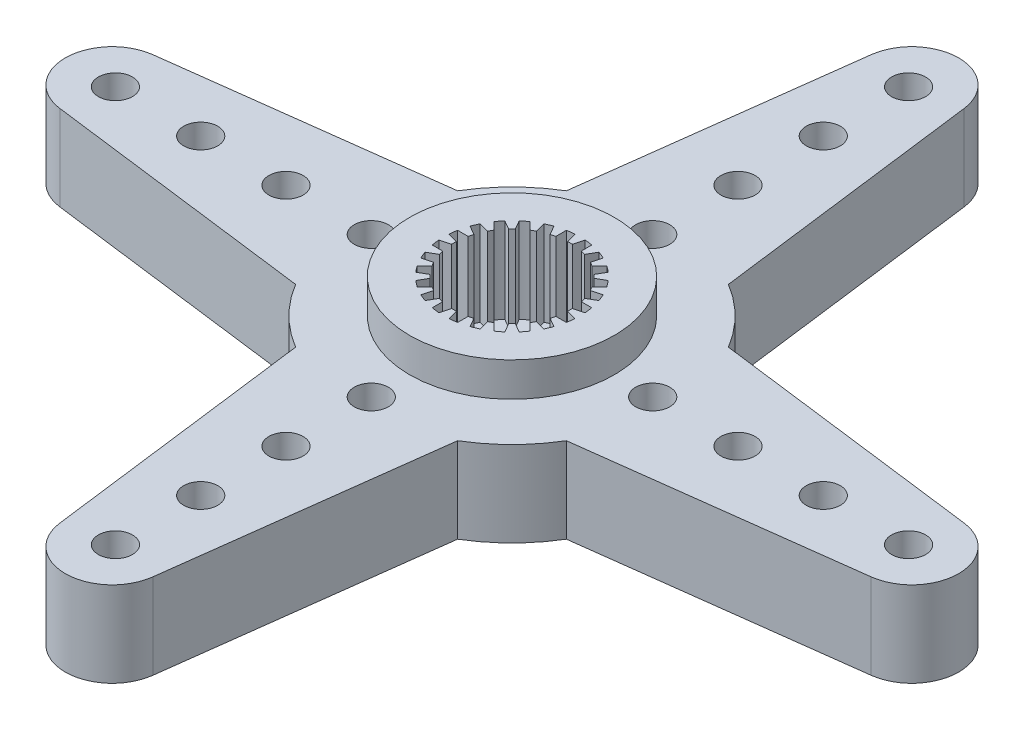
ISO-10303-21;
HEADER;
FILE_DESCRIPTION(('STEP AP214'),'2;1');
FILE_NAME('part.step','',(''),(''),'','','');
FILE_SCHEMA(('AUTOMOTIVE_DESIGN { 1 0 10303 214 1 1 1 1 }'));
ENDSEC;
DATA;
#1=APPLICATION_CONTEXT('core data for automotive mechanical design processes');
#2=APPLICATION_PROTOCOL_DEFINITION('international standard','automotive_design',2000,#1);
#3=PRODUCT_CONTEXT('',#1,'mechanical');
#4=PRODUCT('Part','Part','',(#3));
#5=PRODUCT_RELATED_PRODUCT_CATEGORY('part','',(#4));
#6=PRODUCT_DEFINITION_FORMATION('','',#4);
#7=PRODUCT_DEFINITION_CONTEXT('part definition',#1,'design');
#8=PRODUCT_DEFINITION('design','',#6,#7);
#9=PRODUCT_DEFINITION_SHAPE('','',#8);
#10=(LENGTH_UNIT() NAMED_UNIT(*) SI_UNIT(.MILLI.,.METRE.));
#11=(NAMED_UNIT(*) PLANE_ANGLE_UNIT() SI_UNIT($,.RADIAN.));
#12=(NAMED_UNIT(*) SI_UNIT($,.STERADIAN.) SOLID_ANGLE_UNIT());
#13=UNCERTAINTY_MEASURE_WITH_UNIT(LENGTH_MEASURE(1.E-05),#10,'distance_accuracy_value','');
#14=(GEOMETRIC_REPRESENTATION_CONTEXT(3) GLOBAL_UNCERTAINTY_ASSIGNED_CONTEXT((#13)) GLOBAL_UNIT_ASSIGNED_CONTEXT((#10,
#11,#12)) REPRESENTATION_CONTEXT('',''));
#15=CARTESIAN_POINT('',(0.,0.,0.));
#16=DIRECTION('',(0.,0.,1.));
#17=DIRECTION('',(1.,0.,0.));
#18=AXIS2_PLACEMENT_3D('',#15,#16,#17);
#19=CARTESIAN_POINT('',(0.,8.,0.));
#20=DIRECTION('',(0.,-1.,0.));
#21=DIRECTION('',(0.,0.,-1.));
#22=AXIS2_PLACEMENT_3D('',#19,#20,#21);
#23=CYLINDRICAL_SURFACE('',#22,1.65);
#24=CARTESIAN_POINT('',(0.,3.,0.));
#25=DIRECTION('',(0.,1.,0.));
#26=DIRECTION('',(0.,0.,1.));
#27=AXIS2_PLACEMENT_3D('',#24,#25,#26);
#28=CIRCLE('',#27,1.65);
#29=CARTESIAN_POINT('',(0.,3.,1.65));
#30=VERTEX_POINT('',#29);
#31=EDGE_CURVE('E812',#30,#30,#28,.T.);
#32=ORIENTED_EDGE('',*,*,#31,.T.);
#33=EDGE_LOOP('',(#32));
#34=FACE_BOUND('',#33,.T.);
#35=CARTESIAN_POINT('',(0.,1.,0.));
#36=DIRECTION('',(0.,-1.,0.));
#37=DIRECTION('',(0.,0.,-1.));
#38=AXIS2_PLACEMENT_3D('',#35,#36,#37);
#39=CIRCLE('',#38,1.65);
#40=CARTESIAN_POINT('',(0.,1.,-1.65));
#41=VERTEX_POINT('',#40);
#42=EDGE_CURVE('E917',#41,#41,#39,.T.);
#43=ORIENTED_EDGE('',*,*,#42,.T.);
#44=EDGE_LOOP('',(#43));
#45=FACE_BOUND('',#44,.T.);
#46=ADVANCED_FACE('F39',(#34,#45),#23,.F.);
#47=CARTESIAN_POINT('',(0.,0.,-18.25));
#48=DIRECTION('',(0.,1.,0.));
#49=DIRECTION('',(0.,0.,1.));
#50=AXIS2_PLACEMENT_3D('',#47,#48,#49);
#51=CYLINDRICAL_SURFACE('',#50,1.);
#52=CARTESIAN_POINT('',(0.,6.,-18.25));
#53=DIRECTION('',(0.,1.,0.));
#54=DIRECTION('',(0.,0.,1.));
#55=AXIS2_PLACEMENT_3D('',#52,#53,#54);
#56=CIRCLE('',#55,1.);
#57=CARTESIAN_POINT('',(0.,6.,-17.25));
#58=VERTEX_POINT('',#57);
#59=EDGE_CURVE('E756',#58,#58,#56,.F.);
#60=ORIENTED_EDGE('',*,*,#59,.F.);
#61=EDGE_LOOP('',(#60));
#62=FACE_BOUND('',#61,.T.);
#63=CARTESIAN_POINT('',(0.,1.,-18.25));
#64=DIRECTION('',(0.,-1.,0.));
#65=DIRECTION('',(0.,0.,-1.));
#66=AXIS2_PLACEMENT_3D('',#63,#64,#65);
#67=CIRCLE('',#66,1.);
#68=CARTESIAN_POINT('',(0.,1.,-19.25));
#69=VERTEX_POINT('',#68);
#70=EDGE_CURVE('E1039',#69,#69,#67,.F.);
#71=ORIENTED_EDGE('',*,*,#70,.F.);
#72=EDGE_LOOP('',(#71));
#73=FACE_BOUND('',#72,.T.);
#74=ADVANCED_FACE('F1986',(#62,#73),#51,.F.);
#75=CARTESIAN_POINT('',(0.,8.,0.));
#76=DIRECTION('',(0.,-1.,0.));
#77=DIRECTION('',(0.,0.,-1.));
#78=AXIS2_PLACEMENT_3D('',#75,#76,#77);
#79=CYLINDRICAL_SURFACE('',#78,9.25);
#80=CARTESIAN_POINT('',(0.,1.,0.));
#81=DIRECTION('',(0.,-1.,0.));
#82=DIRECTION('',(0.,0.,-1.));
#83=AXIS2_PLACEMENT_3D('',#80,#81,#82);
#84=CIRCLE('',#83,9.25);
#85=CARTESIAN_POINT('',(4.75,1.,-7.93725393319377));
#86=VERTEX_POINT('',#85);
#87=CARTESIAN_POINT('',(7.93725393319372,1.,-4.75000000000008));
#88=VERTEX_POINT('',#87);
#89=EDGE_CURVE('E747',#86,#88,#84,.T.);
#90=ORIENTED_EDGE('',*,*,#89,.F.);
#91=DIRECTION('',(0.,1.,0.));
#92=VECTOR('',#91,1.);
#93=CARTESIAN_POINT('',(4.75,-20.5745595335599,-7.93725393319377));
#94=LINE('',#93,#92);
#95=CARTESIAN_POINT('',(4.75,6.,-7.93725393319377));
#96=VERTEX_POINT('',#95);
#97=EDGE_CURVE('E785',#86,#96,#94,.T.);
#98=ORIENTED_EDGE('',*,*,#97,.T.);
#99=CARTESIAN_POINT('',(0.,6.,0.));
#100=DIRECTION('',(0.,1.,0.));
#101=DIRECTION('',(0.,0.,1.));
#102=AXIS2_PLACEMENT_3D('',#99,#100,#101);
#103=CIRCLE('',#102,9.25);
#104=CARTESIAN_POINT('',(7.93725393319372,6.,-4.75000000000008));
#105=VERTEX_POINT('',#104);
#106=EDGE_CURVE('E1866',#105,#96,#103,.T.);
#107=ORIENTED_EDGE('',*,*,#106,.F.);
#108=DIRECTION('',(0.,1.,0.));
#109=VECTOR('',#108,1.);
#110=CARTESIAN_POINT('',(7.93725393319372,-20.5745595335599,-4.75000000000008));
#111=LINE('',#110,#109);
#112=EDGE_CURVE('E781',#88,#105,#111,.T.);
#113=ORIENTED_EDGE('',*,*,#112,.F.);
#114=EDGE_LOOP('',(#90,#98,#107,#113));
#115=FACE_BOUND('',#114,.T.);
#116=ADVANCED_FACE('F1930',(#115),#79,.T.);
#117=CARTESIAN_POINT('',(0.,1.,0.));
#118=DIRECTION('',(0.,-1.,0.));
#119=DIRECTION('',(0.,0.,-1.));
#120=AXIS2_PLACEMENT_3D('',#117,#118,#119);
#121=CIRCLE('',#120,9.25);
#122=CARTESIAN_POINT('',(7.93725393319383,1.,4.74999999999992));
#123=VERTEX_POINT('',#122);
#124=CARTESIAN_POINT('',(4.75,1.,7.93725393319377));
#125=VERTEX_POINT('',#124);
#126=EDGE_CURVE('E731',#123,#125,#121,.T.);
#127=ORIENTED_EDGE('',*,*,#126,.F.);
#128=DIRECTION('',(0.,1.,0.));
#129=VECTOR('',#128,1.);
#130=CARTESIAN_POINT('',(7.93725393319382,-20.5745595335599,4.74999999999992));
#131=LINE('',#130,#129);
#132=CARTESIAN_POINT('',(7.93725393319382,6.,4.74999999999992));
#133=VERTEX_POINT('',#132);
#134=EDGE_CURVE('E743',#123,#133,#131,.T.);
#135=ORIENTED_EDGE('',*,*,#134,.T.);
#136=CARTESIAN_POINT('',(0.,6.,0.));
#137=DIRECTION('',(0.,1.,0.));
#138=DIRECTION('',(0.,0.,1.));
#139=AXIS2_PLACEMENT_3D('',#136,#137,#138);
#140=CIRCLE('',#139,9.25);
#141=CARTESIAN_POINT('',(4.75,6.,7.93725393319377));
#142=VERTEX_POINT('',#141);
#143=EDGE_CURVE('E1863',#142,#133,#140,.T.);
#144=ORIENTED_EDGE('',*,*,#143,.F.);
#145=DIRECTION('',(0.,1.,0.));
#146=VECTOR('',#145,1.);
#147=CARTESIAN_POINT('',(4.75,-20.5745595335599,7.93725393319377));
#148=LINE('',#147,#146);
#149=EDGE_CURVE('E745',#125,#142,#148,.T.);
#150=ORIENTED_EDGE('',*,*,#149,.F.);
#151=EDGE_LOOP('',(#127,#135,#144,#150));
#152=FACE_BOUND('',#151,.T.);
#153=ADVANCED_FACE('F741',(#152),#79,.T.);
#154=CARTESIAN_POINT('',(0.,1.,0.));
#155=DIRECTION('',(0.,-1.,0.));
#156=DIRECTION('',(0.,0.,-1.));
#157=AXIS2_PLACEMENT_3D('',#154,#155,#156);
#158=CIRCLE('',#157,9.25);
#159=CARTESIAN_POINT('',(-4.75,1.,7.93725393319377));
#160=VERTEX_POINT('',#159);
#161=CARTESIAN_POINT('',(-7.93725393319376,1.,4.75000000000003));
#162=VERTEX_POINT('',#161);
#163=EDGE_CURVE('E1032',#160,#162,#158,.T.);
#164=ORIENTED_EDGE('',*,*,#163,.F.);
#165=DIRECTION('',(0.,1.,0.));
#166=VECTOR('',#165,1.);
#167=CARTESIAN_POINT('',(-4.75,-20.5745595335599,7.93725393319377));
#168=LINE('',#167,#166);
#169=CARTESIAN_POINT('',(-4.75,6.,7.93725393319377));
#170=VERTEX_POINT('',#169);
#171=EDGE_CURVE('E778',#160,#170,#168,.T.);
#172=ORIENTED_EDGE('',*,*,#171,.T.);
#173=CARTESIAN_POINT('',(0.,6.,0.));
#174=DIRECTION('',(0.,1.,0.));
#175=DIRECTION('',(0.,0.,1.));
#176=AXIS2_PLACEMENT_3D('',#173,#174,#175);
#177=CIRCLE('',#176,9.25);
#178=CARTESIAN_POINT('',(-7.93725393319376,6.,4.75000000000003));
#179=VERTEX_POINT('',#178);
#180=EDGE_CURVE('E1906',#179,#170,#177,.T.);
#181=ORIENTED_EDGE('',*,*,#180,.F.);
#182=DIRECTION('',(0.,1.,0.));
#183=VECTOR('',#182,1.);
#184=CARTESIAN_POINT('',(-7.93725393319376,-20.5745595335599,4.75000000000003));
#185=LINE('',#184,#183);
#186=EDGE_CURVE('E782',#162,#179,#185,.T.);
#187=ORIENTED_EDGE('',*,*,#186,.F.);
#188=EDGE_LOOP('',(#164,#172,#181,#187));
#189=FACE_BOUND('',#188,.T.);
#190=ADVANCED_FACE('F1964',(#189),#79,.T.);
#191=CARTESIAN_POINT('',(0.,1.,0.));
#192=DIRECTION('',(0.,-1.,0.));
#193=DIRECTION('',(0.,0.,-1.));
#194=AXIS2_PLACEMENT_3D('',#191,#192,#193);
#195=CIRCLE('',#194,9.25);
#196=CARTESIAN_POINT('',(-7.93725393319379,1.,-4.74999999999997));
#197=VERTEX_POINT('',#196);
#198=CARTESIAN_POINT('',(-4.75,1.,-7.93725393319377));
#199=VERTEX_POINT('',#198);
#200=EDGE_CURVE('E1013',#197,#199,#195,.T.);
#201=ORIENTED_EDGE('',*,*,#200,.F.);
#202=DIRECTION('',(0.,1.,0.));
#203=VECTOR('',#202,1.);
#204=CARTESIAN_POINT('',(-7.93725393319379,-20.5745595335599,-4.74999999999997));
#205=LINE('',#204,#203);
#206=CARTESIAN_POINT('',(-7.93725393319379,6.,-4.74999999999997));
#207=VERTEX_POINT('',#206);
#208=EDGE_CURVE('E771',#197,#207,#205,.T.);
#209=ORIENTED_EDGE('',*,*,#208,.T.);
#210=CARTESIAN_POINT('',(0.,6.,0.));
#211=DIRECTION('',(0.,1.,0.));
#212=DIRECTION('',(0.,0.,1.));
#213=AXIS2_PLACEMENT_3D('',#210,#211,#212);
#214=CIRCLE('',#213,9.25);
#215=CARTESIAN_POINT('',(-4.75,6.,-7.93725393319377));
#216=VERTEX_POINT('',#215);
#217=EDGE_CURVE('E1886',#216,#207,#214,.T.);
#218=ORIENTED_EDGE('',*,*,#217,.F.);
#219=DIRECTION('',(0.,1.,0.));
#220=VECTOR('',#219,1.);
#221=CARTESIAN_POINT('',(-4.75,-20.5745595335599,-7.93725393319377));
#222=LINE('',#221,#220);
#223=EDGE_CURVE('E794',#199,#216,#222,.T.);
#224=ORIENTED_EDGE('',*,*,#223,.F.);
#225=EDGE_LOOP('',(#201,#209,#218,#224));
#226=FACE_BOUND('',#225,.T.);
#227=ADVANCED_FACE('F1947',(#226),#79,.T.);
#228=CARTESIAN_POINT('',(-4.75,-20.5745595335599,-7.93725393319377));
#229=DIRECTION('',(-0.991957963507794,0.,-0.126567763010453));
#230=DIRECTION('',(-0.126567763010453,0.,0.991957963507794));
#231=AXIS2_PLACEMENT_3D('',#228,#229,#230);
#232=PLANE('',#231);
#233=DIRECTION('',(0.,1.,0.));
#234=VECTOR('',#233,1.);
#235=CARTESIAN_POINT('',(-2.72788439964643,-20.5745595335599,-23.7853152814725));
#236=LINE('',#235,#234);
#237=CARTESIAN_POINT('',(-2.72788439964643,1.,-23.7853152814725));
#238=VERTEX_POINT('',#237);
#239=CARTESIAN_POINT('',(-2.72788439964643,6.,-23.7853152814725));
#240=VERTEX_POINT('',#239);
#241=EDGE_CURVE('E798',#238,#240,#236,.T.);
#242=ORIENTED_EDGE('',*,*,#241,.F.);
#243=DIRECTION('',(-0.126567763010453,0.,0.991957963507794));
#244=VECTOR('',#243,1.);
#245=CARTESIAN_POINT('',(-4.75,1.,-7.93725393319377));
#246=LINE('',#245,#244);
#247=EDGE_CURVE('E1009',#238,#199,#246,.T.);
#248=ORIENTED_EDGE('',*,*,#247,.T.);
#249=ORIENTED_EDGE('',*,*,#223,.T.);
#250=DIRECTION('',(0.126567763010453,0.,-0.991957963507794));
#251=VECTOR('',#250,1.);
#252=CARTESIAN_POINT('',(-4.75,6.,-7.93725393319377));
#253=LINE('',#252,#251);
#254=EDGE_CURVE('E1882',#216,#240,#253,.T.);
#255=ORIENTED_EDGE('',*,*,#254,.T.);
#256=EDGE_LOOP('',(#242,#248,#249,#255));
#257=FACE_BOUND('',#256,.T.);
#258=ADVANCED_FACE('F1943',(#257),#232,.T.);
#259=CARTESIAN_POINT('',(0.,-20.5745595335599,-23.4372539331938));
#260=DIRECTION('',(0.,1.,0.));
#261=DIRECTION('',(0.,0.,1.));
#262=AXIS2_PLACEMENT_3D('',#259,#260,#261);
#263=CYLINDRICAL_SURFACE('',#262,2.75);
#264=DIRECTION('',(0.,1.,0.));
#265=VECTOR('',#264,1.);
#266=CARTESIAN_POINT('',(2.72788439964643,-20.5745595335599,-23.7853152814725));
#267=LINE('',#266,#265);
#268=CARTESIAN_POINT('',(2.72788439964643,1.,-23.7853152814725));
#269=VERTEX_POINT('',#268);
#270=CARTESIAN_POINT('',(2.72788439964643,6.,-23.7853152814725));
#271=VERTEX_POINT('',#270);
#272=EDGE_CURVE('E801',#269,#271,#267,.T.);
#273=ORIENTED_EDGE('',*,*,#272,.F.);
#274=CARTESIAN_POINT('',(0.,1.,-23.4372539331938));
#275=DIRECTION('',(0.,-1.,0.));
#276=DIRECTION('',(0.,0.,-1.));
#277=AXIS2_PLACEMENT_3D('',#274,#275,#276);
#278=CIRCLE('',#277,2.75);
#279=EDGE_CURVE('E1005',#269,#238,#278,.F.);
#280=ORIENTED_EDGE('',*,*,#279,.T.);
#281=ORIENTED_EDGE('',*,*,#241,.T.);
#282=CARTESIAN_POINT('',(0.,6.,-23.4372539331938));
#283=DIRECTION('',(0.,1.,0.));
#284=DIRECTION('',(0.,0.,1.));
#285=AXIS2_PLACEMENT_3D('',#282,#283,#284);
#286=CIRCLE('',#285,2.75);
#287=EDGE_CURVE('E1878',#240,#271,#286,.F.);
#288=ORIENTED_EDGE('',*,*,#287,.T.);
#289=EDGE_LOOP('',(#273,#280,#281,#288));
#290=FACE_BOUND('',#289,.T.);
#291=ADVANCED_FACE('F1938',(#290),#263,.T.);
#292=CARTESIAN_POINT('',(2.72788439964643,-20.5745595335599,-23.7853152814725));
#293=DIRECTION('',(0.991957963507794,0.,-0.126567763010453));
#294=DIRECTION('',(-0.126567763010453,0.,-0.991957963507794));
#295=AXIS2_PLACEMENT_3D('',#292,#293,#294);
#296=PLANE('',#295);
#297=ORIENTED_EDGE('',*,*,#97,.F.);
#298=DIRECTION('',(-0.126567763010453,0.,-0.991957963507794));
#299=VECTOR('',#298,1.);
#300=CARTESIAN_POINT('',(2.72788439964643,1.,-23.7853152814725));
#301=LINE('',#300,#299);
#302=EDGE_CURVE('E1001',#86,#269,#301,.T.);
#303=ORIENTED_EDGE('',*,*,#302,.T.);
#304=ORIENTED_EDGE('',*,*,#272,.T.);
#305=DIRECTION('',(0.126567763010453,0.,0.991957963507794));
#306=VECTOR('',#305,1.);
#307=CARTESIAN_POINT('',(2.72788439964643,6.,-23.7853152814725));
#308=LINE('',#307,#306);
#309=EDGE_CURVE('E1874',#271,#96,#308,.T.);
#310=ORIENTED_EDGE('',*,*,#309,.T.);
#311=EDGE_LOOP('',(#297,#303,#304,#310));
#312=FACE_BOUND('',#311,.T.);
#313=ADVANCED_FACE('F1935',(#312),#296,.T.);
#314=CARTESIAN_POINT('',(-7.93725393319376,-20.5745595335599,4.75000000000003));
#315=DIRECTION('',(-0.12656776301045,0.,0.991957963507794));
#316=DIRECTION('',(0.991957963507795,0.,0.12656776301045));
#317=AXIS2_PLACEMENT_3D('',#314,#315,#316);
#318=PLANE('',#317);
#319=DIRECTION('',(0.,1.,0.));
#320=VECTOR('',#319,1.);
#321=CARTESIAN_POINT('',(-23.7853152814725,-20.5745595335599,2.72788439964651));
#322=LINE('',#321,#320);
#323=CARTESIAN_POINT('',(-23.7853152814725,1.,2.72788439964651));
#324=VERTEX_POINT('',#323);
#325=CARTESIAN_POINT('',(-23.7853152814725,6.,2.72788439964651));
#326=VERTEX_POINT('',#325);
#327=EDGE_CURVE('E786',#324,#326,#322,.T.);
#328=ORIENTED_EDGE('',*,*,#327,.F.);
#329=DIRECTION('',(0.991957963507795,0.,0.12656776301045));
#330=VECTOR('',#329,1.);
#331=CARTESIAN_POINT('',(-7.93725393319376,1.,4.75000000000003));
#332=LINE('',#331,#330);
#333=EDGE_CURVE('E1028',#324,#162,#332,.T.);
#334=ORIENTED_EDGE('',*,*,#333,.T.);
#335=ORIENTED_EDGE('',*,*,#186,.T.);
#336=DIRECTION('',(-0.991957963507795,0.,-0.12656776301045));
#337=VECTOR('',#336,1.);
#338=CARTESIAN_POINT('',(-7.93725393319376,6.,4.75000000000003));
#339=LINE('',#338,#337);
#340=EDGE_CURVE('E1902',#179,#326,#339,.T.);
#341=ORIENTED_EDGE('',*,*,#340,.T.);
#342=EDGE_LOOP('',(#328,#334,#335,#341));
#343=FACE_BOUND('',#342,.T.);
#344=ADVANCED_FACE('F1960',(#343),#318,.T.);
#345=CARTESIAN_POINT('',(-23.4372539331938,-20.5745595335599,0.));
#346=DIRECTION('',(0.,1.,0.));
#347=DIRECTION('',(0.,0.,1.));
#348=AXIS2_PLACEMENT_3D('',#345,#346,#347);
#349=CYLINDRICAL_SURFACE('',#348,2.75);
#350=DIRECTION('',(0.,1.,0.));
#351=VECTOR('',#350,1.);
#352=CARTESIAN_POINT('',(-23.7853152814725,-20.5745595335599,-2.72788439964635));
#353=LINE('',#352,#351);
#354=CARTESIAN_POINT('',(-23.7853152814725,1.,-2.72788439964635));
#355=VERTEX_POINT('',#354);
#356=CARTESIAN_POINT('',(-23.7853152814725,6.,-2.72788439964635));
#357=VERTEX_POINT('',#356);
#358=EDGE_CURVE('E789',#355,#357,#353,.T.);
#359=ORIENTED_EDGE('',*,*,#358,.F.);
#360=CARTESIAN_POINT('',(-23.4372539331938,1.,0.));
#361=DIRECTION('',(0.,-1.,0.));
#362=DIRECTION('',(0.,0.,-1.));
#363=AXIS2_PLACEMENT_3D('',#360,#361,#362);
#364=CIRCLE('',#363,2.75);
#365=EDGE_CURVE('E1024',#355,#324,#364,.F.);
#366=ORIENTED_EDGE('',*,*,#365,.T.);
#367=ORIENTED_EDGE('',*,*,#327,.T.);
#368=CARTESIAN_POINT('',(-23.4372539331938,6.,0.));
#369=DIRECTION('',(0.,1.,0.));
#370=DIRECTION('',(0.,0.,1.));
#371=AXIS2_PLACEMENT_3D('',#368,#369,#370);
#372=CIRCLE('',#371,2.75);
#373=EDGE_CURVE('E1898',#326,#357,#372,.F.);
#374=ORIENTED_EDGE('',*,*,#373,.T.);
#375=EDGE_LOOP('',(#359,#366,#367,#374));
#376=FACE_BOUND('',#375,.T.);
#377=ADVANCED_FACE('F1955',(#376),#349,.T.);
#378=CARTESIAN_POINT('',(-23.7853152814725,-20.5745595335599,-2.72788439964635));
#379=DIRECTION('',(-0.126567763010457,0.,-0.991957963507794));
#380=DIRECTION('',(-0.991957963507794,0.,0.126567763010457));
#381=AXIS2_PLACEMENT_3D('',#378,#379,#380);
#382=PLANE('',#381);
#383=ORIENTED_EDGE('',*,*,#208,.F.);
#384=DIRECTION('',(-0.991957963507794,0.,0.126567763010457));
#385=VECTOR('',#384,1.);
#386=CARTESIAN_POINT('',(-23.7853152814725,1.,-2.72788439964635));
#387=LINE('',#386,#385);
#388=EDGE_CURVE('E1020',#197,#355,#387,.T.);
#389=ORIENTED_EDGE('',*,*,#388,.T.);
#390=ORIENTED_EDGE('',*,*,#358,.T.);
#391=DIRECTION('',(0.991957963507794,0.,-0.126567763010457));
#392=VECTOR('',#391,1.);
#393=CARTESIAN_POINT('',(-23.7853152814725,6.,-2.72788439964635));
#394=LINE('',#393,#392);
#395=EDGE_CURVE('E1894',#357,#207,#394,.T.);
#396=ORIENTED_EDGE('',*,*,#395,.T.);
#397=EDGE_LOOP('',(#383,#389,#390,#396));
#398=FACE_BOUND('',#397,.T.);
#399=ADVANCED_FACE('F1952',(#398),#382,.T.);
#400=CARTESIAN_POINT('',(4.75,-20.5745595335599,7.93725393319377));
#401=DIRECTION('',(0.991957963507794,0.,0.126567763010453));
#402=DIRECTION('',(0.126567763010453,0.,-0.991957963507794));
#403=AXIS2_PLACEMENT_3D('',#400,#401,#402);
#404=PLANE('',#403);
#405=DIRECTION('',(0.,1.,0.));
#406=VECTOR('',#405,1.);
#407=CARTESIAN_POINT('',(2.72788439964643,-20.5745595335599,23.7853152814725));
#408=LINE('',#407,#406);
#409=CARTESIAN_POINT('',(2.72788439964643,1.,23.7853152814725));
#410=VERTEX_POINT('',#409);
#411=CARTESIAN_POINT('',(2.72788439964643,6.,23.7853152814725));
#412=VERTEX_POINT('',#411);
#413=EDGE_CURVE('E772',#410,#412,#408,.T.);
#414=ORIENTED_EDGE('',*,*,#413,.F.);
#415=DIRECTION('',(0.126567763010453,0.,-0.991957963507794));
#416=VECTOR('',#415,1.);
#417=CARTESIAN_POINT('',(4.75,1.,7.93725393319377));
#418=LINE('',#417,#416);
#419=EDGE_CURVE('E999',#410,#125,#418,.T.);
#420=ORIENTED_EDGE('',*,*,#419,.T.);
#421=ORIENTED_EDGE('',*,*,#149,.T.);
#422=DIRECTION('',(-0.126567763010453,0.,0.991957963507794));
#423=VECTOR('',#422,1.);
#424=CARTESIAN_POINT('',(4.75,6.,7.93725393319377));
#425=LINE('',#424,#423);
#426=EDGE_CURVE('E1870',#142,#412,#425,.T.);
#427=ORIENTED_EDGE('',*,*,#426,.T.);
#428=EDGE_LOOP('',(#414,#420,#421,#427));
#429=FACE_BOUND('',#428,.T.);
#430=ADVANCED_FACE('F1975',(#429),#404,.T.);
#431=CARTESIAN_POINT('',(0.,-20.5745595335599,23.4372539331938));
#432=DIRECTION('',(0.,1.,0.));
#433=DIRECTION('',(0.,0.,1.));
#434=AXIS2_PLACEMENT_3D('',#431,#432,#433);
#435=CYLINDRICAL_SURFACE('',#434,2.75);
#436=DIRECTION('',(0.,1.,0.));
#437=VECTOR('',#436,1.);
#438=CARTESIAN_POINT('',(-2.72788439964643,-20.5745595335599,23.7853152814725));
#439=LINE('',#438,#437);
#440=CARTESIAN_POINT('',(-2.72788439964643,1.,23.7853152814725));
#441=VERTEX_POINT('',#440);
#442=CARTESIAN_POINT('',(-2.72788439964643,6.,23.7853152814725));
#443=VERTEX_POINT('',#442);
#444=EDGE_CURVE('E775',#441,#443,#439,.T.);
#445=ORIENTED_EDGE('',*,*,#444,.F.);
#446=CARTESIAN_POINT('',(0.,1.,23.4372539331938));
#447=DIRECTION('',(0.,-1.,0.));
#448=DIRECTION('',(0.,0.,-1.));
#449=AXIS2_PLACEMENT_3D('',#446,#447,#448);
#450=CIRCLE('',#449,2.75);
#451=EDGE_CURVE('E1016',#441,#410,#450,.F.);
#452=ORIENTED_EDGE('',*,*,#451,.T.);
#453=ORIENTED_EDGE('',*,*,#413,.T.);
#454=CARTESIAN_POINT('',(0.,6.,23.4372539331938));
#455=DIRECTION('',(0.,1.,0.));
#456=DIRECTION('',(0.,0.,1.));
#457=AXIS2_PLACEMENT_3D('',#454,#455,#456);
#458=CIRCLE('',#457,2.75);
#459=EDGE_CURVE('E1890',#412,#443,#458,.F.);
#460=ORIENTED_EDGE('',*,*,#459,.T.);
#461=EDGE_LOOP('',(#445,#452,#453,#460));
#462=FACE_BOUND('',#461,.T.);
#463=ADVANCED_FACE('F1971',(#462),#435,.T.);
#464=CARTESIAN_POINT('',(-2.72788439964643,-20.5745595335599,23.7853152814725));
#465=DIRECTION('',(-0.991957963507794,0.,0.126567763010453));
#466=DIRECTION('',(0.126567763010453,0.,0.991957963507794));
#467=AXIS2_PLACEMENT_3D('',#464,#465,#466);
#468=PLANE('',#467);
#469=ORIENTED_EDGE('',*,*,#171,.F.);
#470=DIRECTION('',(0.126567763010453,0.,0.991957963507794));
#471=VECTOR('',#470,1.);
#472=CARTESIAN_POINT('',(-2.72788439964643,1.,23.7853152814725));
#473=LINE('',#472,#471);
#474=EDGE_CURVE('E1035',#160,#441,#473,.T.);
#475=ORIENTED_EDGE('',*,*,#474,.T.);
#476=ORIENTED_EDGE('',*,*,#444,.T.);
#477=DIRECTION('',(-0.126567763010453,0.,-0.991957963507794));
#478=VECTOR('',#477,1.);
#479=CARTESIAN_POINT('',(-2.72788439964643,6.,23.7853152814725));
#480=LINE('',#479,#478);
#481=EDGE_CURVE('E765',#443,#170,#480,.T.);
#482=ORIENTED_EDGE('',*,*,#481,.T.);
#483=EDGE_LOOP('',(#469,#475,#476,#482));
#484=FACE_BOUND('',#483,.T.);
#485=ADVANCED_FACE('F1968',(#484),#468,.T.);
#486=CARTESIAN_POINT('',(7.93725393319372,-20.5745595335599,-4.75000000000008));
#487=DIRECTION('',(0.126567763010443,0.,-0.991957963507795));
#488=DIRECTION('',(-0.991957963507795,0.,-0.126567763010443));
#489=AXIS2_PLACEMENT_3D('',#486,#487,#488);
#490=PLANE('',#489);
#491=DIRECTION('',(0.,1.,0.));
#492=VECTOR('',#491,1.);
#493=CARTESIAN_POINT('',(23.7853152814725,-20.5745595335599,-2.72788439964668));
#494=LINE('',#493,#492);
#495=CARTESIAN_POINT('',(23.7853152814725,1.,-2.72788439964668));
#496=VERTEX_POINT('',#495);
#497=CARTESIAN_POINT('',(23.7853152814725,6.,-2.72788439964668));
#498=VERTEX_POINT('',#497);
#499=EDGE_CURVE('E761',#496,#498,#494,.T.);
#500=ORIENTED_EDGE('',*,*,#499,.F.);
#501=DIRECTION('',(-0.991957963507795,0.,-0.126567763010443));
#502=VECTOR('',#501,1.);
#503=CARTESIAN_POINT('',(7.93725393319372,1.,-4.75000000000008));
#504=LINE('',#503,#502);
#505=EDGE_CURVE('E748',#496,#88,#504,.T.);
#506=ORIENTED_EDGE('',*,*,#505,.T.);
#507=ORIENTED_EDGE('',*,*,#112,.T.);
#508=DIRECTION('',(0.991957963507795,0.,0.126567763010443));
#509=VECTOR('',#508,1.);
#510=CARTESIAN_POINT('',(7.93725393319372,6.,-4.75000000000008));
#511=LINE('',#510,#509);
#512=EDGE_CURVE('E1859',#105,#498,#511,.T.);
#513=ORIENTED_EDGE('',*,*,#512,.T.);
#514=EDGE_LOOP('',(#500,#506,#507,#513));
#515=FACE_BOUND('',#514,.T.);
#516=ADVANCED_FACE('F1926',(#515),#490,.T.);
#517=CARTESIAN_POINT('',(23.4372539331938,-20.5745595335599,-2.45492204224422E-13));
#518=DIRECTION('',(0.,1.,0.));
#519=DIRECTION('',(0.,0.,1.));
#520=AXIS2_PLACEMENT_3D('',#517,#518,#519);
#521=CYLINDRICAL_SURFACE('',#520,2.75);
#522=DIRECTION('',(0.,1.,0.));
#523=VECTOR('',#522,1.);
#524=CARTESIAN_POINT('',(23.7853152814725,-20.5745595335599,2.72788439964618));
#525=LINE('',#524,#523);
#526=CARTESIAN_POINT('',(23.7853152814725,1.,2.72788439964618));
#527=VERTEX_POINT('',#526);
#528=CARTESIAN_POINT('',(23.7853152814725,6.,2.72788439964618));
#529=VERTEX_POINT('',#528);
#530=EDGE_CURVE('E755',#527,#529,#525,.T.);
#531=ORIENTED_EDGE('',*,*,#530,.F.);
#532=CARTESIAN_POINT('',(23.4372539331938,1.,-2.45492204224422E-13));
#533=DIRECTION('',(0.,-1.,0.));
#534=DIRECTION('',(0.,0.,-1.));
#535=AXIS2_PLACEMENT_3D('',#532,#533,#534);
#536=CIRCLE('',#535,2.75);
#537=EDGE_CURVE('E55',#527,#496,#536,.F.);
#538=ORIENTED_EDGE('',*,*,#537,.T.);
#539=ORIENTED_EDGE('',*,*,#499,.T.);
#540=CARTESIAN_POINT('',(23.4372539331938,6.,-2.45492204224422E-13));
#541=DIRECTION('',(0.,1.,0.));
#542=DIRECTION('',(0.,0.,1.));
#543=AXIS2_PLACEMENT_3D('',#540,#541,#542);
#544=CIRCLE('',#543,2.75);
#545=EDGE_CURVE('E1855',#498,#529,#544,.F.);
#546=ORIENTED_EDGE('',*,*,#545,.T.);
#547=EDGE_LOOP('',(#531,#538,#539,#546));
#548=FACE_BOUND('',#547,.T.);
#549=ADVANCED_FACE('F1918',(#548),#521,.T.);
#550=CARTESIAN_POINT('',(23.7853152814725,-20.5745595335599,2.72788439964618));
#551=DIRECTION('',(0.126567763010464,0.,0.991957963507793));
#552=DIRECTION('',(0.991957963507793,0.,-0.126567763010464));
#553=AXIS2_PLACEMENT_3D('',#550,#551,#552);
#554=PLANE('',#553);
#555=ORIENTED_EDGE('',*,*,#134,.F.);
#556=DIRECTION('',(0.991957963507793,0.,-0.126567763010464));
#557=VECTOR('',#556,1.);
#558=CARTESIAN_POINT('',(23.7853152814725,1.,2.72788439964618));
#559=LINE('',#558,#557);
#560=EDGE_CURVE('E727',#123,#527,#559,.T.);
#561=ORIENTED_EDGE('',*,*,#560,.T.);
#562=ORIENTED_EDGE('',*,*,#530,.T.);
#563=DIRECTION('',(-0.991957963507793,0.,0.126567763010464));
#564=VECTOR('',#563,1.);
#565=CARTESIAN_POINT('',(23.7853152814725,6.,2.72788439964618));
#566=LINE('',#565,#564);
#567=EDGE_CURVE('E753',#529,#133,#566,.T.);
#568=ORIENTED_EDGE('',*,*,#567,.T.);
#569=EDGE_LOOP('',(#555,#561,#562,#568));
#570=FACE_BOUND('',#569,.T.);
#571=ADVANCED_FACE('F751',(#570),#554,.T.);
#572=CARTESIAN_POINT('',(0.,0.,-8.25));
#573=DIRECTION('',(0.,1.,0.));
#574=DIRECTION('',(0.,0.,1.));
#575=AXIS2_PLACEMENT_3D('',#572,#573,#574);
#576=CYLINDRICAL_SURFACE('',#575,1.);
#577=CARTESIAN_POINT('',(0.,6.,-8.25));
#578=DIRECTION('',(0.,1.,0.));
#579=DIRECTION('',(0.,0.,1.));
#580=AXIS2_PLACEMENT_3D('',#577,#578,#579);
#581=CIRCLE('',#580,1.);
#582=CARTESIAN_POINT('',(0.,6.,-7.25));
#583=VERTEX_POINT('',#582);
#584=EDGE_CURVE('E1849',#583,#583,#581,.F.);
#585=ORIENTED_EDGE('',*,*,#584,.F.);
#586=EDGE_LOOP('',(#585));
#587=FACE_BOUND('',#586,.T.);
#588=CARTESIAN_POINT('',(0.,1.,-8.25));
#589=DIRECTION('',(0.,-1.,0.));
#590=DIRECTION('',(0.,0.,-1.));
#591=AXIS2_PLACEMENT_3D('',#588,#589,#590);
#592=CIRCLE('',#591,1.);
#593=CARTESIAN_POINT('',(0.,1.,-9.25));
#594=VERTEX_POINT('',#593);
#595=EDGE_CURVE('E737',#594,#594,#592,.F.);
#596=ORIENTED_EDGE('',*,*,#595,.F.);
#597=EDGE_LOOP('',(#596));
#598=FACE_BOUND('',#597,.T.);
#599=ADVANCED_FACE('F2852',(#587,#598),#576,.F.);
#600=CARTESIAN_POINT('',(0.,0.,-13.25));
#601=DIRECTION('',(0.,1.,0.));
#602=DIRECTION('',(0.,0.,1.));
#603=AXIS2_PLACEMENT_3D('',#600,#601,#602);
#604=CYLINDRICAL_SURFACE('',#603,1.);
#605=CARTESIAN_POINT('',(0.,6.,-13.25));
#606=DIRECTION('',(0.,1.,0.));
#607=DIRECTION('',(0.,0.,1.));
#608=AXIS2_PLACEMENT_3D('',#605,#606,#607);
#609=CIRCLE('',#608,1.);
#610=CARTESIAN_POINT('',(0.,6.,-12.25));
#611=VERTEX_POINT('',#610);
#612=EDGE_CURVE('E1845',#611,#611,#609,.F.);
#613=ORIENTED_EDGE('',*,*,#612,.F.);
#614=EDGE_LOOP('',(#613));
#615=FACE_BOUND('',#614,.T.);
#616=CARTESIAN_POINT('',(0.,1.,-13.25));
#617=DIRECTION('',(0.,-1.,0.));
#618=DIRECTION('',(0.,0.,-1.));
#619=AXIS2_PLACEMENT_3D('',#616,#617,#618);
#620=CIRCLE('',#619,1.);
#621=CARTESIAN_POINT('',(0.,1.,-14.25));
#622=VERTEX_POINT('',#621);
#623=EDGE_CURVE('E985',#622,#622,#620,.F.);
#624=ORIENTED_EDGE('',*,*,#623,.F.);
#625=EDGE_LOOP('',(#624));
#626=FACE_BOUND('',#625,.T.);
#627=ADVANCED_FACE('F2845',(#615,#626),#604,.F.);
#628=CARTESIAN_POINT('',(0.,0.,-23.25));
#629=DIRECTION('',(0.,1.,0.));
#630=DIRECTION('',(0.,0.,1.));
#631=AXIS2_PLACEMENT_3D('',#628,#629,#630);
#632=CYLINDRICAL_SURFACE('',#631,1.);
#633=CARTESIAN_POINT('',(0.,6.,-23.25));
#634=DIRECTION('',(0.,1.,0.));
#635=DIRECTION('',(0.,0.,1.));
#636=AXIS2_PLACEMENT_3D('',#633,#634,#635);
#637=CIRCLE('',#636,1.);
#638=CARTESIAN_POINT('',(0.,6.,-22.25));
#639=VERTEX_POINT('',#638);
#640=EDGE_CURVE('E1841',#639,#639,#637,.F.);
#641=ORIENTED_EDGE('',*,*,#640,.F.);
#642=EDGE_LOOP('',(#641));
#643=FACE_BOUND('',#642,.T.);
#644=CARTESIAN_POINT('',(0.,1.,-23.25));
#645=DIRECTION('',(0.,-1.,0.));
#646=DIRECTION('',(0.,0.,-1.));
#647=AXIS2_PLACEMENT_3D('',#644,#645,#646);
#648=CIRCLE('',#647,1.);
#649=CARTESIAN_POINT('',(0.,1.,-24.25));
#650=VERTEX_POINT('',#649);
#651=EDGE_CURVE('E981',#650,#650,#648,.F.);
#652=ORIENTED_EDGE('',*,*,#651,.F.);
#653=EDGE_LOOP('',(#652));
#654=FACE_BOUND('',#653,.T.);
#655=ADVANCED_FACE('F2838',(#643,#654),#632,.F.);
#656=CARTESIAN_POINT('',(-8.25,0.,0.));
#657=DIRECTION('',(0.,1.,0.));
#658=DIRECTION('',(0.,0.,1.));
#659=AXIS2_PLACEMENT_3D('',#656,#657,#658);
#660=CYLINDRICAL_SURFACE('',#659,1.);
#661=CARTESIAN_POINT('',(-8.25,6.,0.));
#662=DIRECTION('',(0.,1.,0.));
#663=DIRECTION('',(0.,0.,1.));
#664=AXIS2_PLACEMENT_3D('',#661,#662,#663);
#665=CIRCLE('',#664,1.);
#666=CARTESIAN_POINT('',(-8.25,6.,0.999999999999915));
#667=VERTEX_POINT('',#666);
#668=EDGE_CURVE('E1837',#667,#667,#665,.F.);
#669=ORIENTED_EDGE('',*,*,#668,.F.);
#670=EDGE_LOOP('',(#669));
#671=FACE_BOUND('',#670,.T.);
#672=CARTESIAN_POINT('',(-8.25,1.,0.));
#673=DIRECTION('',(0.,-1.,0.));
#674=DIRECTION('',(0.,0.,-1.));
#675=AXIS2_PLACEMENT_3D('',#672,#673,#674);
#676=CIRCLE('',#675,1.);
#677=CARTESIAN_POINT('',(-8.25,1.,-1.00000000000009));
#678=VERTEX_POINT('',#677);
#679=EDGE_CURVE('E977',#678,#678,#676,.F.);
#680=ORIENTED_EDGE('',*,*,#679,.F.);
#681=EDGE_LOOP('',(#680));
#682=FACE_BOUND('',#681,.T.);
#683=ADVANCED_FACE('F2831',(#671,#682),#660,.F.);
#684=CARTESIAN_POINT('',(0.,0.,8.25));
#685=DIRECTION('',(0.,1.,0.));
#686=DIRECTION('',(0.,0.,1.));
#687=AXIS2_PLACEMENT_3D('',#684,#685,#686);
#688=CYLINDRICAL_SURFACE('',#687,1.);
#689=CARTESIAN_POINT('',(0.,6.,8.25));
#690=DIRECTION('',(0.,1.,0.));
#691=DIRECTION('',(0.,0.,1.));
#692=AXIS2_PLACEMENT_3D('',#689,#690,#691);
#693=CIRCLE('',#692,1.);
#694=CARTESIAN_POINT('',(0.,6.,9.25));
#695=VERTEX_POINT('',#694);
#696=EDGE_CURVE('E1833',#695,#695,#693,.F.);
#697=ORIENTED_EDGE('',*,*,#696,.F.);
#698=EDGE_LOOP('',(#697));
#699=FACE_BOUND('',#698,.T.);
#700=CARTESIAN_POINT('',(0.,1.,8.25));
#701=DIRECTION('',(0.,-1.,0.));
#702=DIRECTION('',(0.,0.,-1.));
#703=AXIS2_PLACEMENT_3D('',#700,#701,#702);
#704=CIRCLE('',#703,1.);
#705=CARTESIAN_POINT('',(0.,1.,7.25));
#706=VERTEX_POINT('',#705);
#707=EDGE_CURVE('E973',#706,#706,#704,.F.);
#708=ORIENTED_EDGE('',*,*,#707,.F.);
#709=EDGE_LOOP('',(#708));
#710=FACE_BOUND('',#709,.T.);
#711=ADVANCED_FACE('F2824',(#699,#710),#688,.F.);
#712=CARTESIAN_POINT('',(8.25,0.,0.));
#713=DIRECTION('',(0.,1.,0.));
#714=DIRECTION('',(0.,0.,1.));
#715=AXIS2_PLACEMENT_3D('',#712,#713,#714);
#716=CYLINDRICAL_SURFACE('',#715,1.);
#717=CARTESIAN_POINT('',(8.25,6.,0.));
#718=DIRECTION('',(0.,1.,0.));
#719=DIRECTION('',(0.,0.,1.));
#720=AXIS2_PLACEMENT_3D('',#717,#718,#719);
#721=CIRCLE('',#720,1.);
#722=CARTESIAN_POINT('',(8.25,6.,1.00000000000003));
#723=VERTEX_POINT('',#722);
#724=EDGE_CURVE('E1829',#723,#723,#721,.F.);
#725=ORIENTED_EDGE('',*,*,#724,.F.);
#726=EDGE_LOOP('',(#725));
#727=FACE_BOUND('',#726,.T.);
#728=CARTESIAN_POINT('',(8.25,1.,0.));
#729=DIRECTION('',(0.,-1.,0.));
#730=DIRECTION('',(0.,0.,-1.));
#731=AXIS2_PLACEMENT_3D('',#728,#729,#730);
#732=CIRCLE('',#731,1.);
#733=CARTESIAN_POINT('',(8.25,1.,-0.999999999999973));
#734=VERTEX_POINT('',#733);
#735=EDGE_CURVE('E969',#734,#734,#732,.F.);
#736=ORIENTED_EDGE('',*,*,#735,.F.);
#737=EDGE_LOOP('',(#736));
#738=FACE_BOUND('',#737,.T.);
#739=ADVANCED_FACE('F2817',(#727,#738),#716,.F.);
#740=CARTESIAN_POINT('',(23.25,0.,0.));
#741=DIRECTION('',(0.,1.,0.));
#742=DIRECTION('',(0.,0.,1.));
#743=AXIS2_PLACEMENT_3D('',#740,#741,#742);
#744=CYLINDRICAL_SURFACE('',#743,1.);
#745=CARTESIAN_POINT('',(23.25,6.,0.));
#746=DIRECTION('',(0.,1.,0.));
#747=DIRECTION('',(0.,0.,1.));
#748=AXIS2_PLACEMENT_3D('',#745,#746,#747);
#749=CIRCLE('',#748,1.);
#750=CARTESIAN_POINT('',(23.25,6.,1.00000000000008));
#751=VERTEX_POINT('',#750);
#752=EDGE_CURVE('E1825',#751,#751,#749,.F.);
#753=ORIENTED_EDGE('',*,*,#752,.F.);
#754=EDGE_LOOP('',(#753));
#755=FACE_BOUND('',#754,.T.);
#756=CARTESIAN_POINT('',(23.25,1.,0.));
#757=DIRECTION('',(0.,-1.,0.));
#758=DIRECTION('',(0.,0.,-1.));
#759=AXIS2_PLACEMENT_3D('',#756,#757,#758);
#760=CIRCLE('',#759,1.);
#761=CARTESIAN_POINT('',(23.25,1.,-0.99999999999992));
#762=VERTEX_POINT('',#761);
#763=EDGE_CURVE('E965',#762,#762,#760,.F.);
#764=ORIENTED_EDGE('',*,*,#763,.F.);
#765=EDGE_LOOP('',(#764));
#766=FACE_BOUND('',#765,.T.);
#767=ADVANCED_FACE('F2810',(#755,#766),#744,.F.);
#768=CARTESIAN_POINT('',(18.25,0.,0.));
#769=DIRECTION('',(0.,1.,0.));
#770=DIRECTION('',(0.,0.,1.));
#771=AXIS2_PLACEMENT_3D('',#768,#769,#770);
#772=CYLINDRICAL_SURFACE('',#771,1.);
#773=CARTESIAN_POINT('',(18.25,6.,0.));
#774=DIRECTION('',(0.,1.,0.));
#775=DIRECTION('',(0.,0.,1.));
#776=AXIS2_PLACEMENT_3D('',#773,#774,#775);
#777=CIRCLE('',#776,1.);
#778=CARTESIAN_POINT('',(18.25,6.,1.00000000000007));
#779=VERTEX_POINT('',#778);
#780=EDGE_CURVE('E1821',#779,#779,#777,.F.);
#781=ORIENTED_EDGE('',*,*,#780,.F.);
#782=EDGE_LOOP('',(#781));
#783=FACE_BOUND('',#782,.T.);
#784=CARTESIAN_POINT('',(18.25,1.,0.));
#785=DIRECTION('',(0.,-1.,0.));
#786=DIRECTION('',(0.,0.,-1.));
#787=AXIS2_PLACEMENT_3D('',#784,#785,#786);
#788=CIRCLE('',#787,1.);
#789=CARTESIAN_POINT('',(18.25,1.,-0.999999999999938));
#790=VERTEX_POINT('',#789);
#791=EDGE_CURVE('E961',#790,#790,#788,.F.);
#792=ORIENTED_EDGE('',*,*,#791,.F.);
#793=EDGE_LOOP('',(#792));
#794=FACE_BOUND('',#793,.T.);
#795=ADVANCED_FACE('F2803',(#783,#794),#772,.F.);
#796=CARTESIAN_POINT('',(13.25,0.,0.));
#797=DIRECTION('',(0.,1.,0.));
#798=DIRECTION('',(0.,0.,1.));
#799=AXIS2_PLACEMENT_3D('',#796,#797,#798);
#800=CYLINDRICAL_SURFACE('',#799,1.);
#801=CARTESIAN_POINT('',(13.25,6.,0.));
#802=DIRECTION('',(0.,1.,0.));
#803=DIRECTION('',(0.,0.,1.));
#804=AXIS2_PLACEMENT_3D('',#801,#802,#803);
#805=CIRCLE('',#804,1.);
#806=CARTESIAN_POINT('',(13.25,6.,1.00000000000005));
#807=VERTEX_POINT('',#806);
#808=EDGE_CURVE('E1817',#807,#807,#805,.F.);
#809=ORIENTED_EDGE('',*,*,#808,.F.);
#810=EDGE_LOOP('',(#809));
#811=FACE_BOUND('',#810,.T.);
#812=CARTESIAN_POINT('',(13.25,1.,0.));
#813=DIRECTION('',(0.,-1.,0.));
#814=DIRECTION('',(0.,0.,-1.));
#815=AXIS2_PLACEMENT_3D('',#812,#813,#814);
#816=CIRCLE('',#815,1.);
#817=CARTESIAN_POINT('',(13.25,1.,-0.999999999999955));
#818=VERTEX_POINT('',#817);
#819=EDGE_CURVE('E957',#818,#818,#816,.F.);
#820=ORIENTED_EDGE('',*,*,#819,.F.);
#821=EDGE_LOOP('',(#820));
#822=FACE_BOUND('',#821,.T.);
#823=ADVANCED_FACE('F2796',(#811,#822),#800,.F.);
#824=CARTESIAN_POINT('',(0.,0.,23.25));
#825=DIRECTION('',(0.,1.,0.));
#826=DIRECTION('',(0.,0.,1.));
#827=AXIS2_PLACEMENT_3D('',#824,#825,#826);
#828=CYLINDRICAL_SURFACE('',#827,1.);
#829=CARTESIAN_POINT('',(0.,6.,23.25));
#830=DIRECTION('',(0.,1.,0.));
#831=DIRECTION('',(0.,0.,1.));
#832=AXIS2_PLACEMENT_3D('',#829,#830,#831);
#833=CIRCLE('',#832,1.);
#834=CARTESIAN_POINT('',(0.,6.,24.25));
#835=VERTEX_POINT('',#834);
#836=EDGE_CURVE('E1813',#835,#835,#833,.F.);
#837=ORIENTED_EDGE('',*,*,#836,.F.);
#838=EDGE_LOOP('',(#837));
#839=FACE_BOUND('',#838,.T.);
#840=CARTESIAN_POINT('',(0.,1.,23.25));
#841=DIRECTION('',(0.,-1.,0.));
#842=DIRECTION('',(0.,0.,-1.));
#843=AXIS2_PLACEMENT_3D('',#840,#841,#842);
#844=CIRCLE('',#843,1.);
#845=CARTESIAN_POINT('',(0.,1.,22.25));
#846=VERTEX_POINT('',#845);
#847=EDGE_CURVE('E953',#846,#846,#844,.F.);
#848=ORIENTED_EDGE('',*,*,#847,.F.);
#849=EDGE_LOOP('',(#848));
#850=FACE_BOUND('',#849,.T.);
#851=ADVANCED_FACE('F2789',(#839,#850),#828,.F.);
#852=CARTESIAN_POINT('',(0.,0.,18.25));
#853=DIRECTION('',(0.,1.,0.));
#854=DIRECTION('',(0.,0.,1.));
#855=AXIS2_PLACEMENT_3D('',#852,#853,#854);
#856=CYLINDRICAL_SURFACE('',#855,1.);
#857=CARTESIAN_POINT('',(0.,6.,18.25));
#858=DIRECTION('',(0.,1.,0.));
#859=DIRECTION('',(0.,0.,1.));
#860=AXIS2_PLACEMENT_3D('',#857,#858,#859);
#861=CIRCLE('',#860,1.);
#862=CARTESIAN_POINT('',(0.,6.,19.25));
#863=VERTEX_POINT('',#862);
#864=EDGE_CURVE('E1809',#863,#863,#861,.F.);
#865=ORIENTED_EDGE('',*,*,#864,.F.);
#866=EDGE_LOOP('',(#865));
#867=FACE_BOUND('',#866,.T.);
#868=CARTESIAN_POINT('',(0.,1.,18.25));
#869=DIRECTION('',(0.,-1.,0.));
#870=DIRECTION('',(0.,0.,-1.));
#871=AXIS2_PLACEMENT_3D('',#868,#869,#870);
#872=CIRCLE('',#871,1.);
#873=CARTESIAN_POINT('',(0.,1.,17.25));
#874=VERTEX_POINT('',#873);
#875=EDGE_CURVE('E949',#874,#874,#872,.F.);
#876=ORIENTED_EDGE('',*,*,#875,.F.);
#877=EDGE_LOOP('',(#876));
#878=FACE_BOUND('',#877,.T.);
#879=ADVANCED_FACE('F2782',(#867,#878),#856,.F.);
#880=CARTESIAN_POINT('',(0.,0.,13.25));
#881=DIRECTION('',(0.,1.,0.));
#882=DIRECTION('',(0.,0.,1.));
#883=AXIS2_PLACEMENT_3D('',#880,#881,#882);
#884=CYLINDRICAL_SURFACE('',#883,1.);
#885=CARTESIAN_POINT('',(0.,6.,13.25));
#886=DIRECTION('',(0.,1.,0.));
#887=DIRECTION('',(0.,0.,1.));
#888=AXIS2_PLACEMENT_3D('',#885,#886,#887);
#889=CIRCLE('',#888,1.);
#890=CARTESIAN_POINT('',(0.,6.,14.25));
#891=VERTEX_POINT('',#890);
#892=EDGE_CURVE('E1805',#891,#891,#889,.F.);
#893=ORIENTED_EDGE('',*,*,#892,.F.);
#894=EDGE_LOOP('',(#893));
#895=FACE_BOUND('',#894,.T.);
#896=CARTESIAN_POINT('',(0.,1.,13.25));
#897=DIRECTION('',(0.,-1.,0.));
#898=DIRECTION('',(0.,0.,-1.));
#899=AXIS2_PLACEMENT_3D('',#896,#897,#898);
#900=CIRCLE('',#899,1.);
#901=CARTESIAN_POINT('',(0.,1.,12.25));
#902=VERTEX_POINT('',#901);
#903=EDGE_CURVE('E945',#902,#902,#900,.F.);
#904=ORIENTED_EDGE('',*,*,#903,.F.);
#905=EDGE_LOOP('',(#904));
#906=FACE_BOUND('',#905,.T.);
#907=ADVANCED_FACE('F2775',(#895,#906),#884,.F.);
#908=CARTESIAN_POINT('',(-23.25,0.,-2.43530823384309E-13));
#909=DIRECTION('',(0.,1.,0.));
#910=DIRECTION('',(0.,0.,1.));
#911=AXIS2_PLACEMENT_3D('',#908,#909,#910);
#912=CYLINDRICAL_SURFACE('',#911,1.);
#913=CARTESIAN_POINT('',(-23.25,6.,-2.43530823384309E-13));
#914=DIRECTION('',(0.,1.,0.));
#915=DIRECTION('',(0.,0.,1.));
#916=AXIS2_PLACEMENT_3D('',#913,#914,#915);
#917=CIRCLE('',#916,1.);
#918=CARTESIAN_POINT('',(-23.25,6.,0.999999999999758));
#919=VERTEX_POINT('',#918);
#920=EDGE_CURVE('E1801',#919,#919,#917,.F.);
#921=ORIENTED_EDGE('',*,*,#920,.F.);
#922=EDGE_LOOP('',(#921));
#923=FACE_BOUND('',#922,.T.);
#924=CARTESIAN_POINT('',(-23.25,1.,-2.43530823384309E-13));
#925=DIRECTION('',(0.,-1.,0.));
#926=DIRECTION('',(0.,0.,-1.));
#927=AXIS2_PLACEMENT_3D('',#924,#925,#926);
#928=CIRCLE('',#927,1.);
#929=CARTESIAN_POINT('',(-23.25,1.,-1.00000000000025));
#930=VERTEX_POINT('',#929);
#931=EDGE_CURVE('E941',#930,#930,#928,.F.);
#932=ORIENTED_EDGE('',*,*,#931,.F.);
#933=EDGE_LOOP('',(#932));
#934=FACE_BOUND('',#933,.T.);
#935=ADVANCED_FACE('F2769',(#923,#934),#912,.F.);
#936=CARTESIAN_POINT('',(-18.25,0.,-1.91158603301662E-13));
#937=DIRECTION('',(0.,1.,0.));
#938=DIRECTION('',(0.,0.,1.));
#939=AXIS2_PLACEMENT_3D('',#936,#937,#938);
#940=CYLINDRICAL_SURFACE('',#939,1.);
#941=CARTESIAN_POINT('',(-18.25,6.,-1.91158603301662E-13));
#942=DIRECTION('',(0.,1.,0.));
#943=DIRECTION('',(0.,0.,1.));
#944=AXIS2_PLACEMENT_3D('',#941,#942,#943);
#945=CIRCLE('',#944,1.);
#946=CARTESIAN_POINT('',(-18.25,6.,0.99999999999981));
#947=VERTEX_POINT('',#946);
#948=EDGE_CURVE('E810',#947,#947,#945,.F.);
#949=ORIENTED_EDGE('',*,*,#948,.F.);
#950=EDGE_LOOP('',(#949));
#951=FACE_BOUND('',#950,.T.);
#952=CARTESIAN_POINT('',(-18.25,1.,-1.91158603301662E-13));
#953=DIRECTION('',(0.,-1.,0.));
#954=DIRECTION('',(0.,0.,-1.));
#955=AXIS2_PLACEMENT_3D('',#952,#953,#954);
#956=CIRCLE('',#955,1.);
#957=CARTESIAN_POINT('',(-18.25,1.,-1.00000000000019));
#958=VERTEX_POINT('',#957);
#959=EDGE_CURVE('E915',#958,#958,#956,.F.);
#960=ORIENTED_EDGE('',*,*,#959,.F.);
#961=EDGE_LOOP('',(#960));
#962=FACE_BOUND('',#961,.T.);
#963=ADVANCED_FACE('F2763',(#951,#962),#940,.F.);
#964=CARTESIAN_POINT('',(-13.25,0.,-1.38786383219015E-13));
#965=DIRECTION('',(0.,1.,0.));
#966=DIRECTION('',(0.,0.,1.));
#967=AXIS2_PLACEMENT_3D('',#964,#965,#966);
#968=CYLINDRICAL_SURFACE('',#967,1.);
#969=CARTESIAN_POINT('',(-13.25,6.,-1.38786383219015E-13));
#970=DIRECTION('',(0.,1.,0.));
#971=DIRECTION('',(0.,0.,1.));
#972=AXIS2_PLACEMENT_3D('',#969,#970,#971);
#973=CIRCLE('',#972,1.);
#974=CARTESIAN_POINT('',(-13.25,6.,0.999999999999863));
#975=VERTEX_POINT('',#974);
#976=EDGE_CURVE('E806',#975,#975,#973,.F.);
#977=ORIENTED_EDGE('',*,*,#976,.F.);
#978=EDGE_LOOP('',(#977));
#979=FACE_BOUND('',#978,.T.);
#980=CARTESIAN_POINT('',(-13.25,1.,-1.38786383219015E-13));
#981=DIRECTION('',(0.,-1.,0.));
#982=DIRECTION('',(0.,0.,-1.));
#983=AXIS2_PLACEMENT_3D('',#980,#981,#982);
#984=CIRCLE('',#983,1.);
#985=CARTESIAN_POINT('',(-13.25,1.,-1.00000000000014));
#986=VERTEX_POINT('',#985);
#987=EDGE_CURVE('E912',#986,#986,#984,.F.);
#988=ORIENTED_EDGE('',*,*,#987,.F.);
#989=EDGE_LOOP('',(#988));
#990=FACE_BOUND('',#989,.T.);
#991=ADVANCED_FACE('F2005',(#979,#990),#968,.F.);
#992=CARTESIAN_POINT('',(0.,0.,0.));
#993=DIRECTION('',(0.,1.,0.));
#994=DIRECTION('',(0.,0.,1.));
#995=AXIS2_PLACEMENT_3D('',#992,#993,#994);
#996=PLANE('',#995);
#997=CARTESIAN_POINT('',(0.,0.,0.));
#998=DIRECTION('',(0.,-1.,0.));
#999=DIRECTION('',(0.,0.,-1.));
#1000=AXIS2_PLACEMENT_3D('',#997,#998,#999);
#1001=CIRCLE('',#1000,2.75);
#1002=CARTESIAN_POINT('',(0.,0.,-2.75));
#1003=VERTEX_POINT('',#1002);
#1004=EDGE_CURVE('E929',#1003,#1003,#1001,.T.);
#1005=ORIENTED_EDGE('',*,*,#1004,.F.);
#1006=EDGE_LOOP('',(#1005));
#1007=FACE_BOUND('',#1006,.T.);
#1008=CARTESIAN_POINT('',(0.,0.,0.));
#1009=DIRECTION('',(0.,-1.,0.));
#1010=DIRECTION('',(0.,0.,-1.));
#1011=AXIS2_PLACEMENT_3D('',#1008,#1009,#1010);
#1012=CIRCLE('',#1011,4.5);
#1013=CARTESIAN_POINT('',(0.,0.,-4.5));
#1014=VERTEX_POINT('',#1013);
#1015=EDGE_CURVE('E916',#1014,#1014,#1012,.T.);
#1016=ORIENTED_EDGE('',*,*,#1015,.T.);
#1017=EDGE_LOOP('',(#1016));
#1018=FACE_BOUND('',#1017,.T.);
#1019=ADVANCED_FACE('F2001',(#1007,#1018),#996,.F.);
#1020=CARTESIAN_POINT('',(0.,3.,0.));
#1021=DIRECTION('',(0.,1.,0.));
#1022=DIRECTION('',(0.,0.,1.));
#1023=AXIS2_PLACEMENT_3D('',#1020,#1021,#1022);
#1024=CYLINDRICAL_SURFACE('',#1023,4.);
#1025=CARTESIAN_POINT('',(0.,8.,0.));
#1026=DIRECTION('',(0.,1.,0.));
#1027=DIRECTION('',(0.,0.,1.));
#1028=AXIS2_PLACEMENT_3D('',#1025,#1026,#1027);
#1029=CIRCLE('',#1028,4.);
#1030=CARTESIAN_POINT('',(-0.297040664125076,8.,-3.98895560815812));
#1031=VERTEX_POINT('',#1030);
#1032=CARTESIAN_POINT('',(-0.74549843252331,8.,-3.92991502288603));
#1033=VERTEX_POINT('',#1032);
#1034=EDGE_CURVE('E1788',#1031,#1033,#1029,.T.);
#1035=ORIENTED_EDGE('',*,*,#1034,.T.);
#1036=DIRECTION('',(0.,1.,0.));
#1037=VECTOR('',#1036,1.);
#1038=CARTESIAN_POINT('',(-0.74549843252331,3.,-3.92991502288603));
#1039=LINE('',#1038,#1037);
#1040=CARTESIAN_POINT('',(-0.74549843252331,3.,-3.92991502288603));
#1041=VERTEX_POINT('',#1040);
#1042=EDGE_CURVE('E1069',#1033,#1041,#1039,.F.);
#1043=ORIENTED_EDGE('',*,*,#1042,.T.);
#1044=CARTESIAN_POINT('',(0.,3.,0.));
#1045=DIRECTION('',(0.,1.,0.));
#1046=DIRECTION('',(0.,0.,1.));
#1047=AXIS2_PLACEMENT_3D('',#1044,#1045,#1046);
#1048=CIRCLE('',#1047,4.);
#1049=CARTESIAN_POINT('',(-0.297040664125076,3.,-3.98895560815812));
#1050=VERTEX_POINT('',#1049);
#1051=EDGE_CURVE('E817',#1050,#1041,#1048,.T.);
#1052=ORIENTED_EDGE('',*,*,#1051,.F.);
#1053=DIRECTION('',(0.,1.,0.));
#1054=VECTOR('',#1053,1.);
#1055=CARTESIAN_POINT('',(-0.297040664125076,3.,-3.98895560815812));
#1056=LINE('',#1055,#1054);
#1057=EDGE_CURVE('E1775',#1050,#1031,#1056,.T.);
#1058=ORIENTED_EDGE('',*,*,#1057,.T.);
#1059=EDGE_LOOP('',(#1035,#1043,#1052,#1058));
#1060=FACE_BOUND('',#1059,.T.);
#1061=ADVANCED_FACE('F2004',(#1060),#1024,.F.);
#1062=CARTESIAN_POINT('',(-1.31933693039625,3.,-3.7761554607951));
#1063=VERTEX_POINT('',#1062);
#1064=CARTESIAN_POINT('',(-1.7372330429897,3.,-3.6030572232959));
#1065=VERTEX_POINT('',#1064);
#1066=EDGE_CURVE('E1786',#1063,#1065,#1048,.T.);
#1067=ORIENTED_EDGE('',*,*,#1066,.F.);
#1068=DIRECTION('',(0.,1.,0.));
#1069=VECTOR('',#1068,1.);
#1070=CARTESIAN_POINT('',(-1.31933693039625,3.,-3.77615546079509));
#1071=LINE('',#1070,#1069);
#1072=CARTESIAN_POINT('',(-1.31933693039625,8.,-3.7761554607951));
#1073=VERTEX_POINT('',#1072);
#1074=EDGE_CURVE('E63',#1063,#1073,#1071,.T.);
#1075=ORIENTED_EDGE('',*,*,#1074,.T.);
#1076=CARTESIAN_POINT('',(-1.7372330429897,8.,-3.6030572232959));
#1077=VERTEX_POINT('',#1076);
#1078=EDGE_CURVE('E1791',#1073,#1077,#1029,.T.);
#1079=ORIENTED_EDGE('',*,*,#1078,.T.);
#1080=DIRECTION('',(0.,1.,0.));
#1081=VECTOR('',#1080,1.);
#1082=CARTESIAN_POINT('',(-1.7372330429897,3.,-3.6030572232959));
#1083=LINE('',#1082,#1081);
#1084=EDGE_CURVE('E1099',#1077,#1065,#1083,.F.);
#1085=ORIENTED_EDGE('',*,*,#1084,.T.);
#1086=EDGE_LOOP('',(#1067,#1075,#1079,#1085));
#1087=FACE_BOUND('',#1086,.T.);
#1088=ADVANCED_FACE('F2749',(#1087),#1024,.F.);
#1089=CARTESIAN_POINT('',(-2.25172256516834,3.,-3.30601655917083));
#1090=VERTEX_POINT('',#1089);
#1091=CARTESIAN_POINT('',(-2.61057809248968,3.,-3.03065702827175));
#1092=VERTEX_POINT('',#1091);
#1093=EDGE_CURVE('E3732',#1090,#1092,#1048,.T.);
#1094=ORIENTED_EDGE('',*,*,#1093,.F.);
#1095=DIRECTION('',(0.,1.,0.));
#1096=VECTOR('',#1095,1.);
#1097=CARTESIAN_POINT('',(-2.25172256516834,3.,-3.30601655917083));
#1098=LINE('',#1097,#1096);
#1099=CARTESIAN_POINT('',(-2.25172256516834,8.,-3.30601655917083));
#1100=VERTEX_POINT('',#1099);
#1101=EDGE_CURVE('E1096',#1090,#1100,#1098,.T.);
#1102=ORIENTED_EDGE('',*,*,#1101,.T.);
#1103=CARTESIAN_POINT('',(-2.61057809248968,8.,-3.03065702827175));
#1104=VERTEX_POINT('',#1103);
#1105=EDGE_CURVE('E3714',#1100,#1104,#1029,.T.);
#1106=ORIENTED_EDGE('',*,*,#1105,.T.);
#1107=DIRECTION('',(0.,1.,0.));
#1108=VECTOR('',#1107,1.);
#1109=CARTESIAN_POINT('',(-2.61057809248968,3.,-3.03065702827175));
#1110=LINE('',#1109,#1108);
#1111=EDGE_CURVE('E1129',#1104,#1092,#1110,.F.);
#1112=ORIENTED_EDGE('',*,*,#1111,.T.);
#1113=EDGE_LOOP('',(#1094,#1102,#1106,#1112));
#1114=FACE_BOUND('',#1113,.T.);
#1115=ADVANCED_FACE('F2743',(#1114),#1024,.F.);
#1116=CARTESIAN_POINT('',(-3.03065702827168,3.,-2.61057809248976));
#1117=VERTEX_POINT('',#1116);
#1118=CARTESIAN_POINT('',(-3.30601655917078,3.,-2.25172256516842));
#1119=VERTEX_POINT('',#1118);
#1120=EDGE_CURVE('E3735',#1117,#1119,#1048,.T.);
#1121=ORIENTED_EDGE('',*,*,#1120,.F.);
#1122=DIRECTION('',(0.,1.,0.));
#1123=VECTOR('',#1122,1.);
#1124=CARTESIAN_POINT('',(-3.03065702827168,3.,-2.61057809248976));
#1125=LINE('',#1124,#1123);
#1126=CARTESIAN_POINT('',(-3.03065702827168,8.,-2.61057809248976));
#1127=VERTEX_POINT('',#1126);
#1128=EDGE_CURVE('E1126',#1117,#1127,#1125,.T.);
#1129=ORIENTED_EDGE('',*,*,#1128,.T.);
#1130=CARTESIAN_POINT('',(-3.30601655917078,8.,-2.25172256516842));
#1131=VERTEX_POINT('',#1130);
#1132=EDGE_CURVE('E3711',#1127,#1131,#1029,.T.);
#1133=ORIENTED_EDGE('',*,*,#1132,.T.);
#1134=DIRECTION('',(0.,1.,0.));
#1135=VECTOR('',#1134,1.);
#1136=CARTESIAN_POINT('',(-3.30601655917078,3.,-2.25172256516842));
#1137=LINE('',#1136,#1135);
#1138=EDGE_CURVE('E1160',#1131,#1119,#1137,.F.);
#1139=ORIENTED_EDGE('',*,*,#1138,.T.);
#1140=EDGE_LOOP('',(#1121,#1129,#1133,#1139));
#1141=FACE_BOUND('',#1140,.T.);
#1142=ADVANCED_FACE('F2737',(#1141),#1024,.F.);
#1143=CARTESIAN_POINT('',(-3.60305722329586,3.,-1.73723304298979));
#1144=VERTEX_POINT('',#1143);
#1145=CARTESIAN_POINT('',(-3.77615546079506,3.,-1.31933693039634));
#1146=VERTEX_POINT('',#1145);
#1147=EDGE_CURVE('E3737',#1144,#1146,#1048,.T.);
#1148=ORIENTED_EDGE('',*,*,#1147,.F.);
#1149=DIRECTION('',(0.,1.,0.));
#1150=VECTOR('',#1149,1.);
#1151=CARTESIAN_POINT('',(-3.60305722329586,3.,-1.73723304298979));
#1152=LINE('',#1151,#1150);
#1153=CARTESIAN_POINT('',(-3.60305722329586,8.,-1.73723304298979));
#1154=VERTEX_POINT('',#1153);
#1155=EDGE_CURVE('E1157',#1144,#1154,#1152,.T.);
#1156=ORIENTED_EDGE('',*,*,#1155,.T.);
#1157=CARTESIAN_POINT('',(-3.77615546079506,8.,-1.31933693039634));
#1158=VERTEX_POINT('',#1157);
#1159=EDGE_CURVE('E3708',#1154,#1158,#1029,.T.);
#1160=ORIENTED_EDGE('',*,*,#1159,.T.);
#1161=DIRECTION('',(0.,1.,0.));
#1162=VECTOR('',#1161,1.);
#1163=CARTESIAN_POINT('',(-3.77615546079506,3.,-1.31933693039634));
#1164=LINE('',#1163,#1162);
#1165=EDGE_CURVE('E1191',#1158,#1146,#1164,.F.);
#1166=ORIENTED_EDGE('',*,*,#1165,.T.);
#1167=EDGE_LOOP('',(#1148,#1156,#1160,#1166));
#1168=FACE_BOUND('',#1167,.T.);
#1169=ADVANCED_FACE('F2731',(#1168),#1024,.F.);
#1170=CARTESIAN_POINT('',(-3.92991502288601,3.,-0.745498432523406));
#1171=VERTEX_POINT('',#1170);
#1172=CARTESIAN_POINT('',(-3.98895560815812,3.,-0.297040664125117));
#1173=VERTEX_POINT('',#1172);
#1174=EDGE_CURVE('E3739',#1171,#1173,#1048,.T.);
#1175=ORIENTED_EDGE('',*,*,#1174,.F.);
#1176=DIRECTION('',(0.,1.,0.));
#1177=VECTOR('',#1176,1.);
#1178=CARTESIAN_POINT('',(-3.92991502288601,3.,-0.745498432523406));
#1179=LINE('',#1178,#1177);
#1180=CARTESIAN_POINT('',(-3.92991502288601,8.,-0.745498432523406));
#1181=VERTEX_POINT('',#1180);
#1182=EDGE_CURVE('E1188',#1171,#1181,#1179,.T.);
#1183=ORIENTED_EDGE('',*,*,#1182,.T.);
#1184=CARTESIAN_POINT('',(-3.98895560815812,8.,-0.297040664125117));
#1185=VERTEX_POINT('',#1184);
#1186=EDGE_CURVE('E3704',#1181,#1185,#1029,.T.);
#1187=ORIENTED_EDGE('',*,*,#1186,.T.);
#1188=DIRECTION('',(0.,1.,0.));
#1189=VECTOR('',#1188,1.);
#1190=CARTESIAN_POINT('',(-3.98895560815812,3.,-0.297040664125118));
#1191=LINE('',#1190,#1189);
#1192=EDGE_CURVE('E1222',#1185,#1173,#1191,.F.);
#1193=ORIENTED_EDGE('',*,*,#1192,.T.);
#1194=EDGE_LOOP('',(#1175,#1183,#1187,#1193));
#1195=FACE_BOUND('',#1194,.T.);
#1196=ADVANCED_FACE('F2725',(#1195),#1024,.F.);
#1197=CARTESIAN_POINT('',(-3.98895560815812,3.,0.297040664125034));
#1198=VERTEX_POINT('',#1197);
#1199=CARTESIAN_POINT('',(-3.92991502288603,3.,0.745498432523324));
#1200=VERTEX_POINT('',#1199);
#1201=EDGE_CURVE('E3742',#1198,#1200,#1048,.T.);
#1202=ORIENTED_EDGE('',*,*,#1201,.F.);
#1203=DIRECTION('',(0.,1.,0.));
#1204=VECTOR('',#1203,1.);
#1205=CARTESIAN_POINT('',(-3.98895560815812,3.,0.297040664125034));
#1206=LINE('',#1205,#1204);
#1207=CARTESIAN_POINT('',(-3.98895560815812,8.,0.297040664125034));
#1208=VERTEX_POINT('',#1207);
#1209=EDGE_CURVE('E1219',#1198,#1208,#1206,.T.);
#1210=ORIENTED_EDGE('',*,*,#1209,.T.);
#1211=CARTESIAN_POINT('',(-3.92991502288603,8.,0.745498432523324));
#1212=VERTEX_POINT('',#1211);
#1213=EDGE_CURVE('E3700',#1208,#1212,#1029,.T.);
#1214=ORIENTED_EDGE('',*,*,#1213,.T.);
#1215=DIRECTION('',(0.,1.,0.));
#1216=VECTOR('',#1215,1.);
#1217=CARTESIAN_POINT('',(-3.92991502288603,3.,0.745498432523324));
#1218=LINE('',#1217,#1216);
#1219=EDGE_CURVE('E1253',#1212,#1200,#1218,.F.);
#1220=ORIENTED_EDGE('',*,*,#1219,.T.);
#1221=EDGE_LOOP('',(#1202,#1210,#1214,#1220));
#1222=FACE_BOUND('',#1221,.T.);
#1223=ADVANCED_FACE('F2719',(#1222),#1024,.F.);
#1224=CARTESIAN_POINT('',(-3.77615546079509,3.,1.31933693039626));
#1225=VERTEX_POINT('',#1224);
#1226=CARTESIAN_POINT('',(-3.60305722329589,3.,1.73723304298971));
#1227=VERTEX_POINT('',#1226);
#1228=EDGE_CURVE('E3745',#1225,#1227,#1048,.T.);
#1229=ORIENTED_EDGE('',*,*,#1228,.F.);
#1230=DIRECTION('',(0.,1.,0.));
#1231=VECTOR('',#1230,1.);
#1232=CARTESIAN_POINT('',(-3.77615546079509,3.,1.31933693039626));
#1233=LINE('',#1232,#1231);
#1234=CARTESIAN_POINT('',(-3.77615546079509,8.,1.31933693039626));
#1235=VERTEX_POINT('',#1234);
#1236=EDGE_CURVE('E1250',#1225,#1235,#1233,.T.);
#1237=ORIENTED_EDGE('',*,*,#1236,.T.);
#1238=CARTESIAN_POINT('',(-3.60305722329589,8.,1.73723304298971));
#1239=VERTEX_POINT('',#1238);
#1240=EDGE_CURVE('E3696',#1235,#1239,#1029,.T.);
#1241=ORIENTED_EDGE('',*,*,#1240,.T.);
#1242=DIRECTION('',(0.,1.,0.));
#1243=VECTOR('',#1242,1.);
#1244=CARTESIAN_POINT('',(-3.60305722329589,3.,1.73723304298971));
#1245=LINE('',#1244,#1243);
#1246=EDGE_CURVE('E1284',#1239,#1227,#1245,.F.);
#1247=ORIENTED_EDGE('',*,*,#1246,.T.);
#1248=EDGE_LOOP('',(#1229,#1237,#1241,#1247));
#1249=FACE_BOUND('',#1248,.T.);
#1250=ADVANCED_FACE('F2713',(#1249),#1024,.F.);
#1251=CARTESIAN_POINT('',(-3.30601655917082,3.,2.25172256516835));
#1252=VERTEX_POINT('',#1251);
#1253=CARTESIAN_POINT('',(-3.03065702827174,3.,2.61057809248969));
#1254=VERTEX_POINT('',#1253);
#1255=EDGE_CURVE('E3748',#1252,#1254,#1048,.T.);
#1256=ORIENTED_EDGE('',*,*,#1255,.F.);
#1257=DIRECTION('',(0.,1.,0.));
#1258=VECTOR('',#1257,1.);
#1259=CARTESIAN_POINT('',(-3.30601655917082,3.,2.25172256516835));
#1260=LINE('',#1259,#1258);
#1261=CARTESIAN_POINT('',(-3.30601655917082,8.,2.25172256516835));
#1262=VERTEX_POINT('',#1261);
#1263=EDGE_CURVE('E1281',#1252,#1262,#1260,.T.);
#1264=ORIENTED_EDGE('',*,*,#1263,.T.);
#1265=CARTESIAN_POINT('',(-3.03065702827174,8.,2.61057809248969));
#1266=VERTEX_POINT('',#1265);
#1267=EDGE_CURVE('E3692',#1262,#1266,#1029,.T.);
#1268=ORIENTED_EDGE('',*,*,#1267,.T.);
#1269=DIRECTION('',(0.,1.,0.));
#1270=VECTOR('',#1269,1.);
#1271=CARTESIAN_POINT('',(-3.03065702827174,3.,2.61057809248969));
#1272=LINE('',#1271,#1270);
#1273=EDGE_CURVE('E1315',#1266,#1254,#1272,.F.);
#1274=ORIENTED_EDGE('',*,*,#1273,.T.);
#1275=EDGE_LOOP('',(#1256,#1264,#1268,#1274));
#1276=FACE_BOUND('',#1275,.T.);
#1277=ADVANCED_FACE('F2707',(#1276),#1024,.F.);
#1278=CARTESIAN_POINT('',(-2.61057809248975,3.,3.03065702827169));
#1279=VERTEX_POINT('',#1278);
#1280=CARTESIAN_POINT('',(-2.2517225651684,3.,3.30601655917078));
#1281=VERTEX_POINT('',#1280);
#1282=EDGE_CURVE('E3750',#1279,#1281,#1048,.T.);
#1283=ORIENTED_EDGE('',*,*,#1282,.F.);
#1284=DIRECTION('',(0.,1.,0.));
#1285=VECTOR('',#1284,1.);
#1286=CARTESIAN_POINT('',(-2.61057809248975,3.,3.03065702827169));
#1287=LINE('',#1286,#1285);
#1288=CARTESIAN_POINT('',(-2.61057809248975,8.,3.03065702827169));
#1289=VERTEX_POINT('',#1288);
#1290=EDGE_CURVE('E1312',#1279,#1289,#1287,.T.);
#1291=ORIENTED_EDGE('',*,*,#1290,.T.);
#1292=CARTESIAN_POINT('',(-2.2517225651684,8.,3.30601655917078));
#1293=VERTEX_POINT('',#1292);
#1294=EDGE_CURVE('E3688',#1289,#1293,#1029,.T.);
#1295=ORIENTED_EDGE('',*,*,#1294,.T.);
#1296=DIRECTION('',(0.,1.,0.));
#1297=VECTOR('',#1296,1.);
#1298=CARTESIAN_POINT('',(-2.2517225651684,3.,3.30601655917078));
#1299=LINE('',#1298,#1297);
#1300=EDGE_CURVE('E1345',#1293,#1281,#1299,.F.);
#1301=ORIENTED_EDGE('',*,*,#1300,.T.);
#1302=EDGE_LOOP('',(#1283,#1291,#1295,#1301));
#1303=FACE_BOUND('',#1302,.T.);
#1304=ADVANCED_FACE('F2701',(#1303),#1024,.F.);
#1305=CARTESIAN_POINT('',(-1.73723304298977,3.,3.60305722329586));
#1306=VERTEX_POINT('',#1305);
#1307=CARTESIAN_POINT('',(-1.31933693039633,3.,3.77615546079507));
#1308=VERTEX_POINT('',#1307);
#1309=EDGE_CURVE('E3752',#1306,#1308,#1048,.T.);
#1310=ORIENTED_EDGE('',*,*,#1309,.F.);
#1311=DIRECTION('',(0.,1.,0.));
#1312=VECTOR('',#1311,1.);
#1313=CARTESIAN_POINT('',(-1.73723304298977,3.,3.60305722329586));
#1314=LINE('',#1313,#1312);
#1315=CARTESIAN_POINT('',(-1.73723304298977,8.,3.60305722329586));
#1316=VERTEX_POINT('',#1315);
#1317=EDGE_CURVE('E1342',#1306,#1316,#1314,.T.);
#1318=ORIENTED_EDGE('',*,*,#1317,.T.);
#1319=CARTESIAN_POINT('',(-1.31933693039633,8.,3.77615546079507));
#1320=VERTEX_POINT('',#1319);
#1321=EDGE_CURVE('E3683',#1316,#1320,#1029,.T.);
#1322=ORIENTED_EDGE('',*,*,#1321,.T.);
#1323=DIRECTION('',(0.,1.,0.));
#1324=VECTOR('',#1323,1.);
#1325=CARTESIAN_POINT('',(-1.31933693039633,3.,3.77615546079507));
#1326=LINE('',#1325,#1324);
#1327=EDGE_CURVE('E1376',#1320,#1308,#1326,.F.);
#1328=ORIENTED_EDGE('',*,*,#1327,.T.);
#1329=EDGE_LOOP('',(#1310,#1318,#1322,#1328));
#1330=FACE_BOUND('',#1329,.T.);
#1331=ADVANCED_FACE('F2695',(#1330),#1024,.F.);
#1332=CARTESIAN_POINT('',(-0.745498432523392,3.,3.92991502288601));
#1333=VERTEX_POINT('',#1332);
#1334=CARTESIAN_POINT('',(-0.297040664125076,3.,3.98895560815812));
#1335=VERTEX_POINT('',#1334);
#1336=EDGE_CURVE('E3755',#1333,#1335,#1048,.T.);
#1337=ORIENTED_EDGE('',*,*,#1336,.F.);
#1338=DIRECTION('',(0.,1.,0.));
#1339=VECTOR('',#1338,1.);
#1340=CARTESIAN_POINT('',(-0.745498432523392,3.,3.92991502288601));
#1341=LINE('',#1340,#1339);
#1342=CARTESIAN_POINT('',(-0.745498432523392,8.,3.92991502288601));
#1343=VERTEX_POINT('',#1342);
#1344=EDGE_CURVE('E1373',#1333,#1343,#1341,.T.);
#1345=ORIENTED_EDGE('',*,*,#1344,.T.);
#1346=CARTESIAN_POINT('',(-0.297040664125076,8.,3.98895560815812));
#1347=VERTEX_POINT('',#1346);
#1348=EDGE_CURVE('E3679',#1343,#1347,#1029,.T.);
#1349=ORIENTED_EDGE('',*,*,#1348,.T.);
#1350=DIRECTION('',(0.,1.,0.));
#1351=VECTOR('',#1350,1.);
#1352=CARTESIAN_POINT('',(-0.297040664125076,3.,3.98895560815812));
#1353=LINE('',#1352,#1351);
#1354=EDGE_CURVE('E1407',#1347,#1335,#1353,.F.);
#1355=ORIENTED_EDGE('',*,*,#1354,.T.);
#1356=EDGE_LOOP('',(#1337,#1345,#1349,#1355));
#1357=FACE_BOUND('',#1356,.T.);
#1358=ADVANCED_FACE('F2689',(#1357),#1024,.F.);
#1359=CARTESIAN_POINT('',(0.297040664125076,3.,3.98895560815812));
#1360=VERTEX_POINT('',#1359);
#1361=CARTESIAN_POINT('',(0.745498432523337,3.,3.92991502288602));
#1362=VERTEX_POINT('',#1361);
#1363=EDGE_CURVE('E3757',#1360,#1362,#1048,.T.);
#1364=ORIENTED_EDGE('',*,*,#1363,.F.);
#1365=DIRECTION('',(0.,1.,0.));
#1366=VECTOR('',#1365,1.);
#1367=CARTESIAN_POINT('',(0.297040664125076,3.,3.98895560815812));
#1368=LINE('',#1367,#1366);
#1369=CARTESIAN_POINT('',(0.297040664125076,8.,3.98895560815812));
#1370=VERTEX_POINT('',#1369);
#1371=EDGE_CURVE('E1404',#1360,#1370,#1368,.T.);
#1372=ORIENTED_EDGE('',*,*,#1371,.T.);
#1373=CARTESIAN_POINT('',(0.745498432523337,8.,3.92991502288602));
#1374=VERTEX_POINT('',#1373);
#1375=EDGE_CURVE('E3674',#1370,#1374,#1029,.T.);
#1376=ORIENTED_EDGE('',*,*,#1375,.T.);
#1377=DIRECTION('',(0.,1.,0.));
#1378=VECTOR('',#1377,1.);
#1379=CARTESIAN_POINT('',(0.745498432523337,3.,3.92991502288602));
#1380=LINE('',#1379,#1378);
#1381=EDGE_CURVE('E1438',#1374,#1362,#1380,.F.);
#1382=ORIENTED_EDGE('',*,*,#1381,.T.);
#1383=EDGE_LOOP('',(#1364,#1372,#1376,#1382));
#1384=FACE_BOUND('',#1383,.T.);
#1385=ADVANCED_FACE('F2683',(#1384),#1024,.F.);
#1386=CARTESIAN_POINT('',(1.31933693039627,3.,3.77615546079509));
#1387=VERTEX_POINT('',#1386);
#1388=CARTESIAN_POINT('',(1.73723304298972,3.,3.60305722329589));
#1389=VERTEX_POINT('',#1388);
#1390=EDGE_CURVE('E3759',#1387,#1389,#1048,.T.);
#1391=ORIENTED_EDGE('',*,*,#1390,.F.);
#1392=DIRECTION('',(0.,1.,0.));
#1393=VECTOR('',#1392,1.);
#1394=CARTESIAN_POINT('',(1.31933693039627,3.,3.77615546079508));
#1395=LINE('',#1394,#1393);
#1396=CARTESIAN_POINT('',(1.31933693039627,8.,3.77615546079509));
#1397=VERTEX_POINT('',#1396);
#1398=EDGE_CURVE('E1435',#1387,#1397,#1395,.T.);
#1399=ORIENTED_EDGE('',*,*,#1398,.T.);
#1400=CARTESIAN_POINT('',(1.73723304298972,8.,3.60305722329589));
#1401=VERTEX_POINT('',#1400);
#1402=EDGE_CURVE('E3669',#1397,#1401,#1029,.T.);
#1403=ORIENTED_EDGE('',*,*,#1402,.T.);
#1404=DIRECTION('',(0.,1.,0.));
#1405=VECTOR('',#1404,1.);
#1406=CARTESIAN_POINT('',(1.73723304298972,3.,3.60305722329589));
#1407=LINE('',#1406,#1405);
#1408=EDGE_CURVE('E1469',#1401,#1389,#1407,.F.);
#1409=ORIENTED_EDGE('',*,*,#1408,.T.);
#1410=EDGE_LOOP('',(#1391,#1399,#1403,#1409));
#1411=FACE_BOUND('',#1410,.T.);
#1412=ADVANCED_FACE('F2677',(#1411),#1024,.F.);
#1413=CARTESIAN_POINT('',(2.25172256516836,3.,3.30601655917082));
#1414=VERTEX_POINT('',#1413);
#1415=CARTESIAN_POINT('',(2.6105780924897,3.,3.03065702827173));
#1416=VERTEX_POINT('',#1415);
#1417=EDGE_CURVE('E3761',#1414,#1416,#1048,.T.);
#1418=ORIENTED_EDGE('',*,*,#1417,.F.);
#1419=DIRECTION('',(0.,1.,0.));
#1420=VECTOR('',#1419,1.);
#1421=CARTESIAN_POINT('',(2.25172256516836,3.,3.30601655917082));
#1422=LINE('',#1421,#1420);
#1423=CARTESIAN_POINT('',(2.25172256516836,8.,3.30601655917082));
#1424=VERTEX_POINT('',#1423);
#1425=EDGE_CURVE('E1466',#1414,#1424,#1422,.T.);
#1426=ORIENTED_EDGE('',*,*,#1425,.T.);
#1427=CARTESIAN_POINT('',(2.6105780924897,8.,3.03065702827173));
#1428=VERTEX_POINT('',#1427);
#1429=EDGE_CURVE('E3664',#1424,#1428,#1029,.T.);
#1430=ORIENTED_EDGE('',*,*,#1429,.T.);
#1431=DIRECTION('',(0.,1.,0.));
#1432=VECTOR('',#1431,1.);
#1433=CARTESIAN_POINT('',(2.6105780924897,3.,3.03065702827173));
#1434=LINE('',#1433,#1432);
#1435=EDGE_CURVE('E1500',#1428,#1416,#1434,.F.);
#1436=ORIENTED_EDGE('',*,*,#1435,.T.);
#1437=EDGE_LOOP('',(#1418,#1426,#1430,#1436));
#1438=FACE_BOUND('',#1437,.T.);
#1439=ADVANCED_FACE('F2671',(#1438),#1024,.F.);
#1440=CARTESIAN_POINT('',(3.0306570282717,3.,2.61057809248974));
#1441=VERTEX_POINT('',#1440);
#1442=CARTESIAN_POINT('',(3.30601655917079,3.,2.25172256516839));
#1443=VERTEX_POINT('',#1442);
#1444=EDGE_CURVE('E3764',#1441,#1443,#1048,.T.);
#1445=ORIENTED_EDGE('',*,*,#1444,.F.);
#1446=DIRECTION('',(0.,1.,0.));
#1447=VECTOR('',#1446,1.);
#1448=CARTESIAN_POINT('',(3.0306570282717,3.,2.61057809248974));
#1449=LINE('',#1448,#1447);
#1450=CARTESIAN_POINT('',(3.0306570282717,8.,2.61057809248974));
#1451=VERTEX_POINT('',#1450);
#1452=EDGE_CURVE('E1497',#1441,#1451,#1449,.T.);
#1453=ORIENTED_EDGE('',*,*,#1452,.T.);
#1454=CARTESIAN_POINT('',(3.30601655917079,8.,2.25172256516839));
#1455=VERTEX_POINT('',#1454);
#1456=EDGE_CURVE('E3659',#1451,#1455,#1029,.T.);
#1457=ORIENTED_EDGE('',*,*,#1456,.T.);
#1458=DIRECTION('',(0.,1.,0.));
#1459=VECTOR('',#1458,1.);
#1460=CARTESIAN_POINT('',(3.30601655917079,3.,2.25172256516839));
#1461=LINE('',#1460,#1459);
#1462=EDGE_CURVE('E1531',#1455,#1443,#1461,.F.);
#1463=ORIENTED_EDGE('',*,*,#1462,.T.);
#1464=EDGE_LOOP('',(#1445,#1453,#1457,#1463));
#1465=FACE_BOUND('',#1464,.T.);
#1466=ADVANCED_FACE('F2665',(#1465),#1024,.F.);
#1467=CARTESIAN_POINT('',(3.60305722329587,3.,1.73723304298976));
#1468=VERTEX_POINT('',#1467);
#1469=CARTESIAN_POINT('',(3.77615546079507,3.,1.31933693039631));
#1470=VERTEX_POINT('',#1469);
#1471=EDGE_CURVE('E3766',#1468,#1470,#1048,.T.);
#1472=ORIENTED_EDGE('',*,*,#1471,.F.);
#1473=DIRECTION('',(0.,1.,0.));
#1474=VECTOR('',#1473,1.);
#1475=CARTESIAN_POINT('',(3.60305722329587,3.,1.73723304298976));
#1476=LINE('',#1475,#1474);
#1477=CARTESIAN_POINT('',(3.60305722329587,8.,1.73723304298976));
#1478=VERTEX_POINT('',#1477);
#1479=EDGE_CURVE('E1528',#1468,#1478,#1476,.T.);
#1480=ORIENTED_EDGE('',*,*,#1479,.T.);
#1481=CARTESIAN_POINT('',(3.77615546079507,8.,1.31933693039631));
#1482=VERTEX_POINT('',#1481);
#1483=EDGE_CURVE('E3654',#1478,#1482,#1029,.T.);
#1484=ORIENTED_EDGE('',*,*,#1483,.T.);
#1485=DIRECTION('',(0.,1.,0.));
#1486=VECTOR('',#1485,1.);
#1487=CARTESIAN_POINT('',(3.77615546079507,3.,1.31933693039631));
#1488=LINE('',#1487,#1486);
#1489=EDGE_CURVE('E1562',#1482,#1470,#1488,.F.);
#1490=ORIENTED_EDGE('',*,*,#1489,.T.);
#1491=EDGE_LOOP('',(#1472,#1480,#1484,#1490));
#1492=FACE_BOUND('',#1491,.T.);
#1493=ADVANCED_FACE('F2659',(#1492),#1024,.F.);
#1494=CARTESIAN_POINT('',(3.92991502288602,3.,0.745498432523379));
#1495=VERTEX_POINT('',#1494);
#1496=CARTESIAN_POINT('',(3.98895560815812,3.,0.29704066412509));
#1497=VERTEX_POINT('',#1496);
#1498=EDGE_CURVE('E3768',#1495,#1497,#1048,.T.);
#1499=ORIENTED_EDGE('',*,*,#1498,.F.);
#1500=DIRECTION('',(0.,1.,0.));
#1501=VECTOR('',#1500,1.);
#1502=CARTESIAN_POINT('',(3.92991502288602,3.,0.745498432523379));
#1503=LINE('',#1502,#1501);
#1504=CARTESIAN_POINT('',(3.92991502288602,8.,0.745498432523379));
#1505=VERTEX_POINT('',#1504);
#1506=EDGE_CURVE('E1559',#1495,#1505,#1503,.T.);
#1507=ORIENTED_EDGE('',*,*,#1506,.T.);
#1508=CARTESIAN_POINT('',(3.98895560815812,8.,0.29704066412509));
#1509=VERTEX_POINT('',#1508);
#1510=EDGE_CURVE('E3648',#1505,#1509,#1029,.T.);
#1511=ORIENTED_EDGE('',*,*,#1510,.T.);
#1512=DIRECTION('',(0.,1.,0.));
#1513=VECTOR('',#1512,1.);
#1514=CARTESIAN_POINT('',(3.98895560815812,3.,0.29704066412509));
#1515=LINE('',#1514,#1513);
#1516=EDGE_CURVE('E1593',#1509,#1497,#1515,.F.);
#1517=ORIENTED_EDGE('',*,*,#1516,.T.);
#1518=EDGE_LOOP('',(#1499,#1507,#1511,#1517));
#1519=FACE_BOUND('',#1518,.T.);
#1520=ADVANCED_FACE('F2653',(#1519),#1024,.F.);
#1521=CARTESIAN_POINT('',(3.98895560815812,3.,-0.297040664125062));
#1522=VERTEX_POINT('',#1521);
#1523=CARTESIAN_POINT('',(3.92991502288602,3.,-0.745498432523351));
#1524=VERTEX_POINT('',#1523);
#1525=EDGE_CURVE('E3770',#1522,#1524,#1048,.T.);
#1526=ORIENTED_EDGE('',*,*,#1525,.F.);
#1527=DIRECTION('',(0.,1.,0.));
#1528=VECTOR('',#1527,1.);
#1529=CARTESIAN_POINT('',(3.98895560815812,3.,-0.297040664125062));
#1530=LINE('',#1529,#1528);
#1531=CARTESIAN_POINT('',(3.98895560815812,8.,-0.297040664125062));
#1532=VERTEX_POINT('',#1531);
#1533=EDGE_CURVE('E1590',#1522,#1532,#1530,.T.);
#1534=ORIENTED_EDGE('',*,*,#1533,.T.);
#1535=CARTESIAN_POINT('',(3.92991502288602,8.,-0.745498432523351));
#1536=VERTEX_POINT('',#1535);
#1537=EDGE_CURVE('E3644',#1532,#1536,#1029,.T.);
#1538=ORIENTED_EDGE('',*,*,#1537,.T.);
#1539=DIRECTION('',(0.,1.,0.));
#1540=VECTOR('',#1539,1.);
#1541=CARTESIAN_POINT('',(3.92991502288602,3.,-0.745498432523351));
#1542=LINE('',#1541,#1540);
#1543=EDGE_CURVE('E1624',#1536,#1524,#1542,.F.);
#1544=ORIENTED_EDGE('',*,*,#1543,.T.);
#1545=EDGE_LOOP('',(#1526,#1534,#1538,#1544));
#1546=FACE_BOUND('',#1545,.T.);
#1547=ADVANCED_FACE('F2647',(#1546),#1024,.F.);
#1548=CARTESIAN_POINT('',(3.77615546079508,3.,-1.31933693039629));
#1549=VERTEX_POINT('',#1548);
#1550=CARTESIAN_POINT('',(3.60305722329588,3.,-1.73723304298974));
#1551=VERTEX_POINT('',#1550);
#1552=EDGE_CURVE('E3773',#1549,#1551,#1048,.T.);
#1553=ORIENTED_EDGE('',*,*,#1552,.F.);
#1554=DIRECTION('',(0.,1.,0.));
#1555=VECTOR('',#1554,1.);
#1556=CARTESIAN_POINT('',(3.77615546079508,3.,-1.31933693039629));
#1557=LINE('',#1556,#1555);
#1558=CARTESIAN_POINT('',(3.77615546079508,8.,-1.31933693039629));
#1559=VERTEX_POINT('',#1558);
#1560=EDGE_CURVE('E1621',#1549,#1559,#1557,.T.);
#1561=ORIENTED_EDGE('',*,*,#1560,.T.);
#1562=CARTESIAN_POINT('',(3.60305722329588,8.,-1.73723304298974));
#1563=VERTEX_POINT('',#1562);
#1564=EDGE_CURVE('E3639',#1559,#1563,#1029,.T.);
#1565=ORIENTED_EDGE('',*,*,#1564,.T.);
#1566=DIRECTION('',(0.,1.,0.));
#1567=VECTOR('',#1566,1.);
#1568=CARTESIAN_POINT('',(3.60305722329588,3.,-1.73723304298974));
#1569=LINE('',#1568,#1567);
#1570=EDGE_CURVE('E1655',#1563,#1551,#1569,.F.);
#1571=ORIENTED_EDGE('',*,*,#1570,.T.);
#1572=EDGE_LOOP('',(#1553,#1561,#1565,#1571));
#1573=FACE_BOUND('',#1572,.T.);
#1574=ADVANCED_FACE('F2641',(#1573),#1024,.F.);
#1575=CARTESIAN_POINT('',(3.30601655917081,3.,-2.25172256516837));
#1576=VERTEX_POINT('',#1575);
#1577=CARTESIAN_POINT('',(3.03065702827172,3.,-2.61057809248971));
#1578=VERTEX_POINT('',#1577);
#1579=EDGE_CURVE('E3775',#1576,#1578,#1048,.T.);
#1580=ORIENTED_EDGE('',*,*,#1579,.F.);
#1581=DIRECTION('',(0.,1.,0.));
#1582=VECTOR('',#1581,1.);
#1583=CARTESIAN_POINT('',(3.30601655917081,3.,-2.25172256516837));
#1584=LINE('',#1583,#1582);
#1585=CARTESIAN_POINT('',(3.30601655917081,8.,-2.25172256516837));
#1586=VERTEX_POINT('',#1585);
#1587=EDGE_CURVE('E1652',#1576,#1586,#1584,.T.);
#1588=ORIENTED_EDGE('',*,*,#1587,.T.);
#1589=CARTESIAN_POINT('',(3.03065702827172,8.,-2.61057809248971));
#1590=VERTEX_POINT('',#1589);
#1591=EDGE_CURVE('E3635',#1586,#1590,#1029,.T.);
#1592=ORIENTED_EDGE('',*,*,#1591,.T.);
#1593=DIRECTION('',(0.,1.,0.));
#1594=VECTOR('',#1593,1.);
#1595=CARTESIAN_POINT('',(3.03065702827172,3.,-2.61057809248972));
#1596=LINE('',#1595,#1594);
#1597=EDGE_CURVE('E1685',#1590,#1578,#1596,.F.);
#1598=ORIENTED_EDGE('',*,*,#1597,.T.);
#1599=EDGE_LOOP('',(#1580,#1588,#1592,#1598));
#1600=FACE_BOUND('',#1599,.T.);
#1601=ADVANCED_FACE('F2635',(#1600),#1024,.F.);
#1602=CARTESIAN_POINT('',(2.61057809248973,3.,-3.03065702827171));
#1603=VERTEX_POINT('',#1602);
#1604=CARTESIAN_POINT('',(2.25172256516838,3.,-3.3060165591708));
#1605=VERTEX_POINT('',#1604);
#1606=EDGE_CURVE('E3779',#1603,#1605,#1048,.T.);
#1607=ORIENTED_EDGE('',*,*,#1606,.F.);
#1608=DIRECTION('',(0.,1.,0.));
#1609=VECTOR('',#1608,1.);
#1610=CARTESIAN_POINT('',(2.61057809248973,3.,-3.03065702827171));
#1611=LINE('',#1610,#1609);
#1612=CARTESIAN_POINT('',(2.61057809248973,8.,-3.03065702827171));
#1613=VERTEX_POINT('',#1612);
#1614=EDGE_CURVE('E1682',#1603,#1613,#1611,.T.);
#1615=ORIENTED_EDGE('',*,*,#1614,.T.);
#1616=CARTESIAN_POINT('',(2.25172256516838,8.,-3.3060165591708));
#1617=VERTEX_POINT('',#1616);
#1618=EDGE_CURVE('E3630',#1613,#1617,#1029,.T.);
#1619=ORIENTED_EDGE('',*,*,#1618,.T.);
#1620=DIRECTION('',(0.,1.,0.));
#1621=VECTOR('',#1620,1.);
#1622=CARTESIAN_POINT('',(2.25172256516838,3.,-3.3060165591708));
#1623=LINE('',#1622,#1621);
#1624=EDGE_CURVE('E1716',#1617,#1605,#1623,.F.);
#1625=ORIENTED_EDGE('',*,*,#1624,.T.);
#1626=EDGE_LOOP('',(#1607,#1615,#1619,#1625));
#1627=FACE_BOUND('',#1626,.T.);
#1628=ADVANCED_FACE('F2629',(#1627),#1024,.F.);
#1629=CARTESIAN_POINT('',(1.73723304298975,3.,-3.60305722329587));
#1630=VERTEX_POINT('',#1629);
#1631=CARTESIAN_POINT('',(1.3193369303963,3.,-3.77615546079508));
#1632=VERTEX_POINT('',#1631);
#1633=EDGE_CURVE('E3782',#1630,#1632,#1048,.T.);
#1634=ORIENTED_EDGE('',*,*,#1633,.F.);
#1635=DIRECTION('',(0.,1.,0.));
#1636=VECTOR('',#1635,1.);
#1637=CARTESIAN_POINT('',(1.73723304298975,3.,-3.60305722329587));
#1638=LINE('',#1637,#1636);
#1639=CARTESIAN_POINT('',(1.73723304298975,8.,-3.60305722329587));
#1640=VERTEX_POINT('',#1639);
#1641=EDGE_CURVE('E1713',#1630,#1640,#1638,.T.);
#1642=ORIENTED_EDGE('',*,*,#1641,.T.);
#1643=CARTESIAN_POINT('',(1.3193369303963,8.,-3.77615546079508));
#1644=VERTEX_POINT('',#1643);
#1645=EDGE_CURVE('E3628',#1640,#1644,#1029,.T.);
#1646=ORIENTED_EDGE('',*,*,#1645,.T.);
#1647=DIRECTION('',(0.,1.,0.));
#1648=VECTOR('',#1647,1.);
#1649=CARTESIAN_POINT('',(1.3193369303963,3.,-3.77615546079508));
#1650=LINE('',#1649,#1648);
#1651=EDGE_CURVE('E1747',#1644,#1632,#1650,.F.);
#1652=ORIENTED_EDGE('',*,*,#1651,.T.);
#1653=EDGE_LOOP('',(#1634,#1642,#1646,#1652));
#1654=FACE_BOUND('',#1653,.T.);
#1655=ADVANCED_FACE('F1999',(#1654),#1024,.F.);
#1656=CARTESIAN_POINT('',(0.,8.,0.));
#1657=DIRECTION('',(0.,1.,0.));
#1658=DIRECTION('',(0.,0.,1.));
#1659=AXIS2_PLACEMENT_3D('',#1656,#1657,#1658);
#1660=PLANE('',#1659);
#1661=ORIENTED_EDGE('',*,*,#1078,.F.);
#1662=DIRECTION('',(0.499999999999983,0.,0.866025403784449));
#1663=VECTOR('',#1662,1.);
#1664=CARTESIAN_POINT('',(-1.32505392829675,8.,-3.78605759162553));
#1665=LINE('',#1664,#1663);
#1666=CARTESIAN_POINT('',(-1.01447107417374,8.,-3.2481123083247));
#1667=VERTEX_POINT('',#1666);
#1668=EDGE_CURVE('E1043',#1073,#1667,#1665,.T.);
#1669=ORIENTED_EDGE('',*,*,#1668,.T.);
#1670=DIRECTION('',(0.965925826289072,0.,-0.258819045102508));
#1671=VECTOR('',#1670,1.);
#1672=CARTESIAN_POINT('',(-1.01447107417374,8.,-3.2481123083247));
#1673=LINE('',#1672,#1671);
#1674=CARTESIAN_POINT('',(-0.745498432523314,8.,-3.32018331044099));
#1675=VERTEX_POINT('',#1674);
#1676=EDGE_CURVE('E1051',#1667,#1675,#1673,.T.);
#1677=ORIENTED_EDGE('',*,*,#1676,.T.);
#1678=DIRECTION('',(0.,0.,-1.));
#1679=VECTOR('',#1678,1.);
#1680=CARTESIAN_POINT('',(-0.745498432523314,8.,-3.32018331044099));
#1681=LINE('',#1680,#1679);
#1682=EDGE_CURVE('E1055',#1675,#1033,#1681,.T.);
#1683=ORIENTED_EDGE('',*,*,#1682,.T.);
#1684=ORIENTED_EDGE('',*,*,#1034,.F.);
#1685=DIRECTION('',(0.258819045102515,0.,0.96592582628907));
#1686=VECTOR('',#1685,1.);
#1687=CARTESIAN_POINT('',(-0.3,8.,-4.));
#1688=LINE('',#1687,#1686);
#1689=CARTESIAN_POINT('',(-0.139230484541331,8.,-3.4));
#1690=VERTEX_POINT('',#1689);
#1691=EDGE_CURVE('E1751',#1031,#1690,#1688,.T.);
#1692=ORIENTED_EDGE('',*,*,#1691,.T.);
#1693=DIRECTION('',(1.,0.,0.));
#1694=VECTOR('',#1693,1.);
#1695=CARTESIAN_POINT('',(-0.139230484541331,8.,-3.4));
#1696=LINE('',#1695,#1694);
#1697=CARTESIAN_POINT('',(0.139230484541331,8.,-3.4));
#1698=VERTEX_POINT('',#1697);
#1699=EDGE_CURVE('E1759',#1690,#1698,#1696,.T.);
#1700=ORIENTED_EDGE('',*,*,#1699,.T.);
#1701=DIRECTION('',(0.258819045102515,0.,-0.96592582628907));
#1702=VECTOR('',#1701,1.);
#1703=CARTESIAN_POINT('',(0.139230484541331,8.,-3.4));
#1704=LINE('',#1703,#1702);
#1705=CARTESIAN_POINT('',(0.297040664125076,8.,-3.98895560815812));
#1706=VERTEX_POINT('',#1705);
#1707=EDGE_CURVE('E1763',#1698,#1706,#1704,.T.);
#1708=ORIENTED_EDGE('',*,*,#1707,.T.);
#1709=CARTESIAN_POINT('',(0.745498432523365,8.,-3.92991502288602));
#1710=VERTEX_POINT('',#1709);
#1711=EDGE_CURVE('E1782',#1710,#1706,#1029,.T.);
#1712=ORIENTED_EDGE('',*,*,#1711,.F.);
#1713=DIRECTION('',(0.,0.,1.));
#1714=VECTOR('',#1713,1.);
#1715=CARTESIAN_POINT('',(0.745498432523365,8.,-3.94134901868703));
#1716=LINE('',#1715,#1714);
#1717=CARTESIAN_POINT('',(0.745498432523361,8.,-3.32018331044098));
#1718=VERTEX_POINT('',#1717);
#1719=EDGE_CURVE('E1720',#1710,#1718,#1716,.T.);
#1720=ORIENTED_EDGE('',*,*,#1719,.T.);
#1721=DIRECTION('',(0.965925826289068,0.,0.258819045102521));
#1722=VECTOR('',#1721,1.);
#1723=CARTESIAN_POINT('',(0.745498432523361,8.,-3.32018331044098));
#1724=LINE('',#1723,#1722);
#1725=CARTESIAN_POINT('',(1.01447107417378,8.,-3.24811230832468));
#1726=VERTEX_POINT('',#1725);
#1727=EDGE_CURVE('E1728',#1718,#1726,#1724,.T.);
#1728=ORIENTED_EDGE('',*,*,#1727,.T.);
#1729=DIRECTION('',(0.499999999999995,0.,-0.866025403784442));
#1730=VECTOR('',#1729,1.);
#1731=CARTESIAN_POINT('',(1.01447107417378,8.,-3.24811230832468));
#1732=LINE('',#1731,#1730);
#1733=EDGE_CURVE('E1732',#1726,#1644,#1732,.T.);
#1734=ORIENTED_EDGE('',*,*,#1733,.T.);
#1735=ORIENTED_EDGE('',*,*,#1645,.F.);
#1736=DIRECTION('',(-0.258819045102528,0.,0.965925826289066));
#1737=VECTOR('',#1736,1.);
#1738=CARTESIAN_POINT('',(1.74019237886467,8.,-3.61410161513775));
#1739=LINE('',#1738,#1737);
#1740=CARTESIAN_POINT('',(1.579422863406,8.,-3.01410161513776));
#1741=VERTEX_POINT('',#1740);
#1742=EDGE_CURVE('E1689',#1640,#1741,#1739,.T.);
#1743=ORIENTED_EDGE('',*,*,#1742,.T.);
#1744=DIRECTION('',(0.866025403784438,0.,0.500000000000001));
#1745=VECTOR('',#1744,1.);
#1746=CARTESIAN_POINT('',(1.579422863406,8.,-3.01410161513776));
#1747=LINE('',#1746,#1745);
#1748=CARTESIAN_POINT('',(1.82057713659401,8.,-2.87487113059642));
#1749=VERTEX_POINT('',#1748);
#1750=EDGE_CURVE('E1697',#1741,#1749,#1747,.T.);
#1751=ORIENTED_EDGE('',*,*,#1750,.T.);
#1752=DIRECTION('',(0.707106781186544,0.,-0.707106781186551));
#1753=VECTOR('',#1752,1.);
#1754=CARTESIAN_POINT('',(1.82057713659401,8.,-2.87487113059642));
#1755=LINE('',#1754,#1753);
#1756=EDGE_CURVE('E1701',#1749,#1617,#1755,.T.);
#1757=ORIENTED_EDGE('',*,*,#1756,.T.);
#1758=ORIENTED_EDGE('',*,*,#1618,.F.);
#1759=DIRECTION('',(-0.500000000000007,0.,0.866025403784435));
#1760=VECTOR('',#1759,1.);
#1761=CARTESIAN_POINT('',(2.61629509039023,8.,-3.04055915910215));
#1762=LINE('',#1761,#1760);
#1763=CARTESIAN_POINT('',(2.3057122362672,8.,-2.50261387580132));
#1764=VERTEX_POINT('',#1763);
#1765=EDGE_CURVE('E1659',#1613,#1764,#1762,.T.);
#1766=ORIENTED_EDGE('',*,*,#1765,.T.);
#1767=DIRECTION('',(0.707106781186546,0.,0.707106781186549));
#1768=VECTOR('',#1767,1.);
#1769=CARTESIAN_POINT('',(2.3057122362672,8.,-2.50261387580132));
#1770=LINE('',#1769,#1768);
#1771=CARTESIAN_POINT('',(2.50261387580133,8.,-2.30571223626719));
#1772=VERTEX_POINT('',#1771);
#1773=EDGE_CURVE('E1667',#1764,#1772,#1770,.T.);
#1774=ORIENTED_EDGE('',*,*,#1773,.T.);
#1775=DIRECTION('',(0.866025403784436,0.,-0.500000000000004));
#1776=VECTOR('',#1775,1.);
#1777=CARTESIAN_POINT('',(2.50261387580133,8.,-2.30571223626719));
#1778=LINE('',#1777,#1776);
#1779=EDGE_CURVE('E1671',#1772,#1590,#1778,.T.);
#1780=ORIENTED_EDGE('',*,*,#1779,.T.);
#1781=ORIENTED_EDGE('',*,*,#1591,.F.);
#1782=DIRECTION('',(-0.707106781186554,0.,0.707106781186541));
#1783=VECTOR('',#1782,1.);
#1784=CARTESIAN_POINT('',(3.31410161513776,8.,-2.25980762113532));
#1785=LINE('',#1784,#1783);
#1786=CARTESIAN_POINT('',(2.87487113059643,8.,-1.820577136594));
#1787=VERTEX_POINT('',#1786);
#1788=EDGE_CURVE('E1628',#1586,#1787,#1785,.T.);
#1789=ORIENTED_EDGE('',*,*,#1788,.T.);
#1790=DIRECTION('',(0.499999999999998,0.,0.86602540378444));
#1791=VECTOR('',#1790,1.);
#1792=CARTESIAN_POINT('',(2.87487113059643,8.,-1.820577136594));
#1793=LINE('',#1792,#1791);
#1794=CARTESIAN_POINT('',(3.01410161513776,8.,-1.57942286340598));
#1795=VERTEX_POINT('',#1794);
#1796=EDGE_CURVE('E1636',#1787,#1795,#1793,.T.);
#1797=ORIENTED_EDGE('',*,*,#1796,.T.);
#1798=DIRECTION('',(0.965925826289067,0.,-0.258819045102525));
#1799=VECTOR('',#1798,1.);
#1800=CARTESIAN_POINT('',(3.01410161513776,8.,-1.57942286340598));
#1801=LINE('',#1800,#1799);
#1802=EDGE_CURVE('E1640',#1795,#1563,#1801,.T.);
#1803=ORIENTED_EDGE('',*,*,#1802,.T.);
#1804=ORIENTED_EDGE('',*,*,#1564,.F.);
#1805=DIRECTION('',(-0.866025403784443,0.,0.499999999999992));
#1806=VECTOR('',#1805,1.);
#1807=CARTESIAN_POINT('',(3.78605759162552,8.,-1.32505392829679));
#1808=LINE('',#1807,#1806);
#1809=CARTESIAN_POINT('',(3.24811230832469,8.,-1.01447107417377));
#1810=VERTEX_POINT('',#1809);
#1811=EDGE_CURVE('E1597',#1559,#1810,#1808,.T.);
#1812=ORIENTED_EDGE('',*,*,#1811,.T.);
#1813=DIRECTION('',(0.258819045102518,0.,0.965925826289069));
#1814=VECTOR('',#1813,1.);
#1815=CARTESIAN_POINT('',(3.24811230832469,8.,-1.01447107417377));
#1816=LINE('',#1815,#1814);
#1817=CARTESIAN_POINT('',(3.32018331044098,8.,-0.745498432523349));
#1818=VERTEX_POINT('',#1817);
#1819=EDGE_CURVE('E1605',#1810,#1818,#1816,.T.);
#1820=ORIENTED_EDGE('',*,*,#1819,.T.);
#1821=DIRECTION('',(1.,0.,0.));
#1822=VECTOR('',#1821,1.);
#1823=CARTESIAN_POINT('',(3.32018331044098,8.,-0.745498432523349));
#1824=LINE('',#1823,#1822);
#1825=EDGE_CURVE('E1609',#1818,#1536,#1824,.T.);
#1826=ORIENTED_EDGE('',*,*,#1825,.T.);
#1827=ORIENTED_EDGE('',*,*,#1537,.F.);
#1828=DIRECTION('',(-0.965925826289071,0.,0.258819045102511));
#1829=VECTOR('',#1828,1.);
#1830=CARTESIAN_POINT('',(4.,8.,-0.299999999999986));
#1831=LINE('',#1830,#1829);
#1832=CARTESIAN_POINT('',(3.4,8.,-0.139230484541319));
#1833=VERTEX_POINT('',#1832);
#1834=EDGE_CURVE('E1566',#1532,#1833,#1831,.T.);
#1835=ORIENTED_EDGE('',*,*,#1834,.T.);
#1836=DIRECTION('',(0.,0.,1.));
#1837=VECTOR('',#1836,1.);
#1838=CARTESIAN_POINT('',(3.4,8.,-0.139230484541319));
#1839=LINE('',#1838,#1837);
#1840=CARTESIAN_POINT('',(3.4,8.,0.139230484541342));
#1841=VERTEX_POINT('',#1840);
#1842=EDGE_CURVE('E1574',#1833,#1841,#1839,.T.);
#1843=ORIENTED_EDGE('',*,*,#1842,.T.);
#1844=DIRECTION('',(0.965925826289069,0.,0.258819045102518));
#1845=VECTOR('',#1844,1.);
#1846=CARTESIAN_POINT('',(3.4,8.,0.139230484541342));
#1847=LINE('',#1846,#1845);
#1848=EDGE_CURVE('E1578',#1841,#1509,#1847,.T.);
#1849=ORIENTED_EDGE('',*,*,#1848,.T.);
#1850=ORIENTED_EDGE('',*,*,#1510,.F.);
#1851=DIRECTION('',(-1.,0.,0.));
#1852=VECTOR('',#1851,1.);
#1853=CARTESIAN_POINT('',(3.94134901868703,8.,0.745498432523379));
#1854=LINE('',#1853,#1852);
#1855=CARTESIAN_POINT('',(3.32018331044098,8.,0.745498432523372));
#1856=VERTEX_POINT('',#1855);
#1857=EDGE_CURVE('E1535',#1505,#1856,#1854,.T.);
#1858=ORIENTED_EDGE('',*,*,#1857,.T.);
#1859=DIRECTION('',(-0.258819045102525,0.,0.965925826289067));
#1860=VECTOR('',#1859,1.);
#1861=CARTESIAN_POINT('',(3.32018331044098,8.,0.745498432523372));
#1862=LINE('',#1861,#1860);
#1863=CARTESIAN_POINT('',(3.24811230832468,8.,1.0144710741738));
#1864=VERTEX_POINT('',#1863);
#1865=EDGE_CURVE('E1543',#1856,#1864,#1862,.T.);
#1866=ORIENTED_EDGE('',*,*,#1865,.T.);
#1867=DIRECTION('',(0.86602540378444,0.,0.499999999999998));
#1868=VECTOR('',#1867,1.);
#1869=CARTESIAN_POINT('',(3.24811230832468,8.,1.0144710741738));
#1870=LINE('',#1869,#1868);
#1871=EDGE_CURVE('E1547',#1864,#1482,#1870,.T.);
#1872=ORIENTED_EDGE('',*,*,#1871,.T.);
#1873=ORIENTED_EDGE('',*,*,#1483,.F.);
#1874=DIRECTION('',(-0.965925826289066,0.,-0.258819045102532));
#1875=VECTOR('',#1874,1.);
#1876=CARTESIAN_POINT('',(3.61410161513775,8.,1.74019237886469));
#1877=LINE('',#1876,#1875);
#1878=CARTESIAN_POINT('',(3.01410161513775,8.,1.57942286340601));
#1879=VERTEX_POINT('',#1878);
#1880=EDGE_CURVE('E1504',#1478,#1879,#1877,.T.);
#1881=ORIENTED_EDGE('',*,*,#1880,.T.);
#1882=DIRECTION('',(-0.500000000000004,0.,0.866025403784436));
#1883=VECTOR('',#1882,1.);
#1884=CARTESIAN_POINT('',(3.01410161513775,8.,1.57942286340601));
#1885=LINE('',#1884,#1883);
#1886=CARTESIAN_POINT('',(2.87487113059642,8.,1.82057713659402));
#1887=VERTEX_POINT('',#1886);
#1888=EDGE_CURVE('E1512',#1879,#1887,#1885,.T.);
#1889=ORIENTED_EDGE('',*,*,#1888,.T.);
#1890=DIRECTION('',(0.707106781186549,0.,0.707106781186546));
#1891=VECTOR('',#1890,1.);
#1892=CARTESIAN_POINT('',(2.87487113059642,8.,1.82057713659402));
#1893=LINE('',#1892,#1891);
#1894=EDGE_CURVE('E1516',#1887,#1455,#1893,.T.);
#1895=ORIENTED_EDGE('',*,*,#1894,.T.);
#1896=ORIENTED_EDGE('',*,*,#1456,.F.);
#1897=DIRECTION('',(-0.866025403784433,0.,-0.50000000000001));
#1898=VECTOR('',#1897,1.);
#1899=CARTESIAN_POINT('',(3.04055915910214,8.,2.61629509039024));
#1900=LINE('',#1899,#1898);
#1901=CARTESIAN_POINT('',(2.50261387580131,8.,2.30571223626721));
#1902=VERTEX_POINT('',#1901);
#1903=EDGE_CURVE('E1473',#1451,#1902,#1900,.T.);
#1904=ORIENTED_EDGE('',*,*,#1903,.T.);
#1905=DIRECTION('',(-0.707106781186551,0.,0.707106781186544));
#1906=VECTOR('',#1905,1.);
#1907=CARTESIAN_POINT('',(2.50261387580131,8.,2.30571223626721));
#1908=LINE('',#1907,#1906);
#1909=CARTESIAN_POINT('',(2.30571223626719,8.,2.50261387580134));
#1910=VERTEX_POINT('',#1909);
#1911=EDGE_CURVE('E1481',#1902,#1910,#1908,.T.);
#1912=ORIENTED_EDGE('',*,*,#1911,.T.);
#1913=DIRECTION('',(0.500000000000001,0.,0.866025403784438));
#1914=VECTOR('',#1913,1.);
#1915=CARTESIAN_POINT('',(2.30571223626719,8.,2.50261387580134));
#1916=LINE('',#1915,#1914);
#1917=EDGE_CURVE('E1485',#1910,#1428,#1916,.T.);
#1918=ORIENTED_EDGE('',*,*,#1917,.T.);
#1919=ORIENTED_EDGE('',*,*,#1429,.F.);
#1920=DIRECTION('',(-0.707106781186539,0.,-0.707106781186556));
#1921=VECTOR('',#1920,1.);
#1922=CARTESIAN_POINT('',(2.25980762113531,8.,3.31410161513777));
#1923=LINE('',#1922,#1921);
#1924=CARTESIAN_POINT('',(1.82057713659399,8.,2.87487113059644));
#1925=VERTEX_POINT('',#1924);
#1926=EDGE_CURVE('E1442',#1424,#1925,#1923,.T.);
#1927=ORIENTED_EDGE('',*,*,#1926,.T.);
#1928=DIRECTION('',(-0.866025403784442,0.,0.499999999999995));
#1929=VECTOR('',#1928,1.);
#1930=CARTESIAN_POINT('',(1.82057713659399,8.,2.87487113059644));
#1931=LINE('',#1930,#1929);
#1932=CARTESIAN_POINT('',(1.57942286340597,8.,3.01410161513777));
#1933=VERTEX_POINT('',#1932);
#1934=EDGE_CURVE('E1450',#1925,#1933,#1931,.T.);
#1935=ORIENTED_EDGE('',*,*,#1934,.T.);
#1936=DIRECTION('',(0.258819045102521,0.,0.965925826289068));
#1937=VECTOR('',#1936,1.);
#1938=CARTESIAN_POINT('',(1.57942286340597,8.,3.01410161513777));
#1939=LINE('',#1938,#1937);
#1940=EDGE_CURVE('E1454',#1933,#1401,#1939,.T.);
#1941=ORIENTED_EDGE('',*,*,#1940,.T.);
#1942=ORIENTED_EDGE('',*,*,#1402,.F.);
#1943=DIRECTION('',(-0.499999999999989,0.,-0.866025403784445));
#1944=VECTOR('',#1943,1.);
#1945=CARTESIAN_POINT('',(1.32505392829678,8.,3.78605759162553));
#1946=LINE('',#1945,#1944);
#1947=CARTESIAN_POINT('',(1.01447107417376,8.,3.24811230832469));
#1948=VERTEX_POINT('',#1947);
#1949=EDGE_CURVE('E1411',#1397,#1948,#1946,.T.);
#1950=ORIENTED_EDGE('',*,*,#1949,.T.);
#1951=DIRECTION('',(-0.96592582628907,0.,0.258819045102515));
#1952=VECTOR('',#1951,1.);
#1953=CARTESIAN_POINT('',(1.01447107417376,8.,3.24811230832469));
#1954=LINE('',#1953,#1952);
#1955=CARTESIAN_POINT('',(0.745498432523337,8.,3.32018331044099));
#1956=VERTEX_POINT('',#1955);
#1957=EDGE_CURVE('E1419',#1948,#1956,#1954,.T.);
#1958=ORIENTED_EDGE('',*,*,#1957,.T.);
#1959=DIRECTION('',(0.,0.,1.));
#1960=VECTOR('',#1959,1.);
#1961=CARTESIAN_POINT('',(0.745498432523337,8.,3.32018331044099));
#1962=LINE('',#1961,#1960);
#1963=EDGE_CURVE('E1423',#1956,#1374,#1962,.T.);
#1964=ORIENTED_EDGE('',*,*,#1963,.T.);
#1965=ORIENTED_EDGE('',*,*,#1375,.F.);
#1966=DIRECTION('',(-0.258819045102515,0.,-0.96592582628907));
#1967=VECTOR('',#1966,1.);
#1968=CARTESIAN_POINT('',(0.3,8.,4.));
#1969=LINE('',#1968,#1967);
#1970=CARTESIAN_POINT('',(0.139230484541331,8.,3.4));
#1971=VERTEX_POINT('',#1970);
#1972=EDGE_CURVE('E1380',#1370,#1971,#1969,.T.);
#1973=ORIENTED_EDGE('',*,*,#1972,.T.);
#1974=DIRECTION('',(-1.,0.,0.));
#1975=VECTOR('',#1974,1.);
#1976=CARTESIAN_POINT('',(0.139230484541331,8.,3.4));
#1977=LINE('',#1976,#1975);
#1978=CARTESIAN_POINT('',(-0.139230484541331,8.,3.4));
#1979=VERTEX_POINT('',#1978);
#1980=EDGE_CURVE('E1388',#1971,#1979,#1977,.T.);
#1981=ORIENTED_EDGE('',*,*,#1980,.T.);
#1982=DIRECTION('',(-0.258819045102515,0.,0.96592582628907));
#1983=VECTOR('',#1982,1.);
#1984=CARTESIAN_POINT('',(-0.139230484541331,8.,3.4));
#1985=LINE('',#1984,#1983);
#1986=EDGE_CURVE('E1392',#1979,#1347,#1985,.T.);
#1987=ORIENTED_EDGE('',*,*,#1986,.T.);
#1988=ORIENTED_EDGE('',*,*,#1348,.F.);
#1989=DIRECTION('',(0.,0.,-1.));
#1990=VECTOR('',#1989,1.);
#1991=CARTESIAN_POINT('',(-0.745498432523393,8.,3.94134901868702));
#1992=LINE('',#1991,#1990);
#1993=CARTESIAN_POINT('',(-0.745498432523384,8.,3.32018331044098));
#1994=VERTEX_POINT('',#1993);
#1995=EDGE_CURVE('E1349',#1343,#1994,#1992,.T.);
#1996=ORIENTED_EDGE('',*,*,#1995,.T.);
#1997=DIRECTION('',(-0.965925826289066,0.,-0.258819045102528));
#1998=VECTOR('',#1997,1.);
#1999=CARTESIAN_POINT('',(-0.745498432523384,8.,3.32018331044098));
#2000=LINE('',#1999,#1998);
#2001=CARTESIAN_POINT('',(-1.01447107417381,8.,3.24811230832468));
#2002=VERTEX_POINT('',#2001);
#2003=EDGE_CURVE('E1357',#1994,#2002,#2000,.T.);
#2004=ORIENTED_EDGE('',*,*,#2003,.T.);
#2005=DIRECTION('',(-0.500000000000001,0.,0.866025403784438));
#2006=VECTOR('',#2005,1.);
#2007=CARTESIAN_POINT('',(-1.01447107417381,8.,3.24811230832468));
#2008=LINE('',#2007,#2006);
#2009=EDGE_CURVE('E1361',#2002,#1320,#2008,.T.);
#2010=ORIENTED_EDGE('',*,*,#2009,.T.);
#2011=ORIENTED_EDGE('',*,*,#1321,.F.);
#2012=DIRECTION('',(0.258819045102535,0.,-0.965925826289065));
#2013=VECTOR('',#2012,1.);
#2014=CARTESIAN_POINT('',(-1.7401923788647,8.,3.61410161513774));
#2015=LINE('',#2014,#2013);
#2016=CARTESIAN_POINT('',(-1.57942286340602,8.,3.01410161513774));
#2017=VERTEX_POINT('',#2016);
#2018=EDGE_CURVE('E1319',#1316,#2017,#2015,.T.);
#2019=ORIENTED_EDGE('',*,*,#2018,.T.);
#2020=DIRECTION('',(-0.866025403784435,0.,-0.500000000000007));
#2021=VECTOR('',#2020,1.);
#2022=CARTESIAN_POINT('',(-1.57942286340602,8.,3.01410161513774));
#2023=LINE('',#2022,#2021);
#2024=CARTESIAN_POINT('',(-1.82057713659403,8.,2.87487113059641));
#2025=VERTEX_POINT('',#2024);
#2026=EDGE_CURVE('E1327',#2017,#2025,#2023,.T.);
#2027=ORIENTED_EDGE('',*,*,#2026,.T.);
#2028=DIRECTION('',(-0.707106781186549,0.,0.707106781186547));
#2029=VECTOR('',#2028,1.);
#2030=CARTESIAN_POINT('',(-1.82057713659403,8.,2.87487113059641));
#2031=LINE('',#2030,#2029);
#2032=EDGE_CURVE('E1331',#2025,#1293,#2031,.T.);
#2033=ORIENTED_EDGE('',*,*,#2032,.T.);
#2034=ORIENTED_EDGE('',*,*,#1294,.F.);
#2035=DIRECTION('',(0.500000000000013,0.,-0.866025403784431));
#2036=VECTOR('',#2035,1.);
#2037=CARTESIAN_POINT('',(-2.61629509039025,8.,3.04055915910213));
#2038=LINE('',#2037,#2036);
#2039=CARTESIAN_POINT('',(-2.30571223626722,8.,2.50261387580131));
#2040=VERTEX_POINT('',#2039);
#2041=EDGE_CURVE('E1288',#1289,#2040,#2038,.T.);
#2042=ORIENTED_EDGE('',*,*,#2041,.T.);
#2043=DIRECTION('',(-0.707106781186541,0.,-0.707106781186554));
#2044=VECTOR('',#2043,1.);
#2045=CARTESIAN_POINT('',(-2.30571223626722,8.,2.50261387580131));
#2046=LINE('',#2045,#2044);
#2047=CARTESIAN_POINT('',(-2.50261387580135,8.,2.30571223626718));
#2048=VERTEX_POINT('',#2047);
#2049=EDGE_CURVE('E1296',#2040,#2048,#2046,.T.);
#2050=ORIENTED_EDGE('',*,*,#2049,.T.);
#2051=DIRECTION('',(-0.86602540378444,0.,0.499999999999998));
#2052=VECTOR('',#2051,1.);
#2053=CARTESIAN_POINT('',(-2.50261387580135,8.,2.30571223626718));
#2054=LINE('',#2053,#2052);
#2055=EDGE_CURVE('E1300',#2048,#1266,#2054,.T.);
#2056=ORIENTED_EDGE('',*,*,#2055,.T.);
#2057=ORIENTED_EDGE('',*,*,#1267,.F.);
#2058=DIRECTION('',(0.707106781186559,0.,-0.707106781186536));
#2059=VECTOR('',#2058,1.);
#2060=CARTESIAN_POINT('',(-3.31410161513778,8.,2.2598076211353));
#2061=LINE('',#2060,#2059);
#2062=CARTESIAN_POINT('',(-2.87487113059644,8.,1.82057713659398));
#2063=VERTEX_POINT('',#2062);
#2064=EDGE_CURVE('E1257',#1262,#2063,#2061,.T.);
#2065=ORIENTED_EDGE('',*,*,#2064,.T.);
#2066=DIRECTION('',(-0.499999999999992,0.,-0.866025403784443));
#2067=VECTOR('',#2066,1.);
#2068=CARTESIAN_POINT('',(-2.87487113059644,8.,1.82057713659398));
#2069=LINE('',#2068,#2067);
#2070=CARTESIAN_POINT('',(-3.01410161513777,8.,1.57942286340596));
#2071=VERTEX_POINT('',#2070);
#2072=EDGE_CURVE('E1265',#2063,#2071,#2069,.T.);
#2073=ORIENTED_EDGE('',*,*,#2072,.T.);
#2074=DIRECTION('',(-0.965925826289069,0.,0.258819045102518));
#2075=VECTOR('',#2074,1.);
#2076=CARTESIAN_POINT('',(-3.01410161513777,8.,1.57942286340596));
#2077=LINE('',#2076,#2075);
#2078=EDGE_CURVE('E1269',#2071,#1239,#2077,.T.);
#2079=ORIENTED_EDGE('',*,*,#2078,.T.);
#2080=ORIENTED_EDGE('',*,*,#1240,.F.);
#2081=DIRECTION('',(0.866025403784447,0.,-0.499999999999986));
#2082=VECTOR('',#2081,1.);
#2083=CARTESIAN_POINT('',(-3.78605759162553,8.,1.32505392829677));
#2084=LINE('',#2083,#2082);
#2085=CARTESIAN_POINT('',(-3.24811230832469,8.,1.01447107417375));
#2086=VERTEX_POINT('',#2085);
#2087=EDGE_CURVE('E1226',#1235,#2086,#2084,.T.);
#2088=ORIENTED_EDGE('',*,*,#2087,.T.);
#2089=DIRECTION('',(-0.258819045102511,0.,-0.965925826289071));
#2090=VECTOR('',#2089,1.);
#2091=CARTESIAN_POINT('',(-3.24811230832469,8.,1.01447107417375));
#2092=LINE('',#2091,#2090);
#2093=CARTESIAN_POINT('',(-3.32018331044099,8.,0.745498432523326));
#2094=VERTEX_POINT('',#2093);
#2095=EDGE_CURVE('E1234',#2086,#2094,#2092,.T.);
#2096=ORIENTED_EDGE('',*,*,#2095,.T.);
#2097=DIRECTION('',(-1.,0.,0.));
#2098=VECTOR('',#2097,1.);
#2099=CARTESIAN_POINT('',(-3.32018331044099,8.,0.745498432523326));
#2100=LINE('',#2099,#2098);
#2101=EDGE_CURVE('E1238',#2094,#1212,#2100,.T.);
#2102=ORIENTED_EDGE('',*,*,#2101,.T.);
#2103=ORIENTED_EDGE('',*,*,#1213,.F.);
#2104=DIRECTION('',(0.965925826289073,0.,-0.258819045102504));
#2105=VECTOR('',#2104,1.);
#2106=CARTESIAN_POINT('',(-4.,8.,0.299999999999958));
#2107=LINE('',#2106,#2105);
#2108=CARTESIAN_POINT('',(-3.4,8.,0.139230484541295));
#2109=VERTEX_POINT('',#2108);
#2110=EDGE_CURVE('E1195',#1208,#2109,#2107,.T.);
#2111=ORIENTED_EDGE('',*,*,#2110,.T.);
#2112=DIRECTION('',(0.,0.,-1.));
#2113=VECTOR('',#2112,1.);
#2114=CARTESIAN_POINT('',(-3.4,8.,0.139230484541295));
#2115=LINE('',#2114,#2113);
#2116=CARTESIAN_POINT('',(-3.4,8.,-0.139230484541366));
#2117=VERTEX_POINT('',#2116);
#2118=EDGE_CURVE('E1203',#2109,#2117,#2115,.T.);
#2119=ORIENTED_EDGE('',*,*,#2118,.T.);
#2120=DIRECTION('',(-0.965925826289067,0.,-0.258819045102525));
#2121=VECTOR('',#2120,1.);
#2122=CARTESIAN_POINT('',(-3.4,8.,-0.139230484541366));
#2123=LINE('',#2122,#2121);
#2124=EDGE_CURVE('E1207',#2117,#1185,#2123,.T.);
#2125=ORIENTED_EDGE('',*,*,#2124,.T.);
#2126=ORIENTED_EDGE('',*,*,#1186,.F.);
#2127=DIRECTION('',(1.,0.,0.));
#2128=VECTOR('',#2127,1.);
#2129=CARTESIAN_POINT('',(-3.94134901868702,8.,-0.745498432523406));
#2130=LINE('',#2129,#2128);
#2131=CARTESIAN_POINT('',(-3.32018331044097,8.,-0.745498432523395));
#2132=VERTEX_POINT('',#2131);
#2133=EDGE_CURVE('E1164',#1181,#2132,#2130,.T.);
#2134=ORIENTED_EDGE('',*,*,#2133,.T.);
#2135=DIRECTION('',(0.258819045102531,0.,-0.965925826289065));
#2136=VECTOR('',#2135,1.);
#2137=CARTESIAN_POINT('',(-3.32018331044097,8.,-0.745498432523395));
#2138=LINE('',#2137,#2136);
#2139=CARTESIAN_POINT('',(-3.24811230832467,8.,-1.01447107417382));
#2140=VERTEX_POINT('',#2139);
#2141=EDGE_CURVE('E1172',#2132,#2140,#2138,.T.);
#2142=ORIENTED_EDGE('',*,*,#2141,.T.);
#2143=DIRECTION('',(-0.866025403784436,0.,-0.500000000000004));
#2144=VECTOR('',#2143,1.);
#2145=CARTESIAN_POINT('',(-3.24811230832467,8.,-1.01447107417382));
#2146=LINE('',#2145,#2144);
#2147=EDGE_CURVE('E1176',#2140,#1158,#2146,.T.);
#2148=ORIENTED_EDGE('',*,*,#2147,.T.);
#2149=ORIENTED_EDGE('',*,*,#1159,.F.);
#2150=DIRECTION('',(0.965925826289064,0.,0.258819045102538));
#2151=VECTOR('',#2150,1.);
#2152=CARTESIAN_POINT('',(-3.61410161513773,8.,-1.74019237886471));
#2153=LINE('',#2152,#2151);
#2154=CARTESIAN_POINT('',(-3.01410161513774,8.,-1.57942286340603));
#2155=VERTEX_POINT('',#2154);
#2156=EDGE_CURVE('E1133',#1154,#2155,#2153,.T.);
#2157=ORIENTED_EDGE('',*,*,#2156,.T.);
#2158=DIRECTION('',(0.50000000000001,0.,-0.866025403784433));
#2159=VECTOR('',#2158,1.);
#2160=CARTESIAN_POINT('',(-3.01410161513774,8.,-1.57942286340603));
#2161=LINE('',#2160,#2159);
#2162=CARTESIAN_POINT('',(-2.87487113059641,8.,-1.82057713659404));
#2163=VERTEX_POINT('',#2162);
#2164=EDGE_CURVE('E1141',#2155,#2163,#2161,.T.);
#2165=ORIENTED_EDGE('',*,*,#2164,.T.);
#2166=DIRECTION('',(-0.707106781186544,0.,-0.707106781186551));
#2167=VECTOR('',#2166,1.);
#2168=CARTESIAN_POINT('',(-2.87487113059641,8.,-1.82057713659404));
#2169=LINE('',#2168,#2167);
#2170=EDGE_CURVE('E1145',#2163,#1131,#2169,.T.);
#2171=ORIENTED_EDGE('',*,*,#2170,.T.);
#2172=ORIENTED_EDGE('',*,*,#1132,.F.);
#2173=DIRECTION('',(0.866025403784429,0.,0.500000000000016));
#2174=VECTOR('',#2173,1.);
#2175=CARTESIAN_POINT('',(-3.04055915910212,8.,-2.61629509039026));
#2176=LINE('',#2175,#2174);
#2177=CARTESIAN_POINT('',(-2.5026138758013,8.,-2.30571223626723));
#2178=VERTEX_POINT('',#2177);
#2179=EDGE_CURVE('E1103',#1127,#2178,#2176,.T.);
#2180=ORIENTED_EDGE('',*,*,#2179,.T.);
#2181=DIRECTION('',(0.707106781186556,0.,-0.707106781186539));
#2182=VECTOR('',#2181,1.);
#2183=CARTESIAN_POINT('',(-2.5026138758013,8.,-2.30571223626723));
#2184=LINE('',#2183,#2182);
#2185=CARTESIAN_POINT('',(-2.30571223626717,8.,-2.50261387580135));
#2186=VERTEX_POINT('',#2185);
#2187=EDGE_CURVE('E1111',#2178,#2186,#2184,.T.);
#2188=ORIENTED_EDGE('',*,*,#2187,.T.);
#2189=DIRECTION('',(-0.499999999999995,0.,-0.866025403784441));
#2190=VECTOR('',#2189,1.);
#2191=CARTESIAN_POINT('',(-2.30571223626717,8.,-2.50261387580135));
#2192=LINE('',#2191,#2190);
#2193=EDGE_CURVE('E1115',#2186,#1104,#2192,.T.);
#2194=ORIENTED_EDGE('',*,*,#2193,.T.);
#2195=ORIENTED_EDGE('',*,*,#1105,.F.);
#2196=DIRECTION('',(0.707106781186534,0.,0.707106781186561));
#2197=VECTOR('',#2196,1.);
#2198=CARTESIAN_POINT('',(-2.25980762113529,8.,-3.31410161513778));
#2199=LINE('',#2198,#2197);
#2200=CARTESIAN_POINT('',(-1.82057713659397,8.,-2.87487113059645));
#2201=VERTEX_POINT('',#2200);
#2202=EDGE_CURVE('E1072',#1100,#2201,#2199,.T.);
#2203=ORIENTED_EDGE('',*,*,#2202,.T.);
#2204=DIRECTION('',(0.866025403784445,0.,-0.499999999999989));
#2205=VECTOR('',#2204,1.);
#2206=CARTESIAN_POINT('',(-1.82057713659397,8.,-2.87487113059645));
#2207=LINE('',#2206,#2205);
#2208=CARTESIAN_POINT('',(-1.57942286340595,8.,-3.01410161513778));
#2209=VERTEX_POINT('',#2208);
#2210=EDGE_CURVE('E1080',#2201,#2209,#2207,.T.);
#2211=ORIENTED_EDGE('',*,*,#2210,.T.);
#2212=DIRECTION('',(-0.258819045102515,0.,-0.96592582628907));
#2213=VECTOR('',#2212,1.);
#2214=CARTESIAN_POINT('',(-1.57942286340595,8.,-3.01410161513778));
#2215=LINE('',#2214,#2213);
#2216=EDGE_CURVE('E1084',#2209,#1077,#2215,.T.);
#2217=ORIENTED_EDGE('',*,*,#2216,.T.);
#2218=EDGE_LOOP('',(#1661,#1669,#1677,#1683,#1684,#1692,#1700,#1708,#1712,#1720,#1728,#1734,
#1735,#1743,#1751,#1757,#1758,#1766,#1774,#1780,#1781,#1789,#1797,#1803,#1804,#1812,#1820,#1826,
#1827,#1835,#1843,#1849,#1850,#1858,#1866,#1872,#1873,#1881,#1889,#1895,#1896,#1904,#1912,#1918,
#1919,#1927,#1935,#1941,#1942,#1950,#1958,#1964,#1965,#1973,#1981,#1987,#1988,#1996,#2004,#2010,
#2011,#2019,#2027,#2033,#2034,#2042,#2050,#2056,#2057,#2065,#2073,#2079,#2080,#2088,#2096,#2102,
#2103,#2111,#2119,#2125,#2126,#2134,#2142,#2148,#2149,#2157,#2165,#2171,#2172,#2180,#2188,#2194,
#2195,#2203,#2211,#2217));
#2219=FACE_BOUND('',#2218,.T.);
#2220=CARTESIAN_POINT('',(0.,8.,0.));
#2221=DIRECTION('',(0.,1.,0.));
#2222=DIRECTION('',(0.,0.,1.));
#2223=AXIS2_PLACEMENT_3D('',#2220,#2221,#2222);
#2224=CIRCLE('',#2223,6.);
#2225=CARTESIAN_POINT('',(0.,8.,6.));
#2226=VERTEX_POINT('',#2225);
#2227=EDGE_CURVE('E816',#2226,#2226,#2224,.T.);
#2228=ORIENTED_EDGE('',*,*,#2227,.T.);
#2229=EDGE_LOOP('',(#2228));
#2230=FACE_BOUND('',#2229,.T.);
#2231=ADVANCED_FACE('F1996',(#2219,#2230),#1660,.T.);
#2232=CARTESIAN_POINT('',(0.,6.,0.));
#2233=DIRECTION('',(0.,1.,0.));
#2234=DIRECTION('',(0.,0.,1.));
#2235=AXIS2_PLACEMENT_3D('',#2232,#2233,#2234);
#2236=PLANE('',#2235);
#2237=ORIENTED_EDGE('',*,*,#459,.F.);
#2238=ORIENTED_EDGE('',*,*,#426,.F.);
#2239=ORIENTED_EDGE('',*,*,#143,.T.);
#2240=ORIENTED_EDGE('',*,*,#567,.F.);
#2241=ORIENTED_EDGE('',*,*,#545,.F.);
#2242=ORIENTED_EDGE('',*,*,#512,.F.);
#2243=ORIENTED_EDGE('',*,*,#106,.T.);
#2244=ORIENTED_EDGE('',*,*,#309,.F.);
#2245=ORIENTED_EDGE('',*,*,#287,.F.);
#2246=ORIENTED_EDGE('',*,*,#254,.F.);
#2247=ORIENTED_EDGE('',*,*,#217,.T.);
#2248=ORIENTED_EDGE('',*,*,#395,.F.);
#2249=ORIENTED_EDGE('',*,*,#373,.F.);
#2250=ORIENTED_EDGE('',*,*,#340,.F.);
#2251=ORIENTED_EDGE('',*,*,#180,.T.);
#2252=ORIENTED_EDGE('',*,*,#481,.F.);
#2253=EDGE_LOOP('',(#2237,#2238,#2239,#2240,#2241,#2242,#2243,#2244,#2245,#2246,#2247,#2248,
#2249,#2250,#2251,#2252));
#2254=FACE_BOUND('',#2253,.T.);
#2255=CARTESIAN_POINT('',(0.,6.,0.));
#2256=DIRECTION('',(0.,1.,0.));
#2257=DIRECTION('',(0.,0.,1.));
#2258=AXIS2_PLACEMENT_3D('',#2255,#2256,#2257);
#2259=CIRCLE('',#2258,6.);
#2260=CARTESIAN_POINT('',(0.,6.,6.));
#2261=VERTEX_POINT('',#2260);
#2262=EDGE_CURVE('E811',#2261,#2261,#2259,.T.);
#2263=ORIENTED_EDGE('',*,*,#2262,.F.);
#2264=EDGE_LOOP('',(#2263));
#2265=FACE_BOUND('',#2264,.T.);
#2266=ORIENTED_EDGE('',*,*,#976,.T.);
#2267=EDGE_LOOP('',(#2266));
#2268=FACE_BOUND('',#2267,.T.);
#2269=ORIENTED_EDGE('',*,*,#948,.T.);
#2270=EDGE_LOOP('',(#2269));
#2271=FACE_BOUND('',#2270,.T.);
#2272=ORIENTED_EDGE('',*,*,#920,.T.);
#2273=EDGE_LOOP('',(#2272));
#2274=FACE_BOUND('',#2273,.T.);
#2275=ORIENTED_EDGE('',*,*,#892,.T.);
#2276=EDGE_LOOP('',(#2275));
#2277=FACE_BOUND('',#2276,.T.);
#2278=ORIENTED_EDGE('',*,*,#864,.T.);
#2279=EDGE_LOOP('',(#2278));
#2280=FACE_BOUND('',#2279,.T.);
#2281=ORIENTED_EDGE('',*,*,#836,.T.);
#2282=EDGE_LOOP('',(#2281));
#2283=FACE_BOUND('',#2282,.T.);
#2284=ORIENTED_EDGE('',*,*,#808,.T.);
#2285=EDGE_LOOP('',(#2284));
#2286=FACE_BOUND('',#2285,.T.);
#2287=ORIENTED_EDGE('',*,*,#780,.T.);
#2288=EDGE_LOOP('',(#2287));
#2289=FACE_BOUND('',#2288,.T.);
#2290=ORIENTED_EDGE('',*,*,#752,.T.);
#2291=EDGE_LOOP('',(#2290));
#2292=FACE_BOUND('',#2291,.T.);
#2293=ORIENTED_EDGE('',*,*,#724,.T.);
#2294=EDGE_LOOP('',(#2293));
#2295=FACE_BOUND('',#2294,.T.);
#2296=ORIENTED_EDGE('',*,*,#696,.T.);
#2297=EDGE_LOOP('',(#2296));
#2298=FACE_BOUND('',#2297,.T.);
#2299=ORIENTED_EDGE('',*,*,#668,.T.);
#2300=EDGE_LOOP('',(#2299));
#2301=FACE_BOUND('',#2300,.T.);
#2302=ORIENTED_EDGE('',*,*,#640,.T.);
#2303=EDGE_LOOP('',(#2302));
#2304=FACE_BOUND('',#2303,.T.);
#2305=ORIENTED_EDGE('',*,*,#612,.T.);
#2306=EDGE_LOOP('',(#2305));
#2307=FACE_BOUND('',#2306,.T.);
#2308=ORIENTED_EDGE('',*,*,#584,.T.);
#2309=EDGE_LOOP('',(#2308));
#2310=FACE_BOUND('',#2309,.T.);
#2311=ORIENTED_EDGE('',*,*,#59,.T.);
#2312=EDGE_LOOP('',(#2311));
#2313=FACE_BOUND('',#2312,.T.);
#2314=ADVANCED_FACE('F1923',(#2254,#2265,#2268,#2271,#2274,#2277,#2280,#2283,#2286,#2289,#2292,
#2295,#2298,#2301,#2304,#2307,#2310,#2313),#2236,.T.);
#2315=CARTESIAN_POINT('',(0.,6.,0.));
#2316=DIRECTION('',(0.,1.,0.));
#2317=DIRECTION('',(0.,0.,1.));
#2318=AXIS2_PLACEMENT_3D('',#2315,#2316,#2317);
#2319=CYLINDRICAL_SURFACE('',#2318,6.);
#2320=ORIENTED_EDGE('',*,*,#2262,.T.);
#2321=EDGE_LOOP('',(#2320));
#2322=FACE_BOUND('',#2321,.T.);
#2323=ORIENTED_EDGE('',*,*,#2227,.F.);
#2324=EDGE_LOOP('',(#2323));
#2325=FACE_BOUND('',#2324,.T.);
#2326=ADVANCED_FACE('F2608',(#2322,#2325),#2319,.T.);
#2327=CARTESIAN_POINT('',(0.745498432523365,3.,-3.92991502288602));
#2328=VERTEX_POINT('',#2327);
#2329=CARTESIAN_POINT('',(0.297040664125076,3.,-3.98895560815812));
#2330=VERTEX_POINT('',#2329);
#2331=EDGE_CURVE('E1787',#2328,#2330,#1048,.T.);
#2332=ORIENTED_EDGE('',*,*,#2331,.F.);
#2333=DIRECTION('',(0.,1.,0.));
#2334=VECTOR('',#2333,1.);
#2335=CARTESIAN_POINT('',(0.745498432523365,3.,-3.92991502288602));
#2336=LINE('',#2335,#2334);
#2337=EDGE_CURVE('E1744',#2328,#1710,#2336,.T.);
#2338=ORIENTED_EDGE('',*,*,#2337,.T.);
#2339=ORIENTED_EDGE('',*,*,#1711,.T.);
#2340=DIRECTION('',(0.,1.,0.));
#2341=VECTOR('',#2340,1.);
#2342=CARTESIAN_POINT('',(0.297040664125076,3.,-3.98895560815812));
#2343=LINE('',#2342,#2341);
#2344=EDGE_CURVE('E1778',#1706,#2330,#2343,.F.);
#2345=ORIENTED_EDGE('',*,*,#2344,.T.);
#2346=EDGE_LOOP('',(#2332,#2338,#2339,#2345));
#2347=FACE_BOUND('',#2346,.T.);
#2348=ADVANCED_FACE('F2601',(#2347),#1024,.F.);
#2349=CARTESIAN_POINT('',(0.,3.,0.));
#2350=DIRECTION('',(0.,1.,0.));
#2351=DIRECTION('',(0.,0.,1.));
#2352=AXIS2_PLACEMENT_3D('',#2349,#2350,#2351);
#2353=PLANE('',#2352);
#2354=DIRECTION('',(0.,0.,-1.));
#2355=VECTOR('',#2354,1.);
#2356=CARTESIAN_POINT('',(-0.745498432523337,3.,0.));
#2357=LINE('',#2356,#2355);
#2358=CARTESIAN_POINT('',(-0.745498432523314,3.,-3.32018331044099));
#2359=VERTEX_POINT('',#2358);
#2360=EDGE_CURVE('E48',#2359,#1041,#2357,.T.);
#2361=ORIENTED_EDGE('',*,*,#2360,.F.);
#2362=DIRECTION('',(-0.965925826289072,0.,0.258819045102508));
#2363=VECTOR('',#2362,1.);
#2364=CARTESIAN_POINT('',(-1.01447107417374,3.,-3.2481123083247));
#2365=LINE('',#2364,#2363);
#2366=CARTESIAN_POINT('',(-1.01447107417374,3.,-3.2481123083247));
#2367=VERTEX_POINT('',#2366);
#2368=EDGE_CURVE('E1044',#2359,#2367,#2365,.T.);
#2369=ORIENTED_EDGE('',*,*,#2368,.T.);
#2370=DIRECTION('',(-0.499999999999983,0.,-0.866025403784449));
#2371=VECTOR('',#2370,1.);
#2372=CARTESIAN_POINT('',(-1.32505392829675,3.,-3.78605759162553));
#2373=LINE('',#2372,#2371);
#2374=EDGE_CURVE('E1047',#2367,#1063,#2373,.T.);
#2375=ORIENTED_EDGE('',*,*,#2374,.T.);
#2376=ORIENTED_EDGE('',*,*,#1066,.T.);
#2377=DIRECTION('',(-0.258819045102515,0.,-0.96592582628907));
#2378=VECTOR('',#2377,1.);
#2379=CARTESIAN_POINT('',(-0.720096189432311,3.,0.192949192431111));
#2380=LINE('',#2379,#2378);
#2381=CARTESIAN_POINT('',(-1.57942286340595,3.,-3.01410161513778));
#2382=VERTEX_POINT('',#2381);
#2383=EDGE_CURVE('E905',#2382,#1065,#2380,.T.);
#2384=ORIENTED_EDGE('',*,*,#2383,.F.);
#2385=DIRECTION('',(-0.866025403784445,0.,0.499999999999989));
#2386=VECTOR('',#2385,1.);
#2387=CARTESIAN_POINT('',(-1.82057713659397,3.,-2.87487113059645));
#2388=LINE('',#2387,#2386);
#2389=CARTESIAN_POINT('',(-1.82057713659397,3.,-2.87487113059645));
#2390=VERTEX_POINT('',#2389);
#2391=EDGE_CURVE('E1073',#2382,#2390,#2388,.T.);
#2392=ORIENTED_EDGE('',*,*,#2391,.T.);
#2393=DIRECTION('',(-0.707106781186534,0.,-0.707106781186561));
#2394=VECTOR('',#2393,1.);
#2395=CARTESIAN_POINT('',(-2.25980762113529,3.,-3.31410161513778));
#2396=LINE('',#2395,#2394);
#2397=EDGE_CURVE('E1076',#2390,#1090,#2396,.T.);
#2398=ORIENTED_EDGE('',*,*,#2397,.T.);
#2399=ORIENTED_EDGE('',*,*,#1093,.T.);
#2400=DIRECTION('',(-0.499999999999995,0.,-0.866025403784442));
#2401=VECTOR('',#2400,1.);
#2402=CARTESIAN_POINT('',(-0.645620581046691,3.,0.372749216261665));
#2403=LINE('',#2402,#2401);
#2404=CARTESIAN_POINT('',(-2.30571223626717,3.,-2.50261387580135));
#2405=VERTEX_POINT('',#2404);
#2406=EDGE_CURVE('E901',#2405,#1092,#2403,.T.);
#2407=ORIENTED_EDGE('',*,*,#2406,.F.);
#2408=DIRECTION('',(-0.707106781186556,0.,0.707106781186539));
#2409=VECTOR('',#2408,1.);
#2410=CARTESIAN_POINT('',(-2.5026138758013,3.,-2.30571223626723));
#2411=LINE('',#2410,#2409);
#2412=CARTESIAN_POINT('',(-2.5026138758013,3.,-2.30571223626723));
#2413=VERTEX_POINT('',#2412);
#2414=EDGE_CURVE('E1104',#2405,#2413,#2411,.T.);
#2415=ORIENTED_EDGE('',*,*,#2414,.T.);
#2416=DIRECTION('',(-0.866025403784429,0.,-0.500000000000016));
#2417=VECTOR('',#2416,1.);
#2418=CARTESIAN_POINT('',(-3.04055915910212,3.,-2.61629509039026));
#2419=LINE('',#2418,#2417);
#2420=EDGE_CURVE('E1107',#2413,#1117,#2419,.T.);
#2421=ORIENTED_EDGE('',*,*,#2420,.T.);
#2422=ORIENTED_EDGE('',*,*,#1120,.T.);
#2423=DIRECTION('',(-0.707106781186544,0.,-0.707106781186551));
#2424=VECTOR('',#2423,1.);
#2425=CARTESIAN_POINT('',(-0.527146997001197,3.,0.527146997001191));
#2426=LINE('',#2425,#2424);
#2427=CARTESIAN_POINT('',(-2.87487113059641,3.,-1.82057713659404));
#2428=VERTEX_POINT('',#2427);
#2429=EDGE_CURVE('E897',#2428,#1119,#2426,.T.);
#2430=ORIENTED_EDGE('',*,*,#2429,.F.);
#2431=DIRECTION('',(-0.50000000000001,0.,0.866025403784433));
#2432=VECTOR('',#2431,1.);
#2433=CARTESIAN_POINT('',(-3.01410161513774,3.,-1.57942286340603));
#2434=LINE('',#2433,#2432);
#2435=CARTESIAN_POINT('',(-3.01410161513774,3.,-1.57942286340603));
#2436=VERTEX_POINT('',#2435);
#2437=EDGE_CURVE('E1134',#2428,#2436,#2434,.T.);
#2438=ORIENTED_EDGE('',*,*,#2437,.T.);
#2439=DIRECTION('',(-0.965925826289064,0.,-0.258819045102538));
#2440=VECTOR('',#2439,1.);
#2441=CARTESIAN_POINT('',(-3.61410161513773,3.,-1.74019237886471));
#2442=LINE('',#2441,#2440);
#2443=EDGE_CURVE('E1137',#2436,#1144,#2442,.T.);
#2444=ORIENTED_EDGE('',*,*,#2443,.T.);
#2445=ORIENTED_EDGE('',*,*,#1147,.T.);
#2446=DIRECTION('',(-0.866025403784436,0.,-0.500000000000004));
#2447=VECTOR('',#2446,1.);
#2448=CARTESIAN_POINT('',(-0.372749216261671,3.,0.645620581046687));
#2449=LINE('',#2448,#2447);
#2450=CARTESIAN_POINT('',(-3.24811230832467,3.,-1.01447107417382));
#2451=VERTEX_POINT('',#2450);
#2452=EDGE_CURVE('E893',#2451,#1146,#2449,.T.);
#2453=ORIENTED_EDGE('',*,*,#2452,.F.);
#2454=DIRECTION('',(-0.258819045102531,0.,0.965925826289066));
#2455=VECTOR('',#2454,1.);
#2456=CARTESIAN_POINT('',(-3.32018331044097,3.,-0.745498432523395));
#2457=LINE('',#2456,#2455);
#2458=CARTESIAN_POINT('',(-3.32018331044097,3.,-0.745498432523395));
#2459=VERTEX_POINT('',#2458);
#2460=EDGE_CURVE('E1165',#2451,#2459,#2457,.T.);
#2461=ORIENTED_EDGE('',*,*,#2460,.T.);
#2462=DIRECTION('',(-1.,0.,0.));
#2463=VECTOR('',#2462,1.);
#2464=CARTESIAN_POINT('',(-3.94134901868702,3.,-0.745498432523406));
#2465=LINE('',#2464,#2463);
#2466=EDGE_CURVE('E1168',#2459,#1171,#2465,.T.);
#2467=ORIENTED_EDGE('',*,*,#2466,.T.);
#2468=ORIENTED_EDGE('',*,*,#1174,.T.);
#2469=DIRECTION('',(-0.965925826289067,0.,-0.258819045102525));
#2470=VECTOR('',#2469,1.);
#2471=CARTESIAN_POINT('',(-0.192949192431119,3.,0.720096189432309));
#2472=LINE('',#2471,#2470);
#2473=CARTESIAN_POINT('',(-3.4,3.,-0.139230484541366));
#2474=VERTEX_POINT('',#2473);
#2475=EDGE_CURVE('E889',#2474,#1173,#2472,.T.);
#2476=ORIENTED_EDGE('',*,*,#2475,.F.);
#2477=DIRECTION('',(0.,0.,1.));
#2478=VECTOR('',#2477,1.);
#2479=CARTESIAN_POINT('',(-3.4,3.,0.139230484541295));
#2480=LINE('',#2479,#2478);
#2481=CARTESIAN_POINT('',(-3.4,3.,0.139230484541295));
#2482=VERTEX_POINT('',#2481);
#2483=EDGE_CURVE('E1196',#2474,#2482,#2480,.T.);
#2484=ORIENTED_EDGE('',*,*,#2483,.T.);
#2485=DIRECTION('',(-0.965925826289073,0.,0.258819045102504));
#2486=VECTOR('',#2485,1.);
#2487=CARTESIAN_POINT('',(-4.,3.,0.299999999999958));
#2488=LINE('',#2487,#2486);
#2489=EDGE_CURVE('E1199',#2482,#1198,#2488,.T.);
#2490=ORIENTED_EDGE('',*,*,#2489,.T.);
#2491=ORIENTED_EDGE('',*,*,#1201,.T.);
#2492=DIRECTION('',(-1.,0.,0.));
#2493=VECTOR('',#2492,1.);
#2494=CARTESIAN_POINT('',(0.,3.,0.745498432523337));
#2495=LINE('',#2494,#2493);
#2496=CARTESIAN_POINT('',(-3.32018331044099,3.,0.745498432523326));
#2497=VERTEX_POINT('',#2496);
#2498=EDGE_CURVE('E885',#2497,#1200,#2495,.T.);
#2499=ORIENTED_EDGE('',*,*,#2498,.F.);
#2500=DIRECTION('',(0.258819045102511,0.,0.965925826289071));
#2501=VECTOR('',#2500,1.);
#2502=CARTESIAN_POINT('',(-3.24811230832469,3.,1.01447107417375));
#2503=LINE('',#2502,#2501);
#2504=CARTESIAN_POINT('',(-3.24811230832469,3.,1.01447107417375));
#2505=VERTEX_POINT('',#2504);
#2506=EDGE_CURVE('E1227',#2497,#2505,#2503,.T.);
#2507=ORIENTED_EDGE('',*,*,#2506,.T.);
#2508=DIRECTION('',(-0.866025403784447,0.,0.499999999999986));
#2509=VECTOR('',#2508,1.);
#2510=CARTESIAN_POINT('',(-3.78605759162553,3.,1.32505392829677));
#2511=LINE('',#2510,#2509);
#2512=EDGE_CURVE('E1230',#2505,#1225,#2511,.T.);
#2513=ORIENTED_EDGE('',*,*,#2512,.T.);
#2514=ORIENTED_EDGE('',*,*,#1228,.T.);
#2515=DIRECTION('',(-0.965925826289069,0.,0.258819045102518));
#2516=VECTOR('',#2515,1.);
#2517=CARTESIAN_POINT('',(0.192949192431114,3.,0.72009618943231));
#2518=LINE('',#2517,#2516);
#2519=CARTESIAN_POINT('',(-3.01410161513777,3.,1.57942286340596));
#2520=VERTEX_POINT('',#2519);
#2521=EDGE_CURVE('E881',#2520,#1227,#2518,.T.);
#2522=ORIENTED_EDGE('',*,*,#2521,.F.);
#2523=DIRECTION('',(0.499999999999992,0.,0.866025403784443));
#2524=VECTOR('',#2523,1.);
#2525=CARTESIAN_POINT('',(-2.87487113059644,3.,1.82057713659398));
#2526=LINE('',#2525,#2524);
#2527=CARTESIAN_POINT('',(-2.87487113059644,3.,1.82057713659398));
#2528=VERTEX_POINT('',#2527);
#2529=EDGE_CURVE('E1258',#2520,#2528,#2526,.T.);
#2530=ORIENTED_EDGE('',*,*,#2529,.T.);
#2531=DIRECTION('',(-0.707106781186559,0.,0.707106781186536));
#2532=VECTOR('',#2531,1.);
#2533=CARTESIAN_POINT('',(-3.31410161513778,3.,2.2598076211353));
#2534=LINE('',#2533,#2532);
#2535=EDGE_CURVE('E1261',#2528,#1252,#2534,.T.);
#2536=ORIENTED_EDGE('',*,*,#2535,.T.);
#2537=ORIENTED_EDGE('',*,*,#1255,.T.);
#2538=DIRECTION('',(-0.86602540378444,0.,0.499999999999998));
#2539=VECTOR('',#2538,1.);
#2540=CARTESIAN_POINT('',(0.372749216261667,3.,0.645620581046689));
#2541=LINE('',#2540,#2539);
#2542=CARTESIAN_POINT('',(-2.50261387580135,3.,2.30571223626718));
#2543=VERTEX_POINT('',#2542);
#2544=EDGE_CURVE('E877',#2543,#1254,#2541,.T.);
#2545=ORIENTED_EDGE('',*,*,#2544,.F.);
#2546=DIRECTION('',(0.707106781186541,0.,0.707106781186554));
#2547=VECTOR('',#2546,1.);
#2548=CARTESIAN_POINT('',(-2.30571223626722,3.,2.50261387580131));
#2549=LINE('',#2548,#2547);
#2550=CARTESIAN_POINT('',(-2.30571223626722,3.,2.50261387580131));
#2551=VERTEX_POINT('',#2550);
#2552=EDGE_CURVE('E1289',#2543,#2551,#2549,.T.);
#2553=ORIENTED_EDGE('',*,*,#2552,.T.);
#2554=DIRECTION('',(-0.500000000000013,0.,0.866025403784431));
#2555=VECTOR('',#2554,1.);
#2556=CARTESIAN_POINT('',(-2.61629509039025,3.,3.04055915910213));
#2557=LINE('',#2556,#2555);
#2558=EDGE_CURVE('E1292',#2551,#1279,#2557,.T.);
#2559=ORIENTED_EDGE('',*,*,#2558,.T.);
#2560=ORIENTED_EDGE('',*,*,#1282,.T.);
#2561=DIRECTION('',(-0.707106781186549,0.,0.707106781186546));
#2562=VECTOR('',#2561,1.);
#2563=CARTESIAN_POINT('',(0.527146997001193,3.,0.527146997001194));
#2564=LINE('',#2563,#2562);
#2565=CARTESIAN_POINT('',(-1.82057713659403,3.,2.87487113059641));
#2566=VERTEX_POINT('',#2565);
#2567=EDGE_CURVE('E873',#2566,#1281,#2564,.T.);
#2568=ORIENTED_EDGE('',*,*,#2567,.F.);
#2569=DIRECTION('',(0.866025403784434,0.,0.500000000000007));
#2570=VECTOR('',#2569,1.);
#2571=CARTESIAN_POINT('',(-1.57942286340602,3.,3.01410161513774));
#2572=LINE('',#2571,#2570);
#2573=CARTESIAN_POINT('',(-1.57942286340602,3.,3.01410161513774));
#2574=VERTEX_POINT('',#2573);
#2575=EDGE_CURVE('E1320',#2566,#2574,#2572,.T.);
#2576=ORIENTED_EDGE('',*,*,#2575,.T.);
#2577=DIRECTION('',(-0.258819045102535,0.,0.965925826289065));
#2578=VECTOR('',#2577,1.);
#2579=CARTESIAN_POINT('',(-1.7401923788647,3.,3.61410161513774));
#2580=LINE('',#2579,#2578);
#2581=EDGE_CURVE('E1323',#2574,#1306,#2580,.T.);
#2582=ORIENTED_EDGE('',*,*,#2581,.T.);
#2583=ORIENTED_EDGE('',*,*,#1309,.T.);
#2584=DIRECTION('',(-0.500000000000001,0.,0.866025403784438));
#2585=VECTOR('',#2584,1.);
#2586=CARTESIAN_POINT('',(0.645620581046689,3.,0.372749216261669));
#2587=LINE('',#2586,#2585);
#2588=CARTESIAN_POINT('',(-1.01447107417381,3.,3.24811230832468));
#2589=VERTEX_POINT('',#2588);
#2590=EDGE_CURVE('E869',#2589,#1308,#2587,.T.);
#2591=ORIENTED_EDGE('',*,*,#2590,.F.);
#2592=DIRECTION('',(0.965925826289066,0.,0.258819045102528));
#2593=VECTOR('',#2592,1.);
#2594=CARTESIAN_POINT('',(-0.745498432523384,3.,3.32018331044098));
#2595=LINE('',#2594,#2593);
#2596=CARTESIAN_POINT('',(-0.745498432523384,3.,3.32018331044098));
#2597=VERTEX_POINT('',#2596);
#2598=EDGE_CURVE('E1350',#2589,#2597,#2595,.T.);
#2599=ORIENTED_EDGE('',*,*,#2598,.T.);
#2600=DIRECTION('',(0.,0.,1.));
#2601=VECTOR('',#2600,1.);
#2602=CARTESIAN_POINT('',(-0.745498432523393,3.,3.94134901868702));
#2603=LINE('',#2602,#2601);
#2604=EDGE_CURVE('E1353',#2597,#1333,#2603,.T.);
#2605=ORIENTED_EDGE('',*,*,#2604,.T.);
#2606=ORIENTED_EDGE('',*,*,#1336,.T.);
#2607=DIRECTION('',(-0.258819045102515,0.,0.96592582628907));
#2608=VECTOR('',#2607,1.);
#2609=CARTESIAN_POINT('',(0.720096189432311,3.,0.192949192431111));
#2610=LINE('',#2609,#2608);
#2611=CARTESIAN_POINT('',(-0.139230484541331,3.,3.4));
#2612=VERTEX_POINT('',#2611);
#2613=EDGE_CURVE('E865',#2612,#1335,#2610,.T.);
#2614=ORIENTED_EDGE('',*,*,#2613,.F.);
#2615=DIRECTION('',(1.,0.,0.));
#2616=VECTOR('',#2615,1.);
#2617=CARTESIAN_POINT('',(0.139230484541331,3.,3.4));
#2618=LINE('',#2617,#2616);
#2619=CARTESIAN_POINT('',(0.139230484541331,3.,3.4));
#2620=VERTEX_POINT('',#2619);
#2621=EDGE_CURVE('E1381',#2612,#2620,#2618,.T.);
#2622=ORIENTED_EDGE('',*,*,#2621,.T.);
#2623=DIRECTION('',(0.258819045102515,0.,0.96592582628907));
#2624=VECTOR('',#2623,1.);
#2625=CARTESIAN_POINT('',(0.3,3.,4.));
#2626=LINE('',#2625,#2624);
#2627=EDGE_CURVE('E1384',#2620,#1360,#2626,.T.);
#2628=ORIENTED_EDGE('',*,*,#2627,.T.);
#2629=ORIENTED_EDGE('',*,*,#1363,.T.);
#2630=DIRECTION('',(0.,0.,1.));
#2631=VECTOR('',#2630,1.);
#2632=CARTESIAN_POINT('',(0.745498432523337,3.,0.));
#2633=LINE('',#2632,#2631);
#2634=CARTESIAN_POINT('',(0.745498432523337,3.,3.32018331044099));
#2635=VERTEX_POINT('',#2634);
#2636=EDGE_CURVE('E861',#2635,#1362,#2633,.T.);
#2637=ORIENTED_EDGE('',*,*,#2636,.F.);
#2638=DIRECTION('',(0.96592582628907,0.,-0.258819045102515));
#2639=VECTOR('',#2638,1.);
#2640=CARTESIAN_POINT('',(1.01447107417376,3.,3.24811230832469));
#2641=LINE('',#2640,#2639);
#2642=CARTESIAN_POINT('',(1.01447107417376,3.,3.24811230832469));
#2643=VERTEX_POINT('',#2642);
#2644=EDGE_CURVE('E1412',#2635,#2643,#2641,.T.);
#2645=ORIENTED_EDGE('',*,*,#2644,.T.);
#2646=DIRECTION('',(0.499999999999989,0.,0.866025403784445));
#2647=VECTOR('',#2646,1.);
#2648=CARTESIAN_POINT('',(1.32505392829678,3.,3.78605759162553));
#2649=LINE('',#2648,#2647);
#2650=EDGE_CURVE('E1415',#2643,#1387,#2649,.T.);
#2651=ORIENTED_EDGE('',*,*,#2650,.T.);
#2652=ORIENTED_EDGE('',*,*,#1390,.T.);
#2653=DIRECTION('',(0.258819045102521,0.,0.965925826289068));
#2654=VECTOR('',#2653,1.);
#2655=CARTESIAN_POINT('',(0.720096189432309,3.,-0.192949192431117));
#2656=LINE('',#2655,#2654);
#2657=CARTESIAN_POINT('',(1.57942286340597,3.,3.01410161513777));
#2658=VERTEX_POINT('',#2657);
#2659=EDGE_CURVE('E857',#2658,#1389,#2656,.T.);
#2660=ORIENTED_EDGE('',*,*,#2659,.F.);
#2661=DIRECTION('',(0.866025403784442,0.,-0.499999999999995));
#2662=VECTOR('',#2661,1.);
#2663=CARTESIAN_POINT('',(1.82057713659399,3.,2.87487113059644));
#2664=LINE('',#2663,#2662);
#2665=CARTESIAN_POINT('',(1.82057713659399,3.,2.87487113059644));
#2666=VERTEX_POINT('',#2665);
#2667=EDGE_CURVE('E1443',#2658,#2666,#2664,.T.);
#2668=ORIENTED_EDGE('',*,*,#2667,.T.);
#2669=DIRECTION('',(0.707106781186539,0.,0.707106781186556));
#2670=VECTOR('',#2669,1.);
#2671=CARTESIAN_POINT('',(2.25980762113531,3.,3.31410161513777));
#2672=LINE('',#2671,#2670);
#2673=EDGE_CURVE('E1446',#2666,#1414,#2672,.T.);
#2674=ORIENTED_EDGE('',*,*,#2673,.T.);
#2675=ORIENTED_EDGE('',*,*,#1417,.T.);
#2676=DIRECTION('',(0.500000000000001,0.,0.866025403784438));
#2677=VECTOR('',#2676,1.);
#2678=CARTESIAN_POINT('',(0.645620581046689,3.,-0.372749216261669));
#2679=LINE('',#2678,#2677);
#2680=CARTESIAN_POINT('',(2.30571223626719,3.,2.50261387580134));
#2681=VERTEX_POINT('',#2680);
#2682=EDGE_CURVE('E853',#2681,#1416,#2679,.T.);
#2683=ORIENTED_EDGE('',*,*,#2682,.F.);
#2684=DIRECTION('',(0.707106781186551,0.,-0.707106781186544));
#2685=VECTOR('',#2684,1.);
#2686=CARTESIAN_POINT('',(2.50261387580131,3.,2.30571223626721));
#2687=LINE('',#2686,#2685);
#2688=CARTESIAN_POINT('',(2.50261387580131,3.,2.30571223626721));
#2689=VERTEX_POINT('',#2688);
#2690=EDGE_CURVE('E1474',#2681,#2689,#2687,.T.);
#2691=ORIENTED_EDGE('',*,*,#2690,.T.);
#2692=DIRECTION('',(0.866025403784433,0.,0.50000000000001));
#2693=VECTOR('',#2692,1.);
#2694=CARTESIAN_POINT('',(3.04055915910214,3.,2.61629509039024));
#2695=LINE('',#2694,#2693);
#2696=EDGE_CURVE('E1477',#2689,#1441,#2695,.T.);
#2697=ORIENTED_EDGE('',*,*,#2696,.T.);
#2698=ORIENTED_EDGE('',*,*,#1444,.T.);
#2699=DIRECTION('',(0.707106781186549,0.,0.707106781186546));
#2700=VECTOR('',#2699,1.);
#2701=CARTESIAN_POINT('',(0.527146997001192,3.,-0.527146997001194));
#2702=LINE('',#2701,#2700);
#2703=CARTESIAN_POINT('',(2.87487113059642,3.,1.82057713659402));
#2704=VERTEX_POINT('',#2703);
#2705=EDGE_CURVE('E849',#2704,#1443,#2702,.T.);
#2706=ORIENTED_EDGE('',*,*,#2705,.F.);
#2707=DIRECTION('',(0.500000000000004,0.,-0.866025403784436));
#2708=VECTOR('',#2707,1.);
#2709=CARTESIAN_POINT('',(3.01410161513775,3.,1.57942286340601));
#2710=LINE('',#2709,#2708);
#2711=CARTESIAN_POINT('',(3.01410161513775,3.,1.57942286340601));
#2712=VERTEX_POINT('',#2711);
#2713=EDGE_CURVE('E1505',#2704,#2712,#2710,.T.);
#2714=ORIENTED_EDGE('',*,*,#2713,.T.);
#2715=DIRECTION('',(0.965925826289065,0.,0.258819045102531));
#2716=VECTOR('',#2715,1.);
#2717=CARTESIAN_POINT('',(3.61410161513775,3.,1.74019237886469));
#2718=LINE('',#2717,#2716);
#2719=EDGE_CURVE('E1508',#2712,#1468,#2718,.T.);
#2720=ORIENTED_EDGE('',*,*,#2719,.T.);
#2721=ORIENTED_EDGE('',*,*,#1471,.T.);
#2722=DIRECTION('',(0.86602540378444,0.,0.499999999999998));
#2723=VECTOR('',#2722,1.);
#2724=CARTESIAN_POINT('',(0.372749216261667,3.,-0.64562058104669));
#2725=LINE('',#2724,#2723);
#2726=CARTESIAN_POINT('',(3.24811230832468,3.,1.0144710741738));
#2727=VERTEX_POINT('',#2726);
#2728=EDGE_CURVE('E845',#2727,#1470,#2725,.T.);
#2729=ORIENTED_EDGE('',*,*,#2728,.F.);
#2730=DIRECTION('',(0.258819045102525,0.,-0.965925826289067));
#2731=VECTOR('',#2730,1.);
#2732=CARTESIAN_POINT('',(3.32018331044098,3.,0.745498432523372));
#2733=LINE('',#2732,#2731);
#2734=CARTESIAN_POINT('',(3.32018331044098,3.,0.745498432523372));
#2735=VERTEX_POINT('',#2734);
#2736=EDGE_CURVE('E1536',#2727,#2735,#2733,.T.);
#2737=ORIENTED_EDGE('',*,*,#2736,.T.);
#2738=DIRECTION('',(1.,0.,0.));
#2739=VECTOR('',#2738,1.);
#2740=CARTESIAN_POINT('',(3.94134901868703,3.,0.745498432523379));
#2741=LINE('',#2740,#2739);
#2742=EDGE_CURVE('E1539',#2735,#1495,#2741,.T.);
#2743=ORIENTED_EDGE('',*,*,#2742,.T.);
#2744=ORIENTED_EDGE('',*,*,#1498,.T.);
#2745=DIRECTION('',(0.965925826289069,0.,0.258819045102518));
#2746=VECTOR('',#2745,1.);
#2747=CARTESIAN_POINT('',(0.192949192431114,3.,-0.72009618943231));
#2748=LINE('',#2747,#2746);
#2749=CARTESIAN_POINT('',(3.4,3.,0.139230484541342));
#2750=VERTEX_POINT('',#2749);
#2751=EDGE_CURVE('E841',#2750,#1497,#2748,.T.);
#2752=ORIENTED_EDGE('',*,*,#2751,.F.);
#2753=DIRECTION('',(0.,0.,-1.));
#2754=VECTOR('',#2753,1.);
#2755=CARTESIAN_POINT('',(3.4,3.,-0.139230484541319));
#2756=LINE('',#2755,#2754);
#2757=CARTESIAN_POINT('',(3.4,3.,-0.139230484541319));
#2758=VERTEX_POINT('',#2757);
#2759=EDGE_CURVE('E1567',#2750,#2758,#2756,.T.);
#2760=ORIENTED_EDGE('',*,*,#2759,.T.);
#2761=DIRECTION('',(0.965925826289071,0.,-0.258819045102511));
#2762=VECTOR('',#2761,1.);
#2763=CARTESIAN_POINT('',(4.,3.,-0.299999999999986));
#2764=LINE('',#2763,#2762);
#2765=EDGE_CURVE('E1570',#2758,#1522,#2764,.T.);
#2766=ORIENTED_EDGE('',*,*,#2765,.T.);
#2767=ORIENTED_EDGE('',*,*,#1525,.T.);
#2768=DIRECTION('',(1.,0.,0.));
#2769=VECTOR('',#2768,1.);
#2770=CARTESIAN_POINT('',(0.,3.,-0.745498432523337));
#2771=LINE('',#2770,#2769);
#2772=CARTESIAN_POINT('',(3.32018331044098,3.,-0.745498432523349));
#2773=VERTEX_POINT('',#2772);
#2774=EDGE_CURVE('E837',#2773,#1524,#2771,.T.);
#2775=ORIENTED_EDGE('',*,*,#2774,.F.);
#2776=DIRECTION('',(-0.258819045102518,0.,-0.965925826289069));
#2777=VECTOR('',#2776,1.);
#2778=CARTESIAN_POINT('',(3.24811230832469,3.,-1.01447107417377));
#2779=LINE('',#2778,#2777);
#2780=CARTESIAN_POINT('',(3.24811230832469,3.,-1.01447107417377));
#2781=VERTEX_POINT('',#2780);
#2782=EDGE_CURVE('E1598',#2773,#2781,#2779,.T.);
#2783=ORIENTED_EDGE('',*,*,#2782,.T.);
#2784=DIRECTION('',(0.866025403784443,0.,-0.499999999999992));
#2785=VECTOR('',#2784,1.);
#2786=CARTESIAN_POINT('',(3.78605759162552,3.,-1.32505392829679));
#2787=LINE('',#2786,#2785);
#2788=EDGE_CURVE('E1601',#2781,#1549,#2787,.T.);
#2789=ORIENTED_EDGE('',*,*,#2788,.T.);
#2790=ORIENTED_EDGE('',*,*,#1552,.T.);
#2791=DIRECTION('',(0.965925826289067,0.,-0.258819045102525));
#2792=VECTOR('',#2791,1.);
#2793=CARTESIAN_POINT('',(-0.192949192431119,3.,-0.720096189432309));
#2794=LINE('',#2793,#2792);
#2795=CARTESIAN_POINT('',(3.01410161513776,3.,-1.57942286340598));
#2796=VERTEX_POINT('',#2795);
#2797=EDGE_CURVE('E833',#2796,#1551,#2794,.T.);
#2798=ORIENTED_EDGE('',*,*,#2797,.F.);
#2799=DIRECTION('',(-0.499999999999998,0.,-0.86602540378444));
#2800=VECTOR('',#2799,1.);
#2801=CARTESIAN_POINT('',(2.87487113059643,3.,-1.820577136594));
#2802=LINE('',#2801,#2800);
#2803=CARTESIAN_POINT('',(2.87487113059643,3.,-1.820577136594));
#2804=VERTEX_POINT('',#2803);
#2805=EDGE_CURVE('E1629',#2796,#2804,#2802,.T.);
#2806=ORIENTED_EDGE('',*,*,#2805,.T.);
#2807=DIRECTION('',(0.707106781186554,0.,-0.707106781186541));
#2808=VECTOR('',#2807,1.);
#2809=CARTESIAN_POINT('',(3.31410161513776,3.,-2.25980762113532));
#2810=LINE('',#2809,#2808);
#2811=EDGE_CURVE('E1632',#2804,#1576,#2810,.T.);
#2812=ORIENTED_EDGE('',*,*,#2811,.T.);
#2813=ORIENTED_EDGE('',*,*,#1579,.T.);
#2814=DIRECTION('',(0.866025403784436,0.,-0.500000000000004));
#2815=VECTOR('',#2814,1.);
#2816=CARTESIAN_POINT('',(-0.372749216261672,3.,-0.645620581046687));
#2817=LINE('',#2816,#2815);
#2818=CARTESIAN_POINT('',(2.50261387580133,3.,-2.30571223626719));
#2819=VERTEX_POINT('',#2818);
#2820=EDGE_CURVE('E829',#2819,#1578,#2817,.T.);
#2821=ORIENTED_EDGE('',*,*,#2820,.F.);
#2822=DIRECTION('',(-0.707106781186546,0.,-0.707106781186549));
#2823=VECTOR('',#2822,1.);
#2824=CARTESIAN_POINT('',(2.3057122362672,3.,-2.50261387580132));
#2825=LINE('',#2824,#2823);
#2826=CARTESIAN_POINT('',(2.3057122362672,3.,-2.50261387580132));
#2827=VERTEX_POINT('',#2826);
#2828=EDGE_CURVE('E1660',#2819,#2827,#2825,.T.);
#2829=ORIENTED_EDGE('',*,*,#2828,.T.);
#2830=DIRECTION('',(0.500000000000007,0.,-0.866025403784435));
#2831=VECTOR('',#2830,1.);
#2832=CARTESIAN_POINT('',(2.61629509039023,3.,-3.04055915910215));
#2833=LINE('',#2832,#2831);
#2834=EDGE_CURVE('E1663',#2827,#1603,#2833,.T.);
#2835=ORIENTED_EDGE('',*,*,#2834,.T.);
#2836=ORIENTED_EDGE('',*,*,#1606,.T.);
#2837=DIRECTION('',(0.707106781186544,0.,-0.707106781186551));
#2838=VECTOR('',#2837,1.);
#2839=CARTESIAN_POINT('',(-0.527146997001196,3.,-0.527146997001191));
#2840=LINE('',#2839,#2838);
#2841=CARTESIAN_POINT('',(1.82057713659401,3.,-2.87487113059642));
#2842=VERTEX_POINT('',#2841);
#2843=EDGE_CURVE('E825',#2842,#1605,#2840,.T.);
#2844=ORIENTED_EDGE('',*,*,#2843,.F.);
#2845=DIRECTION('',(-0.866025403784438,0.,-0.500000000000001));
#2846=VECTOR('',#2845,1.);
#2847=CARTESIAN_POINT('',(1.579422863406,3.,-3.01410161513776));
#2848=LINE('',#2847,#2846);
#2849=CARTESIAN_POINT('',(1.579422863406,3.,-3.01410161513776));
#2850=VERTEX_POINT('',#2849);
#2851=EDGE_CURVE('E1690',#2842,#2850,#2848,.T.);
#2852=ORIENTED_EDGE('',*,*,#2851,.T.);
#2853=DIRECTION('',(0.258819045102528,0.,-0.965925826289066));
#2854=VECTOR('',#2853,1.);
#2855=CARTESIAN_POINT('',(1.74019237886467,3.,-3.61410161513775));
#2856=LINE('',#2855,#2854);
#2857=EDGE_CURVE('E1693',#2850,#1630,#2856,.T.);
#2858=ORIENTED_EDGE('',*,*,#2857,.T.);
#2859=ORIENTED_EDGE('',*,*,#1633,.T.);
#2860=DIRECTION('',(0.499999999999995,0.,-0.866025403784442));
#2861=VECTOR('',#2860,1.);
#2862=CARTESIAN_POINT('',(-0.645620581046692,3.,-0.372749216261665));
#2863=LINE('',#2862,#2861);
#2864=CARTESIAN_POINT('',(1.01447107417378,3.,-3.24811230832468));
#2865=VERTEX_POINT('',#2864);
#2866=EDGE_CURVE('E821',#2865,#1632,#2863,.T.);
#2867=ORIENTED_EDGE('',*,*,#2866,.F.);
#2868=DIRECTION('',(-0.965925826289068,0.,-0.258819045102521));
#2869=VECTOR('',#2868,1.);
#2870=CARTESIAN_POINT('',(0.745498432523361,3.,-3.32018331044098));
#2871=LINE('',#2870,#2869);
#2872=CARTESIAN_POINT('',(0.745498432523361,3.,-3.32018331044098));
#2873=VERTEX_POINT('',#2872);
#2874=EDGE_CURVE('E1721',#2865,#2873,#2871,.T.);
#2875=ORIENTED_EDGE('',*,*,#2874,.T.);
#2876=DIRECTION('',(0.,0.,-1.));
#2877=VECTOR('',#2876,1.);
#2878=CARTESIAN_POINT('',(0.745498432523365,3.,-3.94134901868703));
#2879=LINE('',#2878,#2877);
#2880=EDGE_CURVE('E1724',#2873,#2328,#2879,.T.);
#2881=ORIENTED_EDGE('',*,*,#2880,.T.);
#2882=ORIENTED_EDGE('',*,*,#2331,.T.);
#2883=DIRECTION('',(0.258819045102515,0.,-0.96592582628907));
#2884=VECTOR('',#2883,1.);
#2885=CARTESIAN_POINT('',(-0.720096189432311,3.,-0.192949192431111));
#2886=LINE('',#2885,#2884);
#2887=CARTESIAN_POINT('',(0.139230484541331,3.,-3.4));
#2888=VERTEX_POINT('',#2887);
#2889=EDGE_CURVE('E797',#2888,#2330,#2886,.T.);
#2890=ORIENTED_EDGE('',*,*,#2889,.F.);
#2891=DIRECTION('',(-1.,0.,0.));
#2892=VECTOR('',#2891,1.);
#2893=CARTESIAN_POINT('',(-0.139230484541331,3.,-3.4));
#2894=LINE('',#2893,#2892);
#2895=CARTESIAN_POINT('',(-0.139230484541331,3.,-3.4));
#2896=VERTEX_POINT('',#2895);
#2897=EDGE_CURVE('E1752',#2888,#2896,#2894,.T.);
#2898=ORIENTED_EDGE('',*,*,#2897,.T.);
#2899=DIRECTION('',(-0.258819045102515,0.,-0.96592582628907));
#2900=VECTOR('',#2899,1.);
#2901=CARTESIAN_POINT('',(-0.3,3.,-4.));
#2902=LINE('',#2901,#2900);
#2903=EDGE_CURVE('E1755',#2896,#1050,#2902,.T.);
#2904=ORIENTED_EDGE('',*,*,#2903,.T.);
#2905=ORIENTED_EDGE('',*,*,#1051,.T.);
#2906=EDGE_LOOP('',(#2361,#2369,#2375,#2376,#2384,#2392,#2398,#2399,#2407,#2415,#2421,#2422,
#2430,#2438,#2444,#2445,#2453,#2461,#2467,#2468,#2476,#2484,#2490,#2491,#2499,#2507,#2513,#2514,
#2522,#2530,#2536,#2537,#2545,#2553,#2559,#2560,#2568,#2576,#2582,#2583,#2591,#2599,#2605,#2606,
#2614,#2622,#2628,#2629,#2637,#2645,#2651,#2652,#2660,#2668,#2674,#2675,#2683,#2691,#2697,#2698,
#2706,#2714,#2720,#2721,#2729,#2737,#2743,#2744,#2752,#2760,#2766,#2767,#2775,#2783,#2789,#2790,
#2798,#2806,#2812,#2813,#2821,#2829,#2835,#2836,#2844,#2852,#2858,#2859,#2867,#2875,#2881,#2882,
#2890,#2898,#2904,#2905));
#2907=FACE_BOUND('',#2906,.T.);
#2908=ORIENTED_EDGE('',*,*,#31,.F.);
#2909=EDGE_LOOP('',(#2908));
#2910=FACE_BOUND('',#2909,.T.);
#2911=ADVANCED_FACE('F2594',(#2907,#2910),#2353,.T.);
#2912=CARTESIAN_POINT('',(0.139230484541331,2.15147186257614,-3.4));
#2913=DIRECTION('',(0.96592582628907,0.,0.258819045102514));
#2914=DIRECTION('',(0.258819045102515,0.,-0.96592582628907));
#2915=AXIS2_PLACEMENT_3D('',#2912,#2913,#2914);
#2916=PLANE('',#2915);
#2917=ORIENTED_EDGE('',*,*,#2344,.F.);
#2918=ORIENTED_EDGE('',*,*,#1707,.F.);
#2919=DIRECTION('',(0.,1.,0.));
#2920=VECTOR('',#2919,1.);
#2921=CARTESIAN_POINT('',(0.139230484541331,2.15147186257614,-3.4));
#2922=LINE('',#2921,#2920);
#2923=EDGE_CURVE('E1756',#2888,#1698,#2922,.T.);
#2924=ORIENTED_EDGE('',*,*,#2923,.F.);
#2925=ORIENTED_EDGE('',*,*,#2889,.T.);
#2926=EDGE_LOOP('',(#2917,#2918,#2924,#2925));
#2927=FACE_BOUND('',#2926,.T.);
#2928=ADVANCED_FACE('F2587',(#2927),#2916,.T.);
#2929=CARTESIAN_POINT('',(-0.3,2.15147186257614,-4.));
#2930=DIRECTION('',(-0.96592582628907,0.,0.258819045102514));
#2931=DIRECTION('',(0.258819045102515,0.,0.96592582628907));
#2932=AXIS2_PLACEMENT_3D('',#2929,#2930,#2931);
#2933=PLANE('',#2932);
#2934=ORIENTED_EDGE('',*,*,#1057,.F.);
#2935=ORIENTED_EDGE('',*,*,#2903,.F.);
#2936=DIRECTION('',(0.,1.,0.));
#2937=VECTOR('',#2936,1.);
#2938=CARTESIAN_POINT('',(-0.139230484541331,2.15147186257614,-3.4));
#2939=LINE('',#2938,#2937);
#2940=EDGE_CURVE('E1767',#2896,#1690,#2939,.T.);
#2941=ORIENTED_EDGE('',*,*,#2940,.T.);
#2942=ORIENTED_EDGE('',*,*,#1691,.F.);
#2943=EDGE_LOOP('',(#2934,#2935,#2941,#2942));
#2944=FACE_BOUND('',#2943,.T.);
#2945=ADVANCED_FACE('F2580',(#2944),#2933,.T.);
#2946=CARTESIAN_POINT('',(-0.139230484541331,2.15147186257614,-3.4));
#2947=DIRECTION('',(0.,0.,1.));
#2948=DIRECTION('',(1.,0.,0.));
#2949=AXIS2_PLACEMENT_3D('',#2946,#2947,#2948);
#2950=PLANE('',#2949);
#2951=ORIENTED_EDGE('',*,*,#2897,.F.);
#2952=ORIENTED_EDGE('',*,*,#2923,.T.);
#2953=ORIENTED_EDGE('',*,*,#1699,.F.);
#2954=ORIENTED_EDGE('',*,*,#2940,.F.);
#2955=EDGE_LOOP('',(#2951,#2952,#2953,#2954));
#2956=FACE_BOUND('',#2955,.T.);
#2957=ADVANCED_FACE('F2573',(#2956),#2950,.T.);
#2958=CARTESIAN_POINT('',(1.01447107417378,2.09641729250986,-3.24811230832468));
#2959=DIRECTION('',(0.866025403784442,0.,0.499999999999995));
#2960=DIRECTION('',(0.499999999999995,0.,-0.866025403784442));
#2961=AXIS2_PLACEMENT_3D('',#2958,#2959,#2960);
#2962=PLANE('',#2961);
#2963=ORIENTED_EDGE('',*,*,#1651,.F.);
#2964=ORIENTED_EDGE('',*,*,#1733,.F.);
#2965=DIRECTION('',(0.,1.,0.));
#2966=VECTOR('',#2965,1.);
#2967=CARTESIAN_POINT('',(1.01447107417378,2.09641729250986,-3.24811230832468));
#2968=LINE('',#2967,#2966);
#2969=EDGE_CURVE('E1725',#2865,#1726,#2968,.T.);
#2970=ORIENTED_EDGE('',*,*,#2969,.F.);
#2971=ORIENTED_EDGE('',*,*,#2866,.T.);
#2972=EDGE_LOOP('',(#2963,#2964,#2970,#2971));
#2973=FACE_BOUND('',#2972,.T.);
#2974=ADVANCED_FACE('F2566',(#2973),#2962,.T.);
#2975=CARTESIAN_POINT('',(0.745498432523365,2.09641729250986,-3.94134901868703));
#2976=DIRECTION('',(-1.,0.,0.));
#2977=DIRECTION('',(0.,0.,1.));
#2978=AXIS2_PLACEMENT_3D('',#2975,#2976,#2977);
#2979=PLANE('',#2978);
#2980=ORIENTED_EDGE('',*,*,#2337,.F.);
#2981=ORIENTED_EDGE('',*,*,#2880,.F.);
#2982=DIRECTION('',(0.,1.,0.));
#2983=VECTOR('',#2982,1.);
#2984=CARTESIAN_POINT('',(0.745498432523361,2.09641729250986,-3.32018331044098));
#2985=LINE('',#2984,#2983);
#2986=EDGE_CURVE('E1736',#2873,#1718,#2985,.T.);
#2987=ORIENTED_EDGE('',*,*,#2986,.T.);
#2988=ORIENTED_EDGE('',*,*,#1719,.F.);
#2989=EDGE_LOOP('',(#2980,#2981,#2987,#2988));
#2990=FACE_BOUND('',#2989,.T.);
#2991=ADVANCED_FACE('F2559',(#2990),#2979,.T.);
#2992=CARTESIAN_POINT('',(0.745498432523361,2.09641729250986,-3.32018331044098));
#2993=DIRECTION('',(-0.258819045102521,0.,0.965925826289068));
#2994=DIRECTION('',(0.965925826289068,0.,0.258819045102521));
#2995=AXIS2_PLACEMENT_3D('',#2992,#2993,#2994);
#2996=PLANE('',#2995);
#2997=ORIENTED_EDGE('',*,*,#2874,.F.);
#2998=ORIENTED_EDGE('',*,*,#2969,.T.);
#2999=ORIENTED_EDGE('',*,*,#1727,.F.);
#3000=ORIENTED_EDGE('',*,*,#2986,.F.);
#3001=EDGE_LOOP('',(#2997,#2998,#2999,#3000));
#3002=FACE_BOUND('',#3001,.T.);
#3003=ADVANCED_FACE('F2552',(#3002),#2996,.T.);
#3004=CARTESIAN_POINT('',(1.82057713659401,1.99531839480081,-2.87487113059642));
#3005=DIRECTION('',(0.707106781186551,0.,0.707106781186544));
#3006=DIRECTION('',(0.707106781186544,0.,-0.707106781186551));
#3007=AXIS2_PLACEMENT_3D('',#3004,#3005,#3006);
#3008=PLANE('',#3007);
#3009=ORIENTED_EDGE('',*,*,#1624,.F.);
#3010=ORIENTED_EDGE('',*,*,#1756,.F.);
#3011=DIRECTION('',(0.,1.,0.));
#3012=VECTOR('',#3011,1.);
#3013=CARTESIAN_POINT('',(1.82057713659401,1.99531839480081,-2.87487113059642));
#3014=LINE('',#3013,#3012);
#3015=EDGE_CURVE('E1694',#2842,#1749,#3014,.T.);
#3016=ORIENTED_EDGE('',*,*,#3015,.F.);
#3017=ORIENTED_EDGE('',*,*,#2843,.T.);
#3018=EDGE_LOOP('',(#3009,#3010,#3016,#3017));
#3019=FACE_BOUND('',#3018,.T.);
#3020=ADVANCED_FACE('F2545',(#3019),#3008,.T.);
#3021=CARTESIAN_POINT('',(1.74019237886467,1.99531839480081,-3.61410161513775));
#3022=DIRECTION('',(-0.965925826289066,0.,-0.258819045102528));
#3023=DIRECTION('',(-0.258819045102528,0.,0.965925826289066));
#3024=AXIS2_PLACEMENT_3D('',#3021,#3022,#3023);
#3025=PLANE('',#3024);
#3026=ORIENTED_EDGE('',*,*,#1641,.F.);
#3027=ORIENTED_EDGE('',*,*,#2857,.F.);
#3028=DIRECTION('',(0.,1.,0.));
#3029=VECTOR('',#3028,1.);
#3030=CARTESIAN_POINT('',(1.579422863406,1.99531839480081,-3.01410161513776));
#3031=LINE('',#3030,#3029);
#3032=EDGE_CURVE('E1705',#2850,#1741,#3031,.T.);
#3033=ORIENTED_EDGE('',*,*,#3032,.T.);
#3034=ORIENTED_EDGE('',*,*,#1742,.F.);
#3035=EDGE_LOOP('',(#3026,#3027,#3033,#3034));
#3036=FACE_BOUND('',#3035,.T.);
#3037=ADVANCED_FACE('F2538',(#3036),#3025,.T.);
#3038=CARTESIAN_POINT('',(1.579422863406,1.99531839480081,-3.01410161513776));
#3039=DIRECTION('',(-0.500000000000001,0.,0.866025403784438));
#3040=DIRECTION('',(0.866025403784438,0.,0.500000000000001));
#3041=AXIS2_PLACEMENT_3D('',#3038,#3039,#3040);
#3042=PLANE('',#3041);
#3043=ORIENTED_EDGE('',*,*,#2851,.F.);
#3044=ORIENTED_EDGE('',*,*,#3015,.T.);
#3045=ORIENTED_EDGE('',*,*,#1750,.F.);
#3046=ORIENTED_EDGE('',*,*,#3032,.F.);
#3047=EDGE_LOOP('',(#3043,#3044,#3045,#3046));
#3048=FACE_BOUND('',#3047,.T.);
#3049=ADVANCED_FACE('F2531',(#3048),#3042,.T.);
#3050=CARTESIAN_POINT('',(2.50261387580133,1.96076951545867,-2.30571223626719));
#3051=DIRECTION('',(0.500000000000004,0.,0.866025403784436));
#3052=DIRECTION('',(0.866025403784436,0.,-0.500000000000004));
#3053=AXIS2_PLACEMENT_3D('',#3050,#3051,#3052);
#3054=PLANE('',#3053);
#3055=ORIENTED_EDGE('',*,*,#1597,.F.);
#3056=ORIENTED_EDGE('',*,*,#1779,.F.);
#3057=DIRECTION('',(0.,1.,0.));
#3058=VECTOR('',#3057,1.);
#3059=CARTESIAN_POINT('',(2.50261387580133,1.96076951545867,-2.30571223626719));
#3060=LINE('',#3059,#3058);
#3061=EDGE_CURVE('E1664',#2819,#1772,#3060,.T.);
#3062=ORIENTED_EDGE('',*,*,#3061,.F.);
#3063=ORIENTED_EDGE('',*,*,#2820,.T.);
#3064=EDGE_LOOP('',(#3055,#3056,#3062,#3063));
#3065=FACE_BOUND('',#3064,.T.);
#3066=ADVANCED_FACE('F2524',(#3065),#3054,.T.);
#3067=CARTESIAN_POINT('',(2.61629509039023,1.96076951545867,-3.04055915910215));
#3068=DIRECTION('',(-0.866025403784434,0.,-0.500000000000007));
#3069=DIRECTION('',(-0.500000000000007,0.,0.866025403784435));
#3070=AXIS2_PLACEMENT_3D('',#3067,#3068,#3069);
#3071=PLANE('',#3070);
#3072=ORIENTED_EDGE('',*,*,#1614,.F.);
#3073=ORIENTED_EDGE('',*,*,#2834,.F.);
#3074=DIRECTION('',(0.,1.,0.));
#3075=VECTOR('',#3074,1.);
#3076=CARTESIAN_POINT('',(2.3057122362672,1.96076951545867,-2.50261387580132));
#3077=LINE('',#3076,#3075);
#3078=EDGE_CURVE('E1675',#2827,#1764,#3077,.T.);
#3079=ORIENTED_EDGE('',*,*,#3078,.T.);
#3080=ORIENTED_EDGE('',*,*,#1765,.F.);
#3081=EDGE_LOOP('',(#3072,#3073,#3079,#3080));
#3082=FACE_BOUND('',#3081,.T.);
#3083=ADVANCED_FACE('F2517',(#3082),#3071,.T.);
#3084=CARTESIAN_POINT('',(2.3057122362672,1.96076951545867,-2.50261387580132));
#3085=DIRECTION('',(-0.707106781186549,0.,0.707106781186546));
#3086=DIRECTION('',(0.707106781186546,0.,0.707106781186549));
#3087=AXIS2_PLACEMENT_3D('',#3084,#3085,#3086);
#3088=PLANE('',#3087);
#3089=ORIENTED_EDGE('',*,*,#2828,.F.);
#3090=ORIENTED_EDGE('',*,*,#3061,.T.);
#3091=ORIENTED_EDGE('',*,*,#1773,.F.);
#3092=ORIENTED_EDGE('',*,*,#3078,.F.);
#3093=EDGE_LOOP('',(#3089,#3090,#3091,#3092));
#3094=FACE_BOUND('',#3093,.T.);
#3095=ADVANCED_FACE('F2510',(#3094),#3088,.T.);
#3096=CARTESIAN_POINT('',(3.01410161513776,1.99531839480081,-1.57942286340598));
#3097=DIRECTION('',(0.258819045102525,0.,0.965925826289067));
#3098=DIRECTION('',(0.965925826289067,0.,-0.258819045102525));
#3099=AXIS2_PLACEMENT_3D('',#3096,#3097,#3098);
#3100=PLANE('',#3099);
#3101=ORIENTED_EDGE('',*,*,#1570,.F.);
#3102=ORIENTED_EDGE('',*,*,#1802,.F.);
#3103=DIRECTION('',(0.,1.,0.));
#3104=VECTOR('',#3103,1.);
#3105=CARTESIAN_POINT('',(3.01410161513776,1.99531839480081,-1.57942286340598));
#3106=LINE('',#3105,#3104);
#3107=EDGE_CURVE('E1633',#2796,#1795,#3106,.T.);
#3108=ORIENTED_EDGE('',*,*,#3107,.F.);
#3109=ORIENTED_EDGE('',*,*,#2797,.T.);
#3110=EDGE_LOOP('',(#3101,#3102,#3108,#3109));
#3111=FACE_BOUND('',#3110,.T.);
#3112=ADVANCED_FACE('F2503',(#3111),#3100,.T.);
#3113=CARTESIAN_POINT('',(3.31410161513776,1.99531839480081,-2.25980762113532));
#3114=DIRECTION('',(-0.707106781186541,0.,-0.707106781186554));
#3115=DIRECTION('',(-0.707106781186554,0.,0.707106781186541));
#3116=AXIS2_PLACEMENT_3D('',#3113,#3114,#3115);
#3117=PLANE('',#3116);
#3118=ORIENTED_EDGE('',*,*,#1587,.F.);
#3119=ORIENTED_EDGE('',*,*,#2811,.F.);
#3120=DIRECTION('',(0.,1.,0.));
#3121=VECTOR('',#3120,1.);
#3122=CARTESIAN_POINT('',(2.87487113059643,1.99531839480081,-1.820577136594));
#3123=LINE('',#3122,#3121);
#3124=EDGE_CURVE('E1644',#2804,#1787,#3123,.T.);
#3125=ORIENTED_EDGE('',*,*,#3124,.T.);
#3126=ORIENTED_EDGE('',*,*,#1788,.F.);
#3127=EDGE_LOOP('',(#3118,#3119,#3125,#3126));
#3128=FACE_BOUND('',#3127,.T.);
#3129=ADVANCED_FACE('F2496',(#3128),#3117,.T.);
#3130=CARTESIAN_POINT('',(2.87487113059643,1.99531839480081,-1.820577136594));
#3131=DIRECTION('',(-0.86602540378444,0.,0.499999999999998));
#3132=DIRECTION('',(0.499999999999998,0.,0.86602540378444));
#3133=AXIS2_PLACEMENT_3D('',#3130,#3131,#3132);
#3134=PLANE('',#3133);
#3135=ORIENTED_EDGE('',*,*,#2805,.F.);
#3136=ORIENTED_EDGE('',*,*,#3107,.T.);
#3137=ORIENTED_EDGE('',*,*,#1796,.F.);
#3138=ORIENTED_EDGE('',*,*,#3124,.F.);
#3139=EDGE_LOOP('',(#3135,#3136,#3137,#3138));
#3140=FACE_BOUND('',#3139,.T.);
#3141=ADVANCED_FACE('F2489',(#3140),#3134,.T.);
#3142=CARTESIAN_POINT('',(3.32018331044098,2.09641729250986,-0.745498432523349));
#3143=DIRECTION('',(0.,0.,1.));
#3144=DIRECTION('',(1.,0.,0.));
#3145=AXIS2_PLACEMENT_3D('',#3142,#3143,#3144);
#3146=PLANE('',#3145);
#3147=ORIENTED_EDGE('',*,*,#1543,.F.);
#3148=ORIENTED_EDGE('',*,*,#1825,.F.);
#3149=DIRECTION('',(0.,1.,0.));
#3150=VECTOR('',#3149,1.);
#3151=CARTESIAN_POINT('',(3.32018331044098,2.09641729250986,-0.745498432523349));
#3152=LINE('',#3151,#3150);
#3153=EDGE_CURVE('E1602',#2773,#1818,#3152,.T.);
#3154=ORIENTED_EDGE('',*,*,#3153,.F.);
#3155=ORIENTED_EDGE('',*,*,#2774,.T.);
#3156=EDGE_LOOP('',(#3147,#3148,#3154,#3155));
#3157=FACE_BOUND('',#3156,.T.);
#3158=ADVANCED_FACE('F2482',(#3157),#3146,.T.);
#3159=CARTESIAN_POINT('',(3.78605759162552,2.09641729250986,-1.32505392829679));
#3160=DIRECTION('',(-0.499999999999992,0.,-0.866025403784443));
#3161=DIRECTION('',(-0.866025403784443,0.,0.499999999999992));
#3162=AXIS2_PLACEMENT_3D('',#3159,#3160,#3161);
#3163=PLANE('',#3162);
#3164=ORIENTED_EDGE('',*,*,#1560,.F.);
#3165=ORIENTED_EDGE('',*,*,#2788,.F.);
#3166=DIRECTION('',(0.,1.,0.));
#3167=VECTOR('',#3166,1.);
#3168=CARTESIAN_POINT('',(3.24811230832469,2.09641729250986,-1.01447107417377));
#3169=LINE('',#3168,#3167);
#3170=EDGE_CURVE('E1613',#2781,#1810,#3169,.T.);
#3171=ORIENTED_EDGE('',*,*,#3170,.T.);
#3172=ORIENTED_EDGE('',*,*,#1811,.F.);
#3173=EDGE_LOOP('',(#3164,#3165,#3171,#3172));
#3174=FACE_BOUND('',#3173,.T.);
#3175=ADVANCED_FACE('F2475',(#3174),#3163,.T.);
#3176=CARTESIAN_POINT('',(3.24811230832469,2.09641729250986,-1.01447107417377));
#3177=DIRECTION('',(-0.965925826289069,0.,0.258819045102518));
#3178=DIRECTION('',(0.258819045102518,0.,0.965925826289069));
#3179=AXIS2_PLACEMENT_3D('',#3176,#3177,#3178);
#3180=PLANE('',#3179);
#3181=ORIENTED_EDGE('',*,*,#2782,.F.);
#3182=ORIENTED_EDGE('',*,*,#3153,.T.);
#3183=ORIENTED_EDGE('',*,*,#1819,.F.);
#3184=ORIENTED_EDGE('',*,*,#3170,.F.);
#3185=EDGE_LOOP('',(#3181,#3182,#3183,#3184));
#3186=FACE_BOUND('',#3185,.T.);
#3187=ADVANCED_FACE('F2468',(#3186),#3180,.T.);
#3188=CARTESIAN_POINT('',(3.4,2.15147186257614,0.139230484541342));
#3189=DIRECTION('',(-0.258819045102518,0.,0.965925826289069));
#3190=DIRECTION('',(0.965925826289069,0.,0.258819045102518));
#3191=AXIS2_PLACEMENT_3D('',#3188,#3189,#3190);
#3192=PLANE('',#3191);
#3193=ORIENTED_EDGE('',*,*,#1516,.F.);
#3194=ORIENTED_EDGE('',*,*,#1848,.F.);
#3195=DIRECTION('',(0.,1.,0.));
#3196=VECTOR('',#3195,1.);
#3197=CARTESIAN_POINT('',(3.4,2.15147186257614,0.139230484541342));
#3198=LINE('',#3197,#3196);
#3199=EDGE_CURVE('E1571',#2750,#1841,#3198,.T.);
#3200=ORIENTED_EDGE('',*,*,#3199,.F.);
#3201=ORIENTED_EDGE('',*,*,#2751,.T.);
#3202=EDGE_LOOP('',(#3193,#3194,#3200,#3201));
#3203=FACE_BOUND('',#3202,.T.);
#3204=ADVANCED_FACE('F2461',(#3203),#3192,.T.);
#3205=CARTESIAN_POINT('',(4.,2.15147186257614,-0.299999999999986));
#3206=DIRECTION('',(-0.258819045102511,0.,-0.965925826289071));
#3207=DIRECTION('',(-0.965925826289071,0.,0.258819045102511));
#3208=AXIS2_PLACEMENT_3D('',#3205,#3206,#3207);
#3209=PLANE('',#3208);
#3210=ORIENTED_EDGE('',*,*,#1533,.F.);
#3211=ORIENTED_EDGE('',*,*,#2765,.F.);
#3212=DIRECTION('',(0.,1.,0.));
#3213=VECTOR('',#3212,1.);
#3214=CARTESIAN_POINT('',(3.4,2.15147186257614,-0.139230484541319));
#3215=LINE('',#3214,#3213);
#3216=EDGE_CURVE('E1582',#2758,#1833,#3215,.T.);
#3217=ORIENTED_EDGE('',*,*,#3216,.T.);
#3218=ORIENTED_EDGE('',*,*,#1834,.F.);
#3219=EDGE_LOOP('',(#3210,#3211,#3217,#3218));
#3220=FACE_BOUND('',#3219,.T.);
#3221=ADVANCED_FACE('F2454',(#3220),#3209,.T.);
#3222=CARTESIAN_POINT('',(3.4,2.15147186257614,-0.139230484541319));
#3223=DIRECTION('',(-1.,0.,0.));
#3224=DIRECTION('',(0.,0.,1.));
#3225=AXIS2_PLACEMENT_3D('',#3222,#3223,#3224);
#3226=PLANE('',#3225);
#3227=ORIENTED_EDGE('',*,*,#2759,.F.);
#3228=ORIENTED_EDGE('',*,*,#3199,.T.);
#3229=ORIENTED_EDGE('',*,*,#1842,.F.);
#3230=ORIENTED_EDGE('',*,*,#3216,.F.);
#3231=EDGE_LOOP('',(#3227,#3228,#3229,#3230));
#3232=FACE_BOUND('',#3231,.T.);
#3233=ADVANCED_FACE('F2447',(#3232),#3226,.T.);
#3234=CARTESIAN_POINT('',(3.24811230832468,2.09641729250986,1.0144710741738));
#3235=DIRECTION('',(-0.499999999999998,0.,0.86602540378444));
#3236=DIRECTION('',(0.86602540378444,0.,0.499999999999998));
#3237=AXIS2_PLACEMENT_3D('',#3234,#3235,#3236);
#3238=PLANE('',#3237);
#3239=ORIENTED_EDGE('',*,*,#1489,.F.);
#3240=ORIENTED_EDGE('',*,*,#1871,.F.);
#3241=DIRECTION('',(0.,1.,0.));
#3242=VECTOR('',#3241,1.);
#3243=CARTESIAN_POINT('',(3.24811230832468,2.09641729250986,1.0144710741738));
#3244=LINE('',#3243,#3242);
#3245=EDGE_CURVE('E1540',#2727,#1864,#3244,.T.);
#3246=ORIENTED_EDGE('',*,*,#3245,.F.);
#3247=ORIENTED_EDGE('',*,*,#2728,.T.);
#3248=EDGE_LOOP('',(#3239,#3240,#3246,#3247));
#3249=FACE_BOUND('',#3248,.T.);
#3250=ADVANCED_FACE('F2440',(#3249),#3238,.T.);
#3251=CARTESIAN_POINT('',(3.94134901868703,2.09641729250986,0.745498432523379));
#3252=DIRECTION('',(0.,0.,-1.));
#3253=DIRECTION('',(-1.,0.,0.));
#3254=AXIS2_PLACEMENT_3D('',#3251,#3252,#3253);
#3255=PLANE('',#3254);
#3256=ORIENTED_EDGE('',*,*,#1506,.F.);
#3257=ORIENTED_EDGE('',*,*,#2742,.F.);
#3258=DIRECTION('',(0.,1.,0.));
#3259=VECTOR('',#3258,1.);
#3260=CARTESIAN_POINT('',(3.32018331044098,2.09641729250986,0.745498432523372));
#3261=LINE('',#3260,#3259);
#3262=EDGE_CURVE('E1551',#2735,#1856,#3261,.T.);
#3263=ORIENTED_EDGE('',*,*,#3262,.T.);
#3264=ORIENTED_EDGE('',*,*,#1857,.F.);
#3265=EDGE_LOOP('',(#3256,#3257,#3263,#3264));
#3266=FACE_BOUND('',#3265,.T.);
#3267=ADVANCED_FACE('F2433',(#3266),#3255,.T.);
#3268=CARTESIAN_POINT('',(3.32018331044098,2.09641729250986,0.745498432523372));
#3269=DIRECTION('',(-0.965925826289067,0.,-0.258819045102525));
#3270=DIRECTION('',(-0.258819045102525,0.,0.965925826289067));
#3271=AXIS2_PLACEMENT_3D('',#3268,#3269,#3270);
#3272=PLANE('',#3271);
#3273=ORIENTED_EDGE('',*,*,#2736,.F.);
#3274=ORIENTED_EDGE('',*,*,#3245,.T.);
#3275=ORIENTED_EDGE('',*,*,#1865,.F.);
#3276=ORIENTED_EDGE('',*,*,#3262,.F.);
#3277=EDGE_LOOP('',(#3273,#3274,#3275,#3276));
#3278=FACE_BOUND('',#3277,.T.);
#3279=ADVANCED_FACE('F2426',(#3278),#3272,.T.);
#3280=CARTESIAN_POINT('',(2.87487113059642,1.99531839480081,1.82057713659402));
#3281=DIRECTION('',(-0.707106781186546,0.,0.707106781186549));
#3282=DIRECTION('',(0.707106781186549,0.,0.707106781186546));
#3283=AXIS2_PLACEMENT_3D('',#3280,#3281,#3282);
#3284=PLANE('',#3283);
#3285=ORIENTED_EDGE('',*,*,#1462,.F.);
#3286=ORIENTED_EDGE('',*,*,#1894,.F.);
#3287=DIRECTION('',(0.,1.,0.));
#3288=VECTOR('',#3287,1.);
#3289=CARTESIAN_POINT('',(2.87487113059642,1.99531839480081,1.82057713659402));
#3290=LINE('',#3289,#3288);
#3291=EDGE_CURVE('E1509',#2704,#1887,#3290,.T.);
#3292=ORIENTED_EDGE('',*,*,#3291,.F.);
#3293=ORIENTED_EDGE('',*,*,#2705,.T.);
#3294=EDGE_LOOP('',(#3285,#3286,#3292,#3293));
#3295=FACE_BOUND('',#3294,.T.);
#3296=ADVANCED_FACE('F2419',(#3295),#3284,.T.);
#3297=CARTESIAN_POINT('',(3.61410161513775,1.99531839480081,1.74019237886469));
#3298=DIRECTION('',(0.258819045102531,0.,-0.965925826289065));
#3299=DIRECTION('',(-0.965925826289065,0.,-0.258819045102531));
#3300=AXIS2_PLACEMENT_3D('',#3297,#3298,#3299);
#3301=PLANE('',#3300);
#3302=ORIENTED_EDGE('',*,*,#1479,.F.);
#3303=ORIENTED_EDGE('',*,*,#2719,.F.);
#3304=DIRECTION('',(0.,1.,0.));
#3305=VECTOR('',#3304,1.);
#3306=CARTESIAN_POINT('',(3.01410161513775,1.99531839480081,1.57942286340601));
#3307=LINE('',#3306,#3305);
#3308=EDGE_CURVE('E1520',#2712,#1879,#3307,.T.);
#3309=ORIENTED_EDGE('',*,*,#3308,.T.);
#3310=ORIENTED_EDGE('',*,*,#1880,.F.);
#3311=EDGE_LOOP('',(#3302,#3303,#3309,#3310));
#3312=FACE_BOUND('',#3311,.T.);
#3313=ADVANCED_FACE('F2412',(#3312),#3301,.T.);
#3314=CARTESIAN_POINT('',(3.01410161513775,1.99531839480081,1.57942286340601));
#3315=DIRECTION('',(-0.866025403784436,0.,-0.500000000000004));
#3316=DIRECTION('',(-0.500000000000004,0.,0.866025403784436));
#3317=AXIS2_PLACEMENT_3D('',#3314,#3315,#3316);
#3318=PLANE('',#3317);
#3319=ORIENTED_EDGE('',*,*,#2713,.F.);
#3320=ORIENTED_EDGE('',*,*,#3291,.T.);
#3321=ORIENTED_EDGE('',*,*,#1888,.F.);
#3322=ORIENTED_EDGE('',*,*,#3308,.F.);
#3323=EDGE_LOOP('',(#3319,#3320,#3321,#3322));
#3324=FACE_BOUND('',#3323,.T.);
#3325=ADVANCED_FACE('F2405',(#3324),#3318,.T.);
#3326=CARTESIAN_POINT('',(2.30571223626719,1.96076951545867,2.50261387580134));
#3327=DIRECTION('',(-0.866025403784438,0.,0.500000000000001));
#3328=DIRECTION('',(0.500000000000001,0.,0.866025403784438));
#3329=AXIS2_PLACEMENT_3D('',#3326,#3327,#3328);
#3330=PLANE('',#3329);
#3331=ORIENTED_EDGE('',*,*,#1435,.F.);
#3332=ORIENTED_EDGE('',*,*,#1917,.F.);
#3333=DIRECTION('',(0.,1.,0.));
#3334=VECTOR('',#3333,1.);
#3335=CARTESIAN_POINT('',(2.30571223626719,1.96076951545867,2.50261387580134));
#3336=LINE('',#3335,#3334);
#3337=EDGE_CURVE('E1478',#2681,#1910,#3336,.T.);
#3338=ORIENTED_EDGE('',*,*,#3337,.F.);
#3339=ORIENTED_EDGE('',*,*,#2682,.T.);
#3340=EDGE_LOOP('',(#3331,#3332,#3338,#3339));
#3341=FACE_BOUND('',#3340,.T.);
#3342=ADVANCED_FACE('F2398',(#3341),#3330,.T.);
#3343=CARTESIAN_POINT('',(3.04055915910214,1.96076951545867,2.61629509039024));
#3344=DIRECTION('',(0.50000000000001,0.,-0.866025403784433));
#3345=DIRECTION('',(-0.866025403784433,0.,-0.50000000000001));
#3346=AXIS2_PLACEMENT_3D('',#3343,#3344,#3345);
#3347=PLANE('',#3346);
#3348=ORIENTED_EDGE('',*,*,#1452,.F.);
#3349=ORIENTED_EDGE('',*,*,#2696,.F.);
#3350=DIRECTION('',(0.,1.,0.));
#3351=VECTOR('',#3350,1.);
#3352=CARTESIAN_POINT('',(2.50261387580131,1.96076951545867,2.30571223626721));
#3353=LINE('',#3352,#3351);
#3354=EDGE_CURVE('E1489',#2689,#1902,#3353,.T.);
#3355=ORIENTED_EDGE('',*,*,#3354,.T.);
#3356=ORIENTED_EDGE('',*,*,#1903,.F.);
#3357=EDGE_LOOP('',(#3348,#3349,#3355,#3356));
#3358=FACE_BOUND('',#3357,.T.);
#3359=ADVANCED_FACE('F2391',(#3358),#3347,.T.);
#3360=CARTESIAN_POINT('',(2.50261387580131,1.96076951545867,2.30571223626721));
#3361=DIRECTION('',(-0.707106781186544,0.,-0.707106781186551));
#3362=DIRECTION('',(-0.707106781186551,0.,0.707106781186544));
#3363=AXIS2_PLACEMENT_3D('',#3360,#3361,#3362);
#3364=PLANE('',#3363);
#3365=ORIENTED_EDGE('',*,*,#2690,.F.);
#3366=ORIENTED_EDGE('',*,*,#3337,.T.);
#3367=ORIENTED_EDGE('',*,*,#1911,.F.);
#3368=ORIENTED_EDGE('',*,*,#3354,.F.);
#3369=EDGE_LOOP('',(#3365,#3366,#3367,#3368));
#3370=FACE_BOUND('',#3369,.T.);
#3371=ADVANCED_FACE('F2384',(#3370),#3364,.T.);
#3372=CARTESIAN_POINT('',(1.57942286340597,1.99531839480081,3.01410161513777));
#3373=DIRECTION('',(-0.965925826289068,0.,0.258819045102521));
#3374=DIRECTION('',(0.258819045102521,0.,0.965925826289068));
#3375=AXIS2_PLACEMENT_3D('',#3372,#3373,#3374);
#3376=PLANE('',#3375);
#3377=ORIENTED_EDGE('',*,*,#1408,.F.);
#3378=ORIENTED_EDGE('',*,*,#1940,.F.);
#3379=DIRECTION('',(0.,1.,0.));
#3380=VECTOR('',#3379,1.);
#3381=CARTESIAN_POINT('',(1.57942286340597,1.99531839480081,3.01410161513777));
#3382=LINE('',#3381,#3380);
#3383=EDGE_CURVE('E1447',#2658,#1933,#3382,.T.);
#3384=ORIENTED_EDGE('',*,*,#3383,.F.);
#3385=ORIENTED_EDGE('',*,*,#2659,.T.);
#3386=EDGE_LOOP('',(#3377,#3378,#3384,#3385));
#3387=FACE_BOUND('',#3386,.T.);
#3388=ADVANCED_FACE('F2377',(#3387),#3376,.T.);
#3389=CARTESIAN_POINT('',(2.25980762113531,1.99531839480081,3.31410161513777));
#3390=DIRECTION('',(0.707106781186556,0.,-0.707106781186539));
#3391=DIRECTION('',(-0.707106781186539,0.,-0.707106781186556));
#3392=AXIS2_PLACEMENT_3D('',#3389,#3390,#3391);
#3393=PLANE('',#3392);
#3394=ORIENTED_EDGE('',*,*,#1425,.F.);
#3395=ORIENTED_EDGE('',*,*,#2673,.F.);
#3396=DIRECTION('',(0.,1.,0.));
#3397=VECTOR('',#3396,1.);
#3398=CARTESIAN_POINT('',(1.82057713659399,1.99531839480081,2.87487113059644));
#3399=LINE('',#3398,#3397);
#3400=EDGE_CURVE('E1458',#2666,#1925,#3399,.T.);
#3401=ORIENTED_EDGE('',*,*,#3400,.T.);
#3402=ORIENTED_EDGE('',*,*,#1926,.F.);
#3403=EDGE_LOOP('',(#3394,#3395,#3401,#3402));
#3404=FACE_BOUND('',#3403,.T.);
#3405=ADVANCED_FACE('F2370',(#3404),#3393,.T.);
#3406=CARTESIAN_POINT('',(1.82057713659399,1.99531839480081,2.87487113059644));
#3407=DIRECTION('',(-0.499999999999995,0.,-0.866025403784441));
#3408=DIRECTION('',(-0.866025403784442,0.,0.499999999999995));
#3409=AXIS2_PLACEMENT_3D('',#3406,#3407,#3408);
#3410=PLANE('',#3409);
#3411=ORIENTED_EDGE('',*,*,#2667,.F.);
#3412=ORIENTED_EDGE('',*,*,#3383,.T.);
#3413=ORIENTED_EDGE('',*,*,#1934,.F.);
#3414=ORIENTED_EDGE('',*,*,#3400,.F.);
#3415=EDGE_LOOP('',(#3411,#3412,#3413,#3414));
#3416=FACE_BOUND('',#3415,.T.);
#3417=ADVANCED_FACE('F2363',(#3416),#3410,.T.);
#3418=CARTESIAN_POINT('',(0.745498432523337,2.09641729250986,3.32018331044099));
#3419=DIRECTION('',(-1.,0.,0.));
#3420=DIRECTION('',(0.,0.,1.));
#3421=AXIS2_PLACEMENT_3D('',#3418,#3419,#3420);
#3422=PLANE('',#3421);
#3423=ORIENTED_EDGE('',*,*,#1381,.F.);
#3424=ORIENTED_EDGE('',*,*,#1963,.F.);
#3425=DIRECTION('',(0.,1.,0.));
#3426=VECTOR('',#3425,1.);
#3427=CARTESIAN_POINT('',(0.745498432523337,2.09641729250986,3.32018331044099));
#3428=LINE('',#3427,#3426);
#3429=EDGE_CURVE('E1416',#2635,#1956,#3428,.T.);
#3430=ORIENTED_EDGE('',*,*,#3429,.F.);
#3431=ORIENTED_EDGE('',*,*,#2636,.T.);
#3432=EDGE_LOOP('',(#3423,#3424,#3430,#3431));
#3433=FACE_BOUND('',#3432,.T.);
#3434=ADVANCED_FACE('F2356',(#3433),#3422,.T.);
#3435=CARTESIAN_POINT('',(1.32505392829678,2.09641729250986,3.78605759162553));
#3436=DIRECTION('',(0.866025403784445,0.,-0.499999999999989));
#3437=DIRECTION('',(-0.499999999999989,0.,-0.866025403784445));
#3438=AXIS2_PLACEMENT_3D('',#3435,#3436,#3437);
#3439=PLANE('',#3438);
#3440=ORIENTED_EDGE('',*,*,#1398,.F.);
#3441=ORIENTED_EDGE('',*,*,#2650,.F.);
#3442=DIRECTION('',(0.,1.,0.));
#3443=VECTOR('',#3442,1.);
#3444=CARTESIAN_POINT('',(1.01447107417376,2.09641729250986,3.24811230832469));
#3445=LINE('',#3444,#3443);
#3446=EDGE_CURVE('E1427',#2643,#1948,#3445,.T.);
#3447=ORIENTED_EDGE('',*,*,#3446,.T.);
#3448=ORIENTED_EDGE('',*,*,#1949,.F.);
#3449=EDGE_LOOP('',(#3440,#3441,#3447,#3448));
#3450=FACE_BOUND('',#3449,.T.);
#3451=ADVANCED_FACE('F2349',(#3450),#3439,.T.);
#3452=CARTESIAN_POINT('',(1.01447107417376,2.09641729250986,3.24811230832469));
#3453=DIRECTION('',(-0.258819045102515,0.,-0.96592582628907));
#3454=DIRECTION('',(-0.96592582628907,0.,0.258819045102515));
#3455=AXIS2_PLACEMENT_3D('',#3452,#3453,#3454);
#3456=PLANE('',#3455);
#3457=ORIENTED_EDGE('',*,*,#2644,.F.);
#3458=ORIENTED_EDGE('',*,*,#3429,.T.);
#3459=ORIENTED_EDGE('',*,*,#1957,.F.);
#3460=ORIENTED_EDGE('',*,*,#3446,.F.);
#3461=EDGE_LOOP('',(#3457,#3458,#3459,#3460));
#3462=FACE_BOUND('',#3461,.T.);
#3463=ADVANCED_FACE('F2342',(#3462),#3456,.T.);
#3464=CARTESIAN_POINT('',(-0.139230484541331,2.15147186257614,3.4));
#3465=DIRECTION('',(-0.96592582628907,0.,-0.258819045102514));
#3466=DIRECTION('',(-0.258819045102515,0.,0.96592582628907));
#3467=AXIS2_PLACEMENT_3D('',#3464,#3465,#3466);
#3468=PLANE('',#3467);
#3469=ORIENTED_EDGE('',*,*,#1354,.F.);
#3470=ORIENTED_EDGE('',*,*,#1986,.F.);
#3471=DIRECTION('',(0.,1.,0.));
#3472=VECTOR('',#3471,1.);
#3473=CARTESIAN_POINT('',(-0.139230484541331,2.15147186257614,3.4));
#3474=LINE('',#3473,#3472);
#3475=EDGE_CURVE('E1385',#2612,#1979,#3474,.T.);
#3476=ORIENTED_EDGE('',*,*,#3475,.F.);
#3477=ORIENTED_EDGE('',*,*,#2613,.T.);
#3478=EDGE_LOOP('',(#3469,#3470,#3476,#3477));
#3479=FACE_BOUND('',#3478,.T.);
#3480=ADVANCED_FACE('F2335',(#3479),#3468,.T.);
#3481=CARTESIAN_POINT('',(0.3,2.15147186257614,4.));
#3482=DIRECTION('',(0.96592582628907,0.,-0.258819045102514));
#3483=DIRECTION('',(-0.258819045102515,0.,-0.96592582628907));
#3484=AXIS2_PLACEMENT_3D('',#3481,#3482,#3483);
#3485=PLANE('',#3484);
#3486=ORIENTED_EDGE('',*,*,#1371,.F.);
#3487=ORIENTED_EDGE('',*,*,#2627,.F.);
#3488=DIRECTION('',(0.,1.,0.));
#3489=VECTOR('',#3488,1.);
#3490=CARTESIAN_POINT('',(0.139230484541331,2.15147186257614,3.4));
#3491=LINE('',#3490,#3489);
#3492=EDGE_CURVE('E1396',#2620,#1971,#3491,.T.);
#3493=ORIENTED_EDGE('',*,*,#3492,.T.);
#3494=ORIENTED_EDGE('',*,*,#1972,.F.);
#3495=EDGE_LOOP('',(#3486,#3487,#3493,#3494));
#3496=FACE_BOUND('',#3495,.T.);
#3497=ADVANCED_FACE('F2328',(#3496),#3485,.T.);
#3498=CARTESIAN_POINT('',(0.139230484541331,2.15147186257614,3.4));
#3499=DIRECTION('',(0.,0.,-1.));
#3500=DIRECTION('',(-1.,0.,0.));
#3501=AXIS2_PLACEMENT_3D('',#3498,#3499,#3500);
#3502=PLANE('',#3501);
#3503=ORIENTED_EDGE('',*,*,#2621,.F.);
#3504=ORIENTED_EDGE('',*,*,#3475,.T.);
#3505=ORIENTED_EDGE('',*,*,#1980,.F.);
#3506=ORIENTED_EDGE('',*,*,#3492,.F.);
#3507=EDGE_LOOP('',(#3503,#3504,#3505,#3506));
#3508=FACE_BOUND('',#3507,.T.);
#3509=ADVANCED_FACE('F2321',(#3508),#3502,.T.);
#3510=CARTESIAN_POINT('',(-1.01447107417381,2.09641729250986,3.24811230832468));
#3511=DIRECTION('',(-0.866025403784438,0.,-0.500000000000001));
#3512=DIRECTION('',(-0.500000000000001,0.,0.866025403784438));
#3513=AXIS2_PLACEMENT_3D('',#3510,#3511,#3512);
#3514=PLANE('',#3513);
#3515=ORIENTED_EDGE('',*,*,#1327,.F.);
#3516=ORIENTED_EDGE('',*,*,#2009,.F.);
#3517=DIRECTION('',(0.,1.,0.));
#3518=VECTOR('',#3517,1.);
#3519=CARTESIAN_POINT('',(-1.01447107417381,2.09641729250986,3.24811230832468));
#3520=LINE('',#3519,#3518);
#3521=EDGE_CURVE('E1354',#2589,#2002,#3520,.T.);
#3522=ORIENTED_EDGE('',*,*,#3521,.F.);
#3523=ORIENTED_EDGE('',*,*,#2590,.T.);
#3524=EDGE_LOOP('',(#3515,#3516,#3522,#3523));
#3525=FACE_BOUND('',#3524,.T.);
#3526=ADVANCED_FACE('F2314',(#3525),#3514,.T.);
#3527=CARTESIAN_POINT('',(-0.745498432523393,2.09641729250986,3.94134901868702));
#3528=DIRECTION('',(1.,0.,0.));
#3529=DIRECTION('',(0.,0.,-1.));
#3530=AXIS2_PLACEMENT_3D('',#3527,#3528,#3529);
#3531=PLANE('',#3530);
#3532=ORIENTED_EDGE('',*,*,#1344,.F.);
#3533=ORIENTED_EDGE('',*,*,#2604,.F.);
#3534=DIRECTION('',(0.,1.,0.));
#3535=VECTOR('',#3534,1.);
#3536=CARTESIAN_POINT('',(-0.745498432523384,2.09641729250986,3.32018331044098));
#3537=LINE('',#3536,#3535);
#3538=EDGE_CURVE('E1365',#2597,#1994,#3537,.T.);
#3539=ORIENTED_EDGE('',*,*,#3538,.T.);
#3540=ORIENTED_EDGE('',*,*,#1995,.F.);
#3541=EDGE_LOOP('',(#3532,#3533,#3539,#3540));
#3542=FACE_BOUND('',#3541,.T.);
#3543=ADVANCED_FACE('F2307',(#3542),#3531,.T.);
#3544=CARTESIAN_POINT('',(-0.745498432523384,2.09641729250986,3.32018331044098));
#3545=DIRECTION('',(0.258819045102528,0.,-0.965925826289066));
#3546=DIRECTION('',(-0.965925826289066,0.,-0.258819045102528));
#3547=AXIS2_PLACEMENT_3D('',#3544,#3545,#3546);
#3548=PLANE('',#3547);
#3549=ORIENTED_EDGE('',*,*,#2598,.F.);
#3550=ORIENTED_EDGE('',*,*,#3521,.T.);
#3551=ORIENTED_EDGE('',*,*,#2003,.F.);
#3552=ORIENTED_EDGE('',*,*,#3538,.F.);
#3553=EDGE_LOOP('',(#3549,#3550,#3551,#3552));
#3554=FACE_BOUND('',#3553,.T.);
#3555=ADVANCED_FACE('F2300',(#3554),#3548,.T.);
#3556=CARTESIAN_POINT('',(-1.82057713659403,1.99531839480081,2.87487113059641));
#3557=DIRECTION('',(-0.707106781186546,0.,-0.707106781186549));
#3558=DIRECTION('',(-0.707106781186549,0.,0.707106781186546));
#3559=AXIS2_PLACEMENT_3D('',#3556,#3557,#3558);
#3560=PLANE('',#3559);
#3561=ORIENTED_EDGE('',*,*,#1300,.F.);
#3562=ORIENTED_EDGE('',*,*,#2032,.F.);
#3563=DIRECTION('',(0.,1.,0.));
#3564=VECTOR('',#3563,1.);
#3565=CARTESIAN_POINT('',(-1.82057713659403,1.99531839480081,2.87487113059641));
#3566=LINE('',#3565,#3564);
#3567=EDGE_CURVE('E1324',#2566,#2025,#3566,.T.);
#3568=ORIENTED_EDGE('',*,*,#3567,.F.);
#3569=ORIENTED_EDGE('',*,*,#2567,.T.);
#3570=EDGE_LOOP('',(#3561,#3562,#3568,#3569));
#3571=FACE_BOUND('',#3570,.T.);
#3572=ADVANCED_FACE('F2293',(#3571),#3560,.T.);
#3573=CARTESIAN_POINT('',(-1.7401923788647,1.99531839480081,3.61410161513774));
#3574=DIRECTION('',(0.965925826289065,0.,0.258819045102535));
#3575=DIRECTION('',(0.258819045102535,0.,-0.965925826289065));
#3576=AXIS2_PLACEMENT_3D('',#3573,#3574,#3575);
#3577=PLANE('',#3576);
#3578=ORIENTED_EDGE('',*,*,#1317,.F.);
#3579=ORIENTED_EDGE('',*,*,#2581,.F.);
#3580=DIRECTION('',(0.,1.,0.));
#3581=VECTOR('',#3580,1.);
#3582=CARTESIAN_POINT('',(-1.57942286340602,1.99531839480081,3.01410161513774));
#3583=LINE('',#3582,#3581);
#3584=EDGE_CURVE('E1335',#2574,#2017,#3583,.T.);
#3585=ORIENTED_EDGE('',*,*,#3584,.T.);
#3586=ORIENTED_EDGE('',*,*,#2018,.F.);
#3587=EDGE_LOOP('',(#3578,#3579,#3585,#3586));
#3588=FACE_BOUND('',#3587,.T.);
#3589=ADVANCED_FACE('F2286',(#3588),#3577,.T.);
#3590=CARTESIAN_POINT('',(-1.57942286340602,1.99531839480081,3.01410161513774));
#3591=DIRECTION('',(0.500000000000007,0.,-0.866025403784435));
#3592=DIRECTION('',(-0.866025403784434,0.,-0.500000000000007));
#3593=AXIS2_PLACEMENT_3D('',#3590,#3591,#3592);
#3594=PLANE('',#3593);
#3595=ORIENTED_EDGE('',*,*,#2575,.F.);
#3596=ORIENTED_EDGE('',*,*,#3567,.T.);
#3597=ORIENTED_EDGE('',*,*,#2026,.F.);
#3598=ORIENTED_EDGE('',*,*,#3584,.F.);
#3599=EDGE_LOOP('',(#3595,#3596,#3597,#3598));
#3600=FACE_BOUND('',#3599,.T.);
#3601=ADVANCED_FACE('F2279',(#3600),#3594,.T.);
#3602=CARTESIAN_POINT('',(-2.50261387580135,1.96076951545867,2.30571223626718));
#3603=DIRECTION('',(-0.499999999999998,0.,-0.86602540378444));
#3604=DIRECTION('',(-0.86602540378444,0.,0.499999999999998));
#3605=AXIS2_PLACEMENT_3D('',#3602,#3603,#3604);
#3606=PLANE('',#3605);
#3607=ORIENTED_EDGE('',*,*,#1273,.F.);
#3608=ORIENTED_EDGE('',*,*,#2055,.F.);
#3609=DIRECTION('',(0.,1.,0.));
#3610=VECTOR('',#3609,1.);
#3611=CARTESIAN_POINT('',(-2.50261387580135,1.96076951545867,2.30571223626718));
#3612=LINE('',#3611,#3610);
#3613=EDGE_CURVE('E1293',#2543,#2048,#3612,.T.);
#3614=ORIENTED_EDGE('',*,*,#3613,.F.);
#3615=ORIENTED_EDGE('',*,*,#2544,.T.);
#3616=EDGE_LOOP('',(#3607,#3608,#3614,#3615));
#3617=FACE_BOUND('',#3616,.T.);
#3618=ADVANCED_FACE('F2272',(#3617),#3606,.T.);
#3619=CARTESIAN_POINT('',(-2.61629509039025,1.96076951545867,3.04055915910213));
#3620=DIRECTION('',(0.866025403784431,0.,0.500000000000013));
#3621=DIRECTION('',(0.500000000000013,0.,-0.866025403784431));
#3622=AXIS2_PLACEMENT_3D('',#3619,#3620,#3621);
#3623=PLANE('',#3622);
#3624=ORIENTED_EDGE('',*,*,#1290,.F.);
#3625=ORIENTED_EDGE('',*,*,#2558,.F.);
#3626=DIRECTION('',(0.,1.,0.));
#3627=VECTOR('',#3626,1.);
#3628=CARTESIAN_POINT('',(-2.30571223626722,1.96076951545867,2.50261387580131));
#3629=LINE('',#3628,#3627);
#3630=EDGE_CURVE('E1304',#2551,#2040,#3629,.T.);
#3631=ORIENTED_EDGE('',*,*,#3630,.T.);
#3632=ORIENTED_EDGE('',*,*,#2041,.F.);
#3633=EDGE_LOOP('',(#3624,#3625,#3631,#3632));
#3634=FACE_BOUND('',#3633,.T.);
#3635=ADVANCED_FACE('F2265',(#3634),#3623,.T.);
#3636=CARTESIAN_POINT('',(-2.30571223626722,1.96076951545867,2.50261387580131));
#3637=DIRECTION('',(0.707106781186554,0.,-0.707106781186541));
#3638=DIRECTION('',(-0.707106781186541,0.,-0.707106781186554));
#3639=AXIS2_PLACEMENT_3D('',#3636,#3637,#3638);
#3640=PLANE('',#3639);
#3641=ORIENTED_EDGE('',*,*,#2552,.F.);
#3642=ORIENTED_EDGE('',*,*,#3613,.T.);
#3643=ORIENTED_EDGE('',*,*,#2049,.F.);
#3644=ORIENTED_EDGE('',*,*,#3630,.F.);
#3645=EDGE_LOOP('',(#3641,#3642,#3643,#3644));
#3646=FACE_BOUND('',#3645,.T.);
#3647=ADVANCED_FACE('F2258',(#3646),#3640,.T.);
#3648=CARTESIAN_POINT('',(-3.01410161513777,1.99531839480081,1.57942286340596));
#3649=DIRECTION('',(-0.258819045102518,0.,-0.965925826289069));
#3650=DIRECTION('',(-0.965925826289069,0.,0.258819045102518));
#3651=AXIS2_PLACEMENT_3D('',#3648,#3649,#3650);
#3652=PLANE('',#3651);
#3653=ORIENTED_EDGE('',*,*,#1246,.F.);
#3654=ORIENTED_EDGE('',*,*,#2078,.F.);
#3655=DIRECTION('',(0.,1.,0.));
#3656=VECTOR('',#3655,1.);
#3657=CARTESIAN_POINT('',(-3.01410161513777,1.99531839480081,1.57942286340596));
#3658=LINE('',#3657,#3656);
#3659=EDGE_CURVE('E1262',#2520,#2071,#3658,.T.);
#3660=ORIENTED_EDGE('',*,*,#3659,.F.);
#3661=ORIENTED_EDGE('',*,*,#2521,.T.);
#3662=EDGE_LOOP('',(#3653,#3654,#3660,#3661));
#3663=FACE_BOUND('',#3662,.T.);
#3664=ADVANCED_FACE('F2251',(#3663),#3652,.T.);
#3665=CARTESIAN_POINT('',(-3.31410161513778,1.99531839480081,2.2598076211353));
#3666=DIRECTION('',(0.707106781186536,0.,0.707106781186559));
#3667=DIRECTION('',(0.707106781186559,0.,-0.707106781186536));
#3668=AXIS2_PLACEMENT_3D('',#3665,#3666,#3667);
#3669=PLANE('',#3668);
#3670=ORIENTED_EDGE('',*,*,#1263,.F.);
#3671=ORIENTED_EDGE('',*,*,#2535,.F.);
#3672=DIRECTION('',(0.,1.,0.));
#3673=VECTOR('',#3672,1.);
#3674=CARTESIAN_POINT('',(-2.87487113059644,1.99531839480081,1.82057713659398));
#3675=LINE('',#3674,#3673);
#3676=EDGE_CURVE('E1273',#2528,#2063,#3675,.T.);
#3677=ORIENTED_EDGE('',*,*,#3676,.T.);
#3678=ORIENTED_EDGE('',*,*,#2064,.F.);
#3679=EDGE_LOOP('',(#3670,#3671,#3677,#3678));
#3680=FACE_BOUND('',#3679,.T.);
#3681=ADVANCED_FACE('F2244',(#3680),#3669,.T.);
#3682=CARTESIAN_POINT('',(-2.87487113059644,1.99531839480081,1.82057713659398));
#3683=DIRECTION('',(0.866025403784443,0.,-0.499999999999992));
#3684=DIRECTION('',(-0.499999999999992,0.,-0.866025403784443));
#3685=AXIS2_PLACEMENT_3D('',#3682,#3683,#3684);
#3686=PLANE('',#3685);
#3687=ORIENTED_EDGE('',*,*,#2529,.F.);
#3688=ORIENTED_EDGE('',*,*,#3659,.T.);
#3689=ORIENTED_EDGE('',*,*,#2072,.F.);
#3690=ORIENTED_EDGE('',*,*,#3676,.F.);
#3691=EDGE_LOOP('',(#3687,#3688,#3689,#3690));
#3692=FACE_BOUND('',#3691,.T.);
#3693=ADVANCED_FACE('F2237',(#3692),#3686,.T.);
#3694=CARTESIAN_POINT('',(-3.32018331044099,2.09641729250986,0.745498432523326));
#3695=DIRECTION('',(0.,0.,-1.));
#3696=DIRECTION('',(-1.,0.,0.));
#3697=AXIS2_PLACEMENT_3D('',#3694,#3695,#3696);
#3698=PLANE('',#3697);
#3699=ORIENTED_EDGE('',*,*,#1219,.F.);
#3700=ORIENTED_EDGE('',*,*,#2101,.F.);
#3701=DIRECTION('',(0.,1.,0.));
#3702=VECTOR('',#3701,1.);
#3703=CARTESIAN_POINT('',(-3.32018331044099,2.09641729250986,0.745498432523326));
#3704=LINE('',#3703,#3702);
#3705=EDGE_CURVE('E1231',#2497,#2094,#3704,.T.);
#3706=ORIENTED_EDGE('',*,*,#3705,.F.);
#3707=ORIENTED_EDGE('',*,*,#2498,.T.);
#3708=EDGE_LOOP('',(#3699,#3700,#3706,#3707));
#3709=FACE_BOUND('',#3708,.T.);
#3710=ADVANCED_FACE('F2230',(#3709),#3698,.T.);
#3711=CARTESIAN_POINT('',(-3.78605759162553,2.09641729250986,1.32505392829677));
#3712=DIRECTION('',(0.499999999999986,0.,0.866025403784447));
#3713=DIRECTION('',(0.866025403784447,0.,-0.499999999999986));
#3714=AXIS2_PLACEMENT_3D('',#3711,#3712,#3713);
#3715=PLANE('',#3714);
#3716=ORIENTED_EDGE('',*,*,#1236,.F.);
#3717=ORIENTED_EDGE('',*,*,#2512,.F.);
#3718=DIRECTION('',(0.,1.,0.));
#3719=VECTOR('',#3718,1.);
#3720=CARTESIAN_POINT('',(-3.24811230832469,2.09641729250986,1.01447107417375));
#3721=LINE('',#3720,#3719);
#3722=EDGE_CURVE('E1242',#2505,#2086,#3721,.T.);
#3723=ORIENTED_EDGE('',*,*,#3722,.T.);
#3724=ORIENTED_EDGE('',*,*,#2087,.F.);
#3725=EDGE_LOOP('',(#3716,#3717,#3723,#3724));
#3726=FACE_BOUND('',#3725,.T.);
#3727=ADVANCED_FACE('F2223',(#3726),#3715,.T.);
#3728=CARTESIAN_POINT('',(-3.24811230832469,2.09641729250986,1.01447107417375));
#3729=DIRECTION('',(0.965925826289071,0.,-0.258819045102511));
#3730=DIRECTION('',(-0.258819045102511,0.,-0.965925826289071));
#3731=AXIS2_PLACEMENT_3D('',#3728,#3729,#3730);
#3732=PLANE('',#3731);
#3733=ORIENTED_EDGE('',*,*,#2506,.F.);
#3734=ORIENTED_EDGE('',*,*,#3705,.T.);
#3735=ORIENTED_EDGE('',*,*,#2095,.F.);
#3736=ORIENTED_EDGE('',*,*,#3722,.F.);
#3737=EDGE_LOOP('',(#3733,#3734,#3735,#3736));
#3738=FACE_BOUND('',#3737,.T.);
#3739=ADVANCED_FACE('F2216',(#3738),#3732,.T.);
#3740=CARTESIAN_POINT('',(-3.4,2.15147186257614,-0.139230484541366));
#3741=DIRECTION('',(0.258819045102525,0.,-0.965925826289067));
#3742=DIRECTION('',(-0.965925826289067,0.,-0.258819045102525));
#3743=AXIS2_PLACEMENT_3D('',#3740,#3741,#3742);
#3744=PLANE('',#3743);
#3745=ORIENTED_EDGE('',*,*,#1192,.F.);
#3746=ORIENTED_EDGE('',*,*,#2124,.F.);
#3747=DIRECTION('',(0.,1.,0.));
#3748=VECTOR('',#3747,1.);
#3749=CARTESIAN_POINT('',(-3.4,2.15147186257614,-0.139230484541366));
#3750=LINE('',#3749,#3748);
#3751=EDGE_CURVE('E1200',#2474,#2117,#3750,.T.);
#3752=ORIENTED_EDGE('',*,*,#3751,.F.);
#3753=ORIENTED_EDGE('',*,*,#2475,.T.);
#3754=EDGE_LOOP('',(#3745,#3746,#3752,#3753));
#3755=FACE_BOUND('',#3754,.T.);
#3756=ADVANCED_FACE('F2209',(#3755),#3744,.T.);
#3757=CARTESIAN_POINT('',(-4.,2.15147186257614,0.299999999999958));
#3758=DIRECTION('',(0.258819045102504,0.,0.965925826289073));
#3759=DIRECTION('',(0.965925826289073,0.,-0.258819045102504));
#3760=AXIS2_PLACEMENT_3D('',#3757,#3758,#3759);
#3761=PLANE('',#3760);
#3762=ORIENTED_EDGE('',*,*,#1209,.F.);
#3763=ORIENTED_EDGE('',*,*,#2489,.F.);
#3764=DIRECTION('',(0.,1.,0.));
#3765=VECTOR('',#3764,1.);
#3766=CARTESIAN_POINT('',(-3.4,2.15147186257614,0.139230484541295));
#3767=LINE('',#3766,#3765);
#3768=EDGE_CURVE('E1211',#2482,#2109,#3767,.T.);
#3769=ORIENTED_EDGE('',*,*,#3768,.T.);
#3770=ORIENTED_EDGE('',*,*,#2110,.F.);
#3771=EDGE_LOOP('',(#3762,#3763,#3769,#3770));
#3772=FACE_BOUND('',#3771,.T.);
#3773=ADVANCED_FACE('F2202',(#3772),#3761,.T.);
#3774=CARTESIAN_POINT('',(-3.4,2.15147186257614,0.139230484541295));
#3775=DIRECTION('',(1.,0.,0.));
#3776=DIRECTION('',(0.,0.,-1.));
#3777=AXIS2_PLACEMENT_3D('',#3774,#3775,#3776);
#3778=PLANE('',#3777);
#3779=ORIENTED_EDGE('',*,*,#2483,.F.);
#3780=ORIENTED_EDGE('',*,*,#3751,.T.);
#3781=ORIENTED_EDGE('',*,*,#2118,.F.);
#3782=ORIENTED_EDGE('',*,*,#3768,.F.);
#3783=EDGE_LOOP('',(#3779,#3780,#3781,#3782));
#3784=FACE_BOUND('',#3783,.T.);
#3785=ADVANCED_FACE('F2195',(#3784),#3778,.T.);
#3786=CARTESIAN_POINT('',(-3.24811230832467,2.09641729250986,-1.01447107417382));
#3787=DIRECTION('',(0.500000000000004,0.,-0.866025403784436));
#3788=DIRECTION('',(-0.866025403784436,0.,-0.500000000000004));
#3789=AXIS2_PLACEMENT_3D('',#3786,#3787,#3788);
#3790=PLANE('',#3789);
#3791=ORIENTED_EDGE('',*,*,#1165,.F.);
#3792=ORIENTED_EDGE('',*,*,#2147,.F.);
#3793=DIRECTION('',(0.,1.,0.));
#3794=VECTOR('',#3793,1.);
#3795=CARTESIAN_POINT('',(-3.24811230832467,2.09641729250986,-1.01447107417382));
#3796=LINE('',#3795,#3794);
#3797=EDGE_CURVE('E1169',#2451,#2140,#3796,.T.);
#3798=ORIENTED_EDGE('',*,*,#3797,.F.);
#3799=ORIENTED_EDGE('',*,*,#2452,.T.);
#3800=EDGE_LOOP('',(#3791,#3792,#3798,#3799));
#3801=FACE_BOUND('',#3800,.T.);
#3802=ADVANCED_FACE('F2188',(#3801),#3790,.T.);
#3803=CARTESIAN_POINT('',(-3.94134901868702,2.09641729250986,-0.745498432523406));
#3804=DIRECTION('',(0.,0.,1.));
#3805=DIRECTION('',(1.,0.,0.));
#3806=AXIS2_PLACEMENT_3D('',#3803,#3804,#3805);
#3807=PLANE('',#3806);
#3808=ORIENTED_EDGE('',*,*,#1182,.F.);
#3809=ORIENTED_EDGE('',*,*,#2466,.F.);
#3810=DIRECTION('',(0.,1.,0.));
#3811=VECTOR('',#3810,1.);
#3812=CARTESIAN_POINT('',(-3.32018331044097,2.09641729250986,-0.745498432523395));
#3813=LINE('',#3812,#3811);
#3814=EDGE_CURVE('E1180',#2459,#2132,#3813,.T.);
#3815=ORIENTED_EDGE('',*,*,#3814,.T.);
#3816=ORIENTED_EDGE('',*,*,#2133,.F.);
#3817=EDGE_LOOP('',(#3808,#3809,#3815,#3816));
#3818=FACE_BOUND('',#3817,.T.);
#3819=ADVANCED_FACE('F2181',(#3818),#3807,.T.);
#3820=CARTESIAN_POINT('',(-3.32018331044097,2.09641729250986,-0.745498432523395));
#3821=DIRECTION('',(0.965925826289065,0.,0.258819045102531));
#3822=DIRECTION('',(0.258819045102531,0.,-0.965925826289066));
#3823=AXIS2_PLACEMENT_3D('',#3820,#3821,#3822);
#3824=PLANE('',#3823);
#3825=ORIENTED_EDGE('',*,*,#2460,.F.);
#3826=ORIENTED_EDGE('',*,*,#3797,.T.);
#3827=ORIENTED_EDGE('',*,*,#2141,.F.);
#3828=ORIENTED_EDGE('',*,*,#3814,.F.);
#3829=EDGE_LOOP('',(#3825,#3826,#3827,#3828));
#3830=FACE_BOUND('',#3829,.T.);
#3831=ADVANCED_FACE('F2174',(#3830),#3824,.T.);
#3832=CARTESIAN_POINT('',(-2.87487113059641,1.99531839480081,-1.82057713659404));
#3833=DIRECTION('',(0.707106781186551,0.,-0.707106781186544));
#3834=DIRECTION('',(-0.707106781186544,0.,-0.707106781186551));
#3835=AXIS2_PLACEMENT_3D('',#3832,#3833,#3834);
#3836=PLANE('',#3835);
#3837=ORIENTED_EDGE('',*,*,#1138,.F.);
#3838=ORIENTED_EDGE('',*,*,#2170,.F.);
#3839=DIRECTION('',(0.,1.,0.));
#3840=VECTOR('',#3839,1.);
#3841=CARTESIAN_POINT('',(-2.87487113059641,1.99531839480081,-1.82057713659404));
#3842=LINE('',#3841,#3840);
#3843=EDGE_CURVE('E1138',#2428,#2163,#3842,.T.);
#3844=ORIENTED_EDGE('',*,*,#3843,.F.);
#3845=ORIENTED_EDGE('',*,*,#2429,.T.);
#3846=EDGE_LOOP('',(#3837,#3838,#3844,#3845));
#3847=FACE_BOUND('',#3846,.T.);
#3848=ADVANCED_FACE('F2167',(#3847),#3836,.T.);
#3849=CARTESIAN_POINT('',(-3.61410161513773,1.99531839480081,-1.74019237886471));
#3850=DIRECTION('',(-0.258819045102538,0.,0.965925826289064));
#3851=DIRECTION('',(0.965925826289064,0.,0.258819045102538));
#3852=AXIS2_PLACEMENT_3D('',#3849,#3850,#3851);
#3853=PLANE('',#3852);
#3854=ORIENTED_EDGE('',*,*,#1155,.F.);
#3855=ORIENTED_EDGE('',*,*,#2443,.F.);
#3856=DIRECTION('',(0.,1.,0.));
#3857=VECTOR('',#3856,1.);
#3858=CARTESIAN_POINT('',(-3.01410161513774,1.99531839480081,-1.57942286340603));
#3859=LINE('',#3858,#3857);
#3860=EDGE_CURVE('E1149',#2436,#2155,#3859,.T.);
#3861=ORIENTED_EDGE('',*,*,#3860,.T.);
#3862=ORIENTED_EDGE('',*,*,#2156,.F.);
#3863=EDGE_LOOP('',(#3854,#3855,#3861,#3862));
#3864=FACE_BOUND('',#3863,.T.);
#3865=ADVANCED_FACE('F2160',(#3864),#3853,.T.);
#3866=CARTESIAN_POINT('',(-3.01410161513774,1.99531839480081,-1.57942286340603));
#3867=DIRECTION('',(0.866025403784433,0.,0.50000000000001));
#3868=DIRECTION('',(0.50000000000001,0.,-0.866025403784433));
#3869=AXIS2_PLACEMENT_3D('',#3866,#3867,#3868);
#3870=PLANE('',#3869);
#3871=ORIENTED_EDGE('',*,*,#2437,.F.);
#3872=ORIENTED_EDGE('',*,*,#3843,.T.);
#3873=ORIENTED_EDGE('',*,*,#2164,.F.);
#3874=ORIENTED_EDGE('',*,*,#3860,.F.);
#3875=EDGE_LOOP('',(#3871,#3872,#3873,#3874));
#3876=FACE_BOUND('',#3875,.T.);
#3877=ADVANCED_FACE('F2153',(#3876),#3870,.T.);
#3878=CARTESIAN_POINT('',(-2.30571223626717,1.96076951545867,-2.50261387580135));
#3879=DIRECTION('',(0.866025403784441,0.,-0.499999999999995));
#3880=DIRECTION('',(-0.499999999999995,0.,-0.866025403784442));
#3881=AXIS2_PLACEMENT_3D('',#3878,#3879,#3880);
#3882=PLANE('',#3881);
#3883=ORIENTED_EDGE('',*,*,#1111,.F.);
#3884=ORIENTED_EDGE('',*,*,#2193,.F.);
#3885=DIRECTION('',(0.,1.,0.));
#3886=VECTOR('',#3885,1.);
#3887=CARTESIAN_POINT('',(-2.30571223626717,1.96076951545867,-2.50261387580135));
#3888=LINE('',#3887,#3886);
#3889=EDGE_CURVE('E1108',#2405,#2186,#3888,.T.);
#3890=ORIENTED_EDGE('',*,*,#3889,.F.);
#3891=ORIENTED_EDGE('',*,*,#2406,.T.);
#3892=EDGE_LOOP('',(#3883,#3884,#3890,#3891));
#3893=FACE_BOUND('',#3892,.T.);
#3894=ADVANCED_FACE('F2146',(#3893),#3882,.T.);
#3895=CARTESIAN_POINT('',(-3.04055915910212,1.96076951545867,-2.61629509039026));
#3896=DIRECTION('',(-0.500000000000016,0.,0.866025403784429));
#3897=DIRECTION('',(0.866025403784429,0.,0.500000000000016));
#3898=AXIS2_PLACEMENT_3D('',#3895,#3896,#3897);
#3899=PLANE('',#3898);
#3900=ORIENTED_EDGE('',*,*,#1128,.F.);
#3901=ORIENTED_EDGE('',*,*,#2420,.F.);
#3902=DIRECTION('',(0.,1.,0.));
#3903=VECTOR('',#3902,1.);
#3904=CARTESIAN_POINT('',(-2.5026138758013,1.96076951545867,-2.30571223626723));
#3905=LINE('',#3904,#3903);
#3906=EDGE_CURVE('E1119',#2413,#2178,#3905,.T.);
#3907=ORIENTED_EDGE('',*,*,#3906,.T.);
#3908=ORIENTED_EDGE('',*,*,#2179,.F.);
#3909=EDGE_LOOP('',(#3900,#3901,#3907,#3908));
#3910=FACE_BOUND('',#3909,.T.);
#3911=ADVANCED_FACE('F2139',(#3910),#3899,.T.);
#3912=CARTESIAN_POINT('',(-2.5026138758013,1.96076951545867,-2.30571223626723));
#3913=DIRECTION('',(0.707106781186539,0.,0.707106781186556));
#3914=DIRECTION('',(0.707106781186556,0.,-0.707106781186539));
#3915=AXIS2_PLACEMENT_3D('',#3912,#3913,#3914);
#3916=PLANE('',#3915);
#3917=ORIENTED_EDGE('',*,*,#2414,.F.);
#3918=ORIENTED_EDGE('',*,*,#3889,.T.);
#3919=ORIENTED_EDGE('',*,*,#2187,.F.);
#3920=ORIENTED_EDGE('',*,*,#3906,.F.);
#3921=EDGE_LOOP('',(#3917,#3918,#3919,#3920));
#3922=FACE_BOUND('',#3921,.T.);
#3923=ADVANCED_FACE('F2132',(#3922),#3916,.T.);
#3924=CARTESIAN_POINT('',(-1.57942286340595,1.99531839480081,-3.01410161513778));
#3925=DIRECTION('',(0.96592582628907,0.,-0.258819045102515));
#3926=DIRECTION('',(-0.258819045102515,0.,-0.96592582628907));
#3927=AXIS2_PLACEMENT_3D('',#3924,#3925,#3926);
#3928=PLANE('',#3927);
#3929=ORIENTED_EDGE('',*,*,#1084,.F.);
#3930=ORIENTED_EDGE('',*,*,#2216,.F.);
#3931=DIRECTION('',(0.,1.,0.));
#3932=VECTOR('',#3931,1.);
#3933=CARTESIAN_POINT('',(-1.57942286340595,1.99531839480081,-3.01410161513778));
#3934=LINE('',#3933,#3932);
#3935=EDGE_CURVE('E1077',#2382,#2209,#3934,.T.);
#3936=ORIENTED_EDGE('',*,*,#3935,.F.);
#3937=ORIENTED_EDGE('',*,*,#2383,.T.);
#3938=EDGE_LOOP('',(#3929,#3930,#3936,#3937));
#3939=FACE_BOUND('',#3938,.T.);
#3940=ADVANCED_FACE('F2125',(#3939),#3928,.T.);
#3941=CARTESIAN_POINT('',(-2.25980762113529,1.99531839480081,-3.31410161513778));
#3942=DIRECTION('',(-0.707106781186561,0.,0.707106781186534));
#3943=DIRECTION('',(0.707106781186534,0.,0.707106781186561));
#3944=AXIS2_PLACEMENT_3D('',#3941,#3942,#3943);
#3945=PLANE('',#3944);
#3946=ORIENTED_EDGE('',*,*,#1101,.F.);
#3947=ORIENTED_EDGE('',*,*,#2397,.F.);
#3948=DIRECTION('',(0.,1.,0.));
#3949=VECTOR('',#3948,1.);
#3950=CARTESIAN_POINT('',(-1.82057713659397,1.99531839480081,-2.87487113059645));
#3951=LINE('',#3950,#3949);
#3952=EDGE_CURVE('E1088',#2390,#2201,#3951,.T.);
#3953=ORIENTED_EDGE('',*,*,#3952,.T.);
#3954=ORIENTED_EDGE('',*,*,#2202,.F.);
#3955=EDGE_LOOP('',(#3946,#3947,#3953,#3954));
#3956=FACE_BOUND('',#3955,.T.);
#3957=ADVANCED_FACE('F2118',(#3956),#3945,.T.);
#3958=CARTESIAN_POINT('',(-1.82057713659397,1.99531839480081,-2.87487113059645));
#3959=DIRECTION('',(0.499999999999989,0.,0.866025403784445));
#3960=DIRECTION('',(0.866025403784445,0.,-0.499999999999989));
#3961=AXIS2_PLACEMENT_3D('',#3958,#3959,#3960);
#3962=PLANE('',#3961);
#3963=ORIENTED_EDGE('',*,*,#2391,.F.);
#3964=ORIENTED_EDGE('',*,*,#3935,.T.);
#3965=ORIENTED_EDGE('',*,*,#2210,.F.);
#3966=ORIENTED_EDGE('',*,*,#3952,.F.);
#3967=EDGE_LOOP('',(#3963,#3964,#3965,#3966));
#3968=FACE_BOUND('',#3967,.T.);
#3969=ADVANCED_FACE('F2111',(#3968),#3962,.T.);
#3970=CARTESIAN_POINT('',(-0.745498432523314,2.09641729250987,-3.32018331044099));
#3971=DIRECTION('',(1.,0.,0.));
#3972=DIRECTION('',(0.,0.,-1.));
#3973=AXIS2_PLACEMENT_3D('',#3970,#3971,#3972);
#3974=PLANE('',#3973);
#3975=ORIENTED_EDGE('',*,*,#1042,.F.);
#3976=ORIENTED_EDGE('',*,*,#1682,.F.);
#3977=DIRECTION('',(0.,1.,0.));
#3978=VECTOR('',#3977,1.);
#3979=CARTESIAN_POINT('',(-0.745498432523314,2.09641729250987,-3.32018331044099));
#3980=LINE('',#3979,#3978);
#3981=EDGE_CURVE('E1048',#2359,#1675,#3980,.T.);
#3982=ORIENTED_EDGE('',*,*,#3981,.F.);
#3983=ORIENTED_EDGE('',*,*,#2360,.T.);
#3984=EDGE_LOOP('',(#3975,#3976,#3982,#3983));
#3985=FACE_BOUND('',#3984,.T.);
#3986=ADVANCED_FACE('F2104',(#3985),#3974,.T.);
#3987=CARTESIAN_POINT('',(-1.32505392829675,2.09641729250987,-3.78605759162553));
#3988=DIRECTION('',(-0.866025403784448,0.,0.499999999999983));
#3989=DIRECTION('',(0.499999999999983,0.,0.866025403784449));
#3990=AXIS2_PLACEMENT_3D('',#3987,#3988,#3989);
#3991=PLANE('',#3990);
#3992=ORIENTED_EDGE('',*,*,#1074,.F.);
#3993=ORIENTED_EDGE('',*,*,#2374,.F.);
#3994=DIRECTION('',(0.,1.,0.));
#3995=VECTOR('',#3994,1.);
#3996=CARTESIAN_POINT('',(-1.01447107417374,2.09641729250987,-3.2481123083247));
#3997=LINE('',#3996,#3995);
#3998=EDGE_CURVE('E1059',#2367,#1667,#3997,.T.);
#3999=ORIENTED_EDGE('',*,*,#3998,.T.);
#4000=ORIENTED_EDGE('',*,*,#1668,.F.);
#4001=EDGE_LOOP('',(#3992,#3993,#3999,#4000));
#4002=FACE_BOUND('',#4001,.T.);
#4003=ADVANCED_FACE('F2098',(#4002),#3991,.T.);
#4004=CARTESIAN_POINT('',(-1.01447107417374,2.09641729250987,-3.2481123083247));
#4005=DIRECTION('',(0.258819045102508,0.,0.965925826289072));
#4006=DIRECTION('',(0.965925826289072,0.,-0.258819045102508));
#4007=AXIS2_PLACEMENT_3D('',#4004,#4005,#4006);
#4008=PLANE('',#4007);
#4009=ORIENTED_EDGE('',*,*,#2368,.F.);
#4010=ORIENTED_EDGE('',*,*,#3981,.T.);
#4011=ORIENTED_EDGE('',*,*,#1676,.F.);
#4012=ORIENTED_EDGE('',*,*,#3998,.F.);
#4013=EDGE_LOOP('',(#4009,#4010,#4011,#4012));
#4014=FACE_BOUND('',#4013,.T.);
#4015=ADVANCED_FACE('F2080',(#4014),#4008,.T.);
#4016=CARTESIAN_POINT('',(0.,1.,0.));
#4017=DIRECTION('',(0.,-1.,0.));
#4018=DIRECTION('',(0.,0.,-1.));
#4019=AXIS2_PLACEMENT_3D('',#4016,#4017,#4018);
#4020=PLANE('',#4019);
#4021=CARTESIAN_POINT('',(0.,1.,0.));
#4022=DIRECTION('',(0.,-1.,0.));
#4023=DIRECTION('',(0.,0.,-1.));
#4024=AXIS2_PLACEMENT_3D('',#4021,#4022,#4023);
#4025=CIRCLE('',#4024,5.5);
#4026=CARTESIAN_POINT('',(0.,1.,-5.5));
#4027=VERTEX_POINT('',#4026);
#4028=EDGE_CURVE('E11',#4027,#4027,#4025,.F.);
#4029=ORIENTED_EDGE('',*,*,#4028,.T.);
#4030=EDGE_LOOP('',(#4029));
#4031=FACE_BOUND('',#4030,.T.);
#4032=ORIENTED_EDGE('',*,*,#163,.T.);
#4033=ORIENTED_EDGE('',*,*,#333,.F.);
#4034=ORIENTED_EDGE('',*,*,#365,.F.);
#4035=ORIENTED_EDGE('',*,*,#388,.F.);
#4036=ORIENTED_EDGE('',*,*,#200,.T.);
#4037=ORIENTED_EDGE('',*,*,#247,.F.);
#4038=ORIENTED_EDGE('',*,*,#279,.F.);
#4039=ORIENTED_EDGE('',*,*,#302,.F.);
#4040=ORIENTED_EDGE('',*,*,#89,.T.);
#4041=ORIENTED_EDGE('',*,*,#505,.F.);
#4042=ORIENTED_EDGE('',*,*,#537,.F.);
#4043=ORIENTED_EDGE('',*,*,#560,.F.);
#4044=ORIENTED_EDGE('',*,*,#126,.T.);
#4045=ORIENTED_EDGE('',*,*,#419,.F.);
#4046=ORIENTED_EDGE('',*,*,#451,.F.);
#4047=ORIENTED_EDGE('',*,*,#474,.F.);
#4048=EDGE_LOOP('',(#4032,#4033,#4034,#4035,#4036,#4037,#4038,#4039,#4040,#4041,#4042,#4043,
#4044,#4045,#4046,#4047));
#4049=FACE_BOUND('',#4048,.T.);
#4050=ORIENTED_EDGE('',*,*,#987,.T.);
#4051=EDGE_LOOP('',(#4050));
#4052=FACE_BOUND('',#4051,.T.);
#4053=ORIENTED_EDGE('',*,*,#959,.T.);
#4054=EDGE_LOOP('',(#4053));
#4055=FACE_BOUND('',#4054,.T.);
#4056=ORIENTED_EDGE('',*,*,#931,.T.);
#4057=EDGE_LOOP('',(#4056));
#4058=FACE_BOUND('',#4057,.T.);
#4059=ORIENTED_EDGE('',*,*,#903,.T.);
#4060=EDGE_LOOP('',(#4059));
#4061=FACE_BOUND('',#4060,.T.);
#4062=ORIENTED_EDGE('',*,*,#875,.T.);
#4063=EDGE_LOOP('',(#4062));
#4064=FACE_BOUND('',#4063,.T.);
#4065=ORIENTED_EDGE('',*,*,#847,.T.);
#4066=EDGE_LOOP('',(#4065));
#4067=FACE_BOUND('',#4066,.T.);
#4068=ORIENTED_EDGE('',*,*,#819,.T.);
#4069=EDGE_LOOP('',(#4068));
#4070=FACE_BOUND('',#4069,.T.);
#4071=ORIENTED_EDGE('',*,*,#791,.T.);
#4072=EDGE_LOOP('',(#4071));
#4073=FACE_BOUND('',#4072,.T.);
#4074=ORIENTED_EDGE('',*,*,#763,.T.);
#4075=EDGE_LOOP('',(#4074));
#4076=FACE_BOUND('',#4075,.T.);
#4077=ORIENTED_EDGE('',*,*,#735,.T.);
#4078=EDGE_LOOP('',(#4077));
#4079=FACE_BOUND('',#4078,.T.);
#4080=ORIENTED_EDGE('',*,*,#707,.T.);
#4081=EDGE_LOOP('',(#4080));
#4082=FACE_BOUND('',#4081,.T.);
#4083=ORIENTED_EDGE('',*,*,#679,.T.);
#4084=EDGE_LOOP('',(#4083));
#4085=FACE_BOUND('',#4084,.T.);
#4086=ORIENTED_EDGE('',*,*,#651,.T.);
#4087=EDGE_LOOP('',(#4086));
#4088=FACE_BOUND('',#4087,.T.);
#4089=ORIENTED_EDGE('',*,*,#623,.T.);
#4090=EDGE_LOOP('',(#4089));
#4091=FACE_BOUND('',#4090,.T.);
#4092=ORIENTED_EDGE('',*,*,#595,.T.);
#4093=EDGE_LOOP('',(#4092));
#4094=FACE_BOUND('',#4093,.T.);
#4095=ORIENTED_EDGE('',*,*,#70,.T.);
#4096=EDGE_LOOP('',(#4095));
#4097=FACE_BOUND('',#4096,.T.);
#4098=ADVANCED_FACE('F729',(#4031,#4049,#4052,#4055,#4058,#4061,#4064,#4067,#4070,#4073,#4076,
#4079,#4082,#4085,#4088,#4091,#4094,#4097),#4020,.T.);
#4099=CARTESIAN_POINT('',(0.,1.,0.));
#4100=DIRECTION('',(0.,-1.,0.));
#4101=DIRECTION('',(0.,0.,-1.));
#4102=AXIS2_PLACEMENT_3D('',#4099,#4100,#4101);
#4103=CYLINDRICAL_SURFACE('',#4102,2.75);
#4104=CARTESIAN_POINT('',(0.,1.,0.));
#4105=DIRECTION('',(0.,-1.,0.));
#4106=DIRECTION('',(0.,0.,-1.));
#4107=AXIS2_PLACEMENT_3D('',#4104,#4105,#4106);
#4108=CIRCLE('',#4107,2.75);
#4109=CARTESIAN_POINT('',(0.,1.,-2.75));
#4110=VERTEX_POINT('',#4109);
#4111=EDGE_CURVE('E920',#4110,#4110,#4108,.T.);
#4112=ORIENTED_EDGE('',*,*,#4111,.F.);
#4113=EDGE_LOOP('',(#4112));
#4114=FACE_BOUND('',#4113,.T.);
#4115=ORIENTED_EDGE('',*,*,#1004,.T.);
#4116=EDGE_LOOP('',(#4115));
#4117=FACE_BOUND('',#4116,.T.);
#4118=ADVANCED_FACE('F2055',(#4114,#4117),#4103,.F.);
#4119=CARTESIAN_POINT('',(0.,1.,0.));
#4120=DIRECTION('',(0.,-1.,0.));
#4121=DIRECTION('',(0.,0.,-1.));
#4122=AXIS2_PLACEMENT_3D('',#4119,#4120,#4121);
#4123=PLANE('',#4122);
#4124=ORIENTED_EDGE('',*,*,#42,.F.);
#4125=EDGE_LOOP('',(#4124));
#4126=FACE_BOUND('',#4125,.T.);
#4127=ORIENTED_EDGE('',*,*,#4111,.T.);
#4128=EDGE_LOOP('',(#4127));
#4129=FACE_BOUND('',#4128,.T.);
#4130=ADVANCED_FACE('F2060',(#4126,#4129),#4123,.T.);
#4131=CARTESIAN_POINT('',(0.,0.,0.));
#4132=DIRECTION('',(0.,1.,0.));
#4133=DIRECTION('',(0.,0.,1.));
#4134=AXIS2_PLACEMENT_3D('',#4131,#4132,#4133);
#4135=CONICAL_SURFACE('',#4134,4.5,0.785398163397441);
#4136=ORIENTED_EDGE('',*,*,#4028,.F.);
#4137=EDGE_LOOP('',(#4136));
#4138=FACE_BOUND('',#4137,.T.);
#4139=ORIENTED_EDGE('',*,*,#1015,.F.);
#4140=EDGE_LOOP('',(#4139));
#4141=FACE_BOUND('',#4140,.T.);
#4142=ADVANCED_FACE('F41',(#4138,#4141),#4135,.T.);
#4143=CLOSED_SHELL('',(#46,#74,#116,#153,#190,#227,#258,#291,#313,#344,#377,#399,#430,#463,#485,
#516,#549,#571,#599,#627,#655,#683,#711,#739,#767,#795,#823,#851,#879,#907,#935,#963,#991,#1019,
#1061,#1088,#1115,#1142,#1169,#1196,#1223,#1250,#1277,#1304,#1331,#1358,#1385,#1412,#1439,#1466,
#1493,#1520,#1547,#1574,#1601,#1628,#1655,#2231,#2314,#2326,#2348,#2911,#2928,#2945,#2957,#2974,
#2991,#3003,#3020,#3037,#3049,#3066,#3083,#3095,#3112,#3129,#3141,#3158,#3175,#3187,#3204,#3221,
#3233,#3250,#3267,#3279,#3296,#3313,#3325,#3342,#3359,#3371,#3388,#3405,#3417,#3434,#3451,#3463,
#3480,#3497,#3509,#3526,#3543,#3555,#3572,#3589,#3601,#3618,#3635,#3647,#3664,#3681,#3693,#3710,
#3727,#3739,#3756,#3773,#3785,#3802,#3819,#3831,#3848,#3865,#3877,#3894,#3911,#3923,#3940,#3957,
#3969,#3986,#4003,#4015,#4098,#4118,#4130,#4142));
#4144=MANIFOLD_SOLID_BREP('B2',#4143);
#4145=ADVANCED_BREP_SHAPE_REPRESENTATION('',(#18,#4144),#14);
#4146=SHAPE_DEFINITION_REPRESENTATION(#9,#4145);
ENDSEC;
END-ISO-10303-21;
